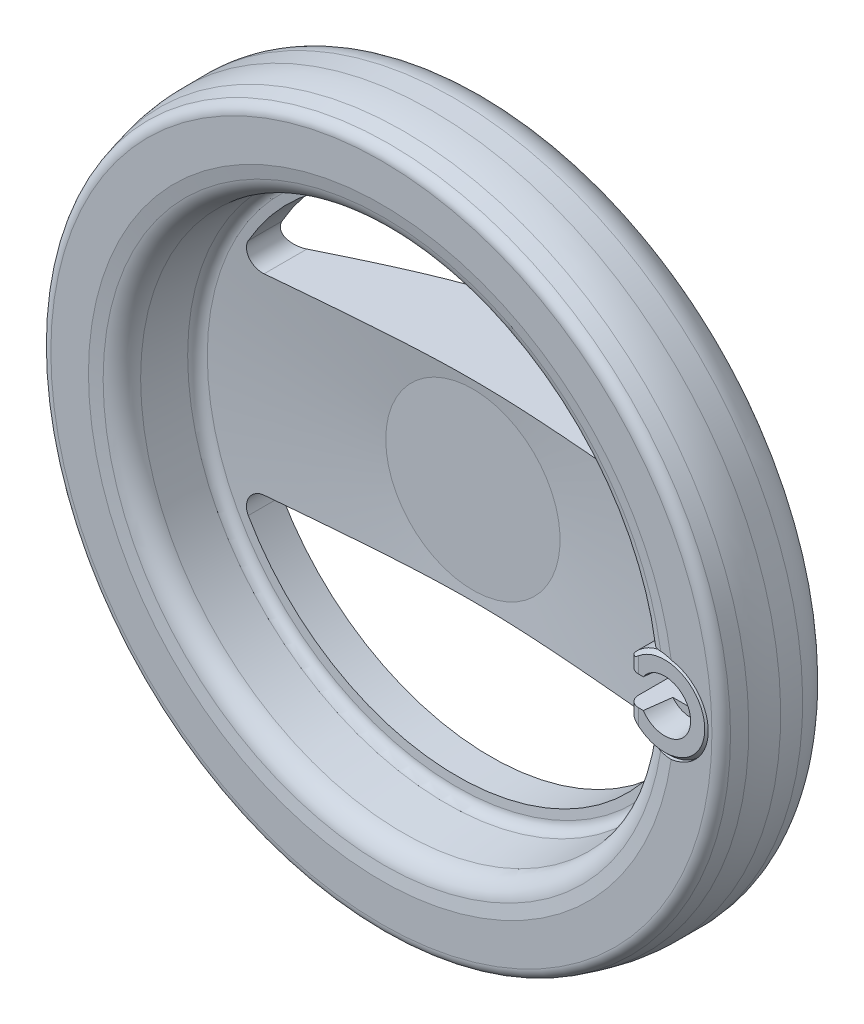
ISO-10303-21;
HEADER;
FILE_DESCRIPTION(('STEP AP214'),'2;1');
FILE_NAME('part.step','',(''),(''),'','','');
FILE_SCHEMA(('AUTOMOTIVE_DESIGN { 1 0 10303 214 1 1 1 1 }'));
ENDSEC;
DATA;
#1=APPLICATION_CONTEXT('core data for automotive mechanical design processes');
#2=APPLICATION_PROTOCOL_DEFINITION('international standard','automotive_design',2000,#1);
#3=PRODUCT_CONTEXT('',#1,'mechanical');
#4=PRODUCT('Part','Part','',(#3));
#5=PRODUCT_RELATED_PRODUCT_CATEGORY('part','',(#4));
#6=PRODUCT_DEFINITION_FORMATION('','',#4);
#7=PRODUCT_DEFINITION_CONTEXT('part definition',#1,'design');
#8=PRODUCT_DEFINITION('design','',#6,#7);
#9=PRODUCT_DEFINITION_SHAPE('','',#8);
#10=(LENGTH_UNIT() NAMED_UNIT(*) SI_UNIT(.MILLI.,.METRE.));
#11=(NAMED_UNIT(*) PLANE_ANGLE_UNIT() SI_UNIT($,.RADIAN.));
#12=(NAMED_UNIT(*) SI_UNIT($,.STERADIAN.) SOLID_ANGLE_UNIT());
#13=UNCERTAINTY_MEASURE_WITH_UNIT(LENGTH_MEASURE(1.E-05),#10,'distance_accuracy_value','');
#14=(GEOMETRIC_REPRESENTATION_CONTEXT(3) GLOBAL_UNCERTAINTY_ASSIGNED_CONTEXT((#13)) GLOBAL_UNIT_ASSIGNED_CONTEXT((#10,
#11,#12)) REPRESENTATION_CONTEXT('',''));
#15=CARTESIAN_POINT('',(0.,0.,0.));
#16=DIRECTION('',(0.,0.,1.));
#17=DIRECTION('',(1.,0.,0.));
#18=AXIS2_PLACEMENT_3D('',#15,#16,#17);
#19=CARTESIAN_POINT('',(65.,0.,32.5000000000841));
#20=DIRECTION('',(0.,0.,-1.));
#21=DIRECTION('',(0.,1.,0.));
#22=AXIS2_PLACEMENT_3D('',#19,#20,#21);
#23=CONICAL_SURFACE('',#22,2.99999999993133,0.785398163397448);
#24=CARTESIAN_POINT('',(65.,0.,32.4999999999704));
#25=DIRECTION('',(0.,0.,-1.));
#26=DIRECTION('',(0.,1.,0.));
#27=AXIS2_PLACEMENT_3D('',#24,#25,#26);
#28=CIRCLE('',#27,3.00000000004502);
#29=CARTESIAN_POINT('',(65.,3.00000000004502,32.4999999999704));
#30=VERTEX_POINT('',#29);
#31=EDGE_CURVE('E1076',#30,#30,#28,.F.);
#32=ORIENTED_EDGE('',*,*,#31,.F.);
#33=EDGE_LOOP('',(#32));
#34=FACE_BOUND('',#33,.T.);
#35=CARTESIAN_POINT('',(65.,0.,33.0414999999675));
#36=DIRECTION('',(0.,0.,-1.));
#37=DIRECTION('',(-1.,0.,0.));
#38=AXIS2_PLACEMENT_3D('',#35,#36,#37);
#39=CIRCLE('',#38,2.45850000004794);
#40=CARTESIAN_POINT('',(62.5414999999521,0.,33.0414999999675));
#41=VERTEX_POINT('',#40);
#42=EDGE_CURVE('E980',#41,#41,#39,.T.);
#43=ORIENTED_EDGE('',*,*,#42,.F.);
#44=EDGE_LOOP('',(#43));
#45=FACE_BOUND('',#44,.T.);
#46=ADVANCED_FACE('F15',(#34,#45),#23,.F.);
#47=CARTESIAN_POINT('',(65.,0.,35.));
#48=DIRECTION('',(0.,0.,-1.));
#49=DIRECTION('',(0.,1.,0.));
#50=AXIS2_PLACEMENT_3D('',#47,#48,#49);
#51=CYLINDRICAL_SURFACE('',#50,2.4585);
#52=ORIENTED_EDGE('',*,*,#42,.T.);
#53=EDGE_LOOP('',(#52));
#54=FACE_BOUND('',#53,.T.);
#55=CARTESIAN_POINT('',(65.,0.,36.9585000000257));
#56=DIRECTION('',(0.,0.,1.));
#57=DIRECTION('',(-1.,0.,0.));
#58=AXIS2_PLACEMENT_3D('',#55,#56,#57);
#59=CIRCLE('',#58,2.45850000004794);
#60=CARTESIAN_POINT('',(62.5414999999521,0.,36.9585000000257));
#61=VERTEX_POINT('',#60);
#62=EDGE_CURVE('E965',#61,#61,#59,.T.);
#63=ORIENTED_EDGE('',*,*,#62,.T.);
#64=EDGE_LOOP('',(#63));
#65=FACE_BOUND('',#64,.T.);
#66=ADVANCED_FACE('F361',(#54,#65),#51,.F.);
#67=CARTESIAN_POINT('',(65.,0.,41.35));
#68=DIRECTION('',(0.,0.,-1.));
#69=DIRECTION('',(0.,1.,0.));
#70=AXIS2_PLACEMENT_3D('',#67,#68,#69);
#71=CYLINDRICAL_SURFACE('',#70,10.);
#72=CARTESIAN_POINT('',(59.6510434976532,8.44918128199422,46.0063854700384));
#73=CARTESIAN_POINT('',(59.6621302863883,8.45617524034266,46.1433024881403));
#74=CARTESIAN_POINT('',(59.6784730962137,8.46651539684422,46.2795963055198));
#75=CARTESIAN_POINT('',(59.7214282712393,8.49337578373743,46.5498633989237));
#76=CARTESIAN_POINT('',(59.7480348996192,8.50989256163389,46.6838379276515));
#77=CARTESIAN_POINT('',(59.8111564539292,8.54852222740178,46.9479963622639));
#78=CARTESIAN_POINT('',(59.8476296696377,8.57061153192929,47.0781937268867));
#79=CARTESIAN_POINT('',(59.9302344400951,8.61973278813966,47.3345346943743));
#80=CARTESIAN_POINT('',(59.9763671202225,8.64676531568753,47.4606778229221));
#81=CARTESIAN_POINT('',(60.0778682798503,8.70494257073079,47.7078834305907));
#82=CARTESIAN_POINT('',(60.1332167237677,8.73607834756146,47.8289562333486));
#83=CARTESIAN_POINT('',(60.2528799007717,8.80167697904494,48.0656444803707));
#84=CARTESIAN_POINT('',(60.3171977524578,8.83614098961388,48.181258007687));
#85=CARTESIAN_POINT('',(60.5233887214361,8.9433724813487,48.5193416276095));
#86=CARTESIAN_POINT('',(60.6784260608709,9.01993554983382,48.7328766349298));
#87=CARTESIAN_POINT('',(60.9397924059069,9.13918088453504,49.0370106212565));
#88=CARTESIAN_POINT('',(61.0346889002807,9.18084384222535,49.138157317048));
#89=CARTESIAN_POINT('',(61.2330490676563,9.26399619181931,49.3317514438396));
#90=CARTESIAN_POINT('',(61.3365096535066,9.30548564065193,49.4242019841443));
#91=CARTESIAN_POINT('',(61.5513093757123,9.38721030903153,49.5995650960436));
#92=CARTESIAN_POINT('',(61.6626330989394,9.42744777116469,49.6824955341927));
#93=CARTESIAN_POINT('',(61.8927274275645,9.50576701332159,49.8383370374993));
#94=CARTESIAN_POINT('',(62.0114934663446,9.54385008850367,49.9112541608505));
#95=CARTESIAN_POINT('',(62.2074358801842,9.60247492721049,50.019691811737));
#96=CARTESIAN_POINT('',(62.2824703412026,9.62399413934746,50.0585918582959));
#97=CARTESIAN_POINT('',(62.4347612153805,9.66570149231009,50.1323455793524));
#98=CARTESIAN_POINT('',(62.5120152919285,9.68589096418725,50.1672033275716));
#99=CARTESIAN_POINT('',(62.590334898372,9.7053343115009,50.2));
#100=B_SPLINE_CURVE_WITH_KNOTS('',3,(#72,#73,#74,#75,#76,#77,#78,#79,#80,#81,#82,#83,#84,#85,
#86,#87,#88,#89,#90,#91,#92,#93,#94,#95,#96,#97,#98,#99),.UNSPECIFIED.,.F.,.F.,(4,2,2,2,2,2,2,2,
2,2,2,2,2,4),(0.,0.412450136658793,0.824670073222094,1.23517390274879,1.6457255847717,
2.05539608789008,2.46520938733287,3.28542214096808,3.7194790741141,4.15338021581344,
4.58645325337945,5.01926311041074,5.28078750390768,5.54204600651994),.UNSPECIFIED.);
#101=CARTESIAN_POINT('',(59.6510434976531,8.44918128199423,46.0063854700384));
#102=VERTEX_POINT('',#101);
#103=CARTESIAN_POINT('',(62.590334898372,9.70533431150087,50.2));
#104=VERTEX_POINT('',#103);
#105=EDGE_CURVE('E38',#102,#104,#100,.T.);
#106=ORIENTED_EDGE('',*,*,#105,.F.);
#107=CARTESIAN_POINT('',(59.6510680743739,8.44919684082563,46.0066885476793));
#108=CARTESIAN_POINT('',(59.5839767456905,8.40672163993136,45.1793252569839));
#109=CARTESIAN_POINT('',(59.5170098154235,8.36320919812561,44.3520048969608));
#110=CARTESIAN_POINT('',(59.3833260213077,8.27402180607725,42.6974668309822));
#111=CARTESIAN_POINT('',(59.3166091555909,8.22834687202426,41.8702491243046));
#112=CARTESIAN_POINT('',(59.1834257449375,8.13474582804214,40.21592063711));
#113=CARTESIAN_POINT('',(59.1169592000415,8.08681971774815,39.3888098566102));
#114=CARTESIAN_POINT('',(58.9842768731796,7.98860926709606,37.7347019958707));
#115=CARTESIAN_POINT('',(58.9180610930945,7.93832490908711,36.9077049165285));
#116=CARTESIAN_POINT('',(58.8519714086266,7.88680825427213,36.0807741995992));
#117=B_SPLINE_CURVE_WITH_KNOTS('',3,(#107,#108,#109,#110,#111,#112,#113,#114,#115,#116),
.UNSPECIFIED.,.F.,.F.,(4,2,2,2,4),(0.,2.49349493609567,4.98697120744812,7.48044788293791,
9.97394322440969),.UNSPECIFIED.);
#118=CARTESIAN_POINT('',(58.8519956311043,7.88682713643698,36.08107727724));
#119=VERTEX_POINT('',#118);
#120=EDGE_CURVE('E628',#102,#119,#117,.T.);
#121=ORIENTED_EDGE('',*,*,#120,.T.);
#122=CARTESIAN_POINT('',(58.8519956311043,7.88682713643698,36.08107727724));
#123=CARTESIAN_POINT('',(58.8469822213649,7.88291347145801,36.0182194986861));
#124=CARTESIAN_POINT('',(58.8397816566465,7.87729818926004,35.9556486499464));
#125=CARTESIAN_POINT('',(58.8211555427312,7.86269956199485,35.8315536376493));
#126=CARTESIAN_POINT('',(58.8097311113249,7.85371710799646,35.7700292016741));
#127=CARTESIAN_POINT('',(58.7828522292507,7.83245552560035,35.6486848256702));
#128=CARTESIAN_POINT('',(58.76741242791,7.82018837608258,35.5888595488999));
#129=CARTESIAN_POINT('',(58.7327108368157,7.79240530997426,35.4711184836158));
#130=CARTESIAN_POINT('',(58.7134489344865,7.77688929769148,35.413202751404));
#131=CARTESIAN_POINT('',(58.6503220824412,7.72557696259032,35.2429726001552));
#132=CARTESIAN_POINT('',(58.6010772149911,7.68498640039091,35.1340039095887));
#133=CARTESIAN_POINT('',(58.4908601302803,7.59185615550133,34.9278068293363));
#134=CARTESIAN_POINT('',(58.4298822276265,7.53931067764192,34.830584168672));
#135=CARTESIAN_POINT('',(58.2965009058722,7.42100704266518,34.645866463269));
#136=CARTESIAN_POINT('',(58.2237365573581,7.35480242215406,34.5589200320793));
#137=CARTESIAN_POINT('',(58.0720055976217,7.21205437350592,34.4003025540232));
#138=CARTESIAN_POINT('',(57.9930368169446,7.13550732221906,34.3286368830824));
#139=CARTESIAN_POINT('',(57.8562172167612,6.99805378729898,34.2197589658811));
#140=CARTESIAN_POINT('',(57.7991585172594,6.93936779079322,34.1786672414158));
#141=CARTESIAN_POINT('',(57.6843496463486,6.81822882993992,34.1035858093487));
#142=CARTESIAN_POINT('',(57.6265992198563,6.75577443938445,34.0695988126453));
#143=CARTESIAN_POINT('',(57.4532421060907,6.56324143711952,33.9776490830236));
#144=CARTESIAN_POINT('',(57.3376900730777,6.42815252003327,33.9298200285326));
#145=CARTESIAN_POINT('',(57.1598468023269,6.20827790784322,33.8729154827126));
#146=CARTESIAN_POINT('',(57.095882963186,6.12664518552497,33.8560129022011));
#147=CARTESIAN_POINT('',(56.9703858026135,5.96120860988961,33.8291206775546));
#148=CARTESIAN_POINT('',(56.9088400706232,5.87742096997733,33.8190896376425));
#149=CARTESIAN_POINT('',(56.8485086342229,5.79251141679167,33.812030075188));
#150=B_SPLINE_CURVE_WITH_KNOTS('',3,(#122,#123,#124,#125,#126,#127,#128,#129,#130,#131,#132,
#133,#134,#135,#136,#137,#138,#139,#140,#141,#142,#143,#144,#145,#146,#147,#148,#149),
.UNSPECIFIED.,.F.,.F.,(4,2,2,2,2,2,2,2,2,2,2,2,2,4),(0.,0.189465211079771,0.378880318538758,
0.567613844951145,0.756352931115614,1.13330337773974,1.51043694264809,1.90274089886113,
2.29518264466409,2.5695889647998,2.84409979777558,3.39388361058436,3.70889434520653,
4.02199028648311),.UNSPECIFIED.);
#151=CARTESIAN_POINT('',(58.4064837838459,7.5183471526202,34.8));
#152=VERTEX_POINT('',#151);
#153=EDGE_CURVE('E621',#119,#152,#150,.T.);
#154=ORIENTED_EDGE('',*,*,#153,.T.);
#155=CARTESIAN_POINT('',(65.,0.,34.8));
#156=DIRECTION('',(0.,0.,-1.));
#157=DIRECTION('',(0.,1.,0.));
#158=AXIS2_PLACEMENT_3D('',#155,#156,#157);
#159=CIRCLE('',#158,10.);
#160=CARTESIAN_POINT('',(57.8585715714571,7.,34.8));
#161=VERTEX_POINT('',#160);
#162=EDGE_CURVE('E1065',#152,#161,#159,.F.);
#163=ORIENTED_EDGE('',*,*,#162,.T.);
#164=DIRECTION('',(0.,0.,-1.));
#165=VECTOR('',#164,1.);
#166=CARTESIAN_POINT('',(57.8585715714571,7.,41.35));
#167=LINE('',#166,#165);
#168=CARTESIAN_POINT('',(57.8585715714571,7.,34.2229273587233));
#169=VERTEX_POINT('',#168);
#170=EDGE_CURVE('E1069',#161,#169,#167,.T.);
#171=ORIENTED_EDGE('',*,*,#170,.T.);
#172=CARTESIAN_POINT('',(56.8485086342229,5.79251141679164,33.812030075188));
#173=VERTEX_POINT('',#172);
#174=EDGE_CURVE('E693',#169,#173,#150,.T.);
#175=ORIENTED_EDGE('',*,*,#174,.T.);
#176=CARTESIAN_POINT('',(57.4104870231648,6.51147393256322,33.8772744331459));
#177=CARTESIAN_POINT('',(57.2427692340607,6.31595730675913,33.8578943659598));
#178=CARTESIAN_POINT('',(57.0830197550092,6.11453484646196,33.8393629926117));
#179=CARTESIAN_POINT('',(56.7794574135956,5.69987825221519,33.8039976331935));
#180=CARTESIAN_POINT('',(56.6356445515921,5.48664411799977,33.7871636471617));
#181=CARTESIAN_POINT('',(56.4998,5.26750414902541,33.7711783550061));
#182=B_SPLINE_CURVE_WITH_KNOTS('',3,(#176,#177,#178,#179,#180,#181),.UNSPECIFIED.,.F.,.F.,(4,2,
4),(0.,0.773245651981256,1.54649132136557),.UNSPECIFIED.);
#183=CARTESIAN_POINT('',(56.5,5.26782687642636,33.7712018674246));
#184=VERTEX_POINT('',#183);
#185=EDGE_CURVE('E687',#173,#184,#182,.T.);
#186=ORIENTED_EDGE('',*,*,#185,.T.);
#187=DIRECTION('',(0.,0.,-1.));
#188=VECTOR('',#187,1.);
#189=CARTESIAN_POINT('',(56.5,5.26782687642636,41.35));
#190=LINE('',#189,#188);
#191=CARTESIAN_POINT('',(56.5,5.26782687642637,48.5));
#192=VERTEX_POINT('',#191);
#193=EDGE_CURVE('E1071',#184,#192,#190,.F.);
#194=ORIENTED_EDGE('',*,*,#193,.T.);
#195=CARTESIAN_POINT('',(56.5,5.26782687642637,48.5));
#196=CARTESIAN_POINT('',(56.4999939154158,5.26781361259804,48.5407404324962));
#197=CARTESIAN_POINT('',(56.5009964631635,5.26943497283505,48.5814575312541));
#198=CARTESIAN_POINT('',(56.5049584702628,5.27582141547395,48.6624971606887));
#199=CARTESIAN_POINT('',(56.507915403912,5.2805824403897,48.7028201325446));
#200=CARTESIAN_POINT('',(56.5194939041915,5.29917282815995,48.8214260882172));
#201=CARTESIAN_POINT('',(56.5308282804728,5.31731957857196,48.8987996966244));
#202=CARTESIAN_POINT('',(56.5639824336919,5.36980465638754,49.0705293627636));
#203=CARTESIAN_POINT('',(56.5878612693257,5.40727104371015,49.1634983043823));
#204=CARTESIAN_POINT('',(56.6442661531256,5.49403389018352,49.3422883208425));
#205=CARTESIAN_POINT('',(56.6769031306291,5.54348125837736,49.4279977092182));
#206=CARTESIAN_POINT('',(56.7433302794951,5.64184106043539,49.5784748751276));
#207=CARTESIAN_POINT('',(56.776150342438,5.68963890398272,49.6444257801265));
#208=CARTESIAN_POINT('',(56.8459739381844,5.78926291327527,49.770983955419));
#209=CARTESIAN_POINT('',(56.8829833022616,5.84109466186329,49.8315835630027));
#210=CARTESIAN_POINT('',(56.9594989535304,5.94595859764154,49.9460143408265));
#211=CARTESIAN_POINT('',(56.9988982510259,5.99890924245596,49.9999932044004));
#212=CARTESIAN_POINT('',(57.0807188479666,6.10651962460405,50.1033273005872));
#213=CARTESIAN_POINT('',(57.1231297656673,6.16117315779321,50.152697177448));
#214=CARTESIAN_POINT('',(57.1669697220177,6.21640061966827,50.2));
#215=B_SPLINE_CURVE_WITH_KNOTS('',3,(#195,#196,#197,#198,#199,#200,#201,#202,#203,#204,#205,
#206,#207,#208,#209,#210,#211,#212,#213,#214),.UNSPECIFIED.,.F.,.F.,(4,2,2,2,2,2,2,2,2,4),(0.,
0.122134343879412,0.244111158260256,0.483768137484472,0.791215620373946,1.10275773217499,
1.36581050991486,1.62923405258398,1.88482351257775,2.1395710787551),.UNSPECIFIED.);
#216=CARTESIAN_POINT('',(57.1669697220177,6.21640061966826,50.2));
#217=VERTEX_POINT('',#216);
#218=EDGE_CURVE('E642',#192,#217,#215,.T.);
#219=ORIENTED_EDGE('',*,*,#218,.T.);
#220=CARTESIAN_POINT('',(65.,0.,50.2));
#221=DIRECTION('',(0.,0.,-1.));
#222=DIRECTION('',(0.,1.,0.));
#223=AXIS2_PLACEMENT_3D('',#220,#221,#222);
#224=CIRCLE('',#223,10.);
#225=EDGE_CURVE('E1093',#217,#104,#224,.T.);
#226=ORIENTED_EDGE('',*,*,#225,.T.);
#227=EDGE_LOOP('',(#106,#121,#154,#163,#171,#175,#186,#194,#219,#226));
#228=FACE_BOUND('',#227,.T.);
#229=ADVANCED_FACE('F408',(#228),#71,.T.);
#230=CARTESIAN_POINT('',(45.,7.,34.8));
#231=DIRECTION('',(0.,0.,1.));
#232=DIRECTION('',(0.,-1.,0.));
#233=AXIS2_PLACEMENT_3D('',#230,#231,#232);
#234=PLANE('',#233);
#235=DIRECTION('',(1.,0.,0.));
#236=VECTOR('',#235,1.);
#237=CARTESIAN_POINT('',(45.,7.,34.8));
#238=LINE('',#237,#236);
#239=CARTESIAN_POINT('',(72.1414284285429,7.,34.8));
#240=VERTEX_POINT('',#239);
#241=EDGE_CURVE('E1003',#240,#161,#238,.F.);
#242=ORIENTED_EDGE('',*,*,#241,.T.);
#243=ORIENTED_EDGE('',*,*,#162,.F.);
#244=EDGE_CURVE('E1801',#240,#152,#159,.F.);
#245=ORIENTED_EDGE('',*,*,#244,.F.);
#246=EDGE_LOOP('',(#242,#243,#245));
#247=FACE_BOUND('',#246,.T.);
#248=ADVANCED_FACE('F266',(#247),#234,.F.);
#249=CARTESIAN_POINT('',(45.,7.,32.5));
#250=DIRECTION('',(0.,-1.,0.));
#251=DIRECTION('',(1.,0.,0.));
#252=AXIS2_PLACEMENT_3D('',#249,#250,#251);
#253=PLANE('',#252);
#254=DIRECTION('',(1.,0.,0.));
#255=VECTOR('',#254,1.);
#256=CARTESIAN_POINT('',(60.,7.,32.5));
#257=LINE('',#256,#255);
#258=CARTESIAN_POINT('',(57.8585715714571,7.,32.5));
#259=VERTEX_POINT('',#258);
#260=CARTESIAN_POINT('',(72.1414284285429,7.,32.5));
#261=VERTEX_POINT('',#260);
#262=EDGE_CURVE('E1073',#259,#261,#257,.T.);
#263=ORIENTED_EDGE('',*,*,#262,.F.);
#264=EDGE_CURVE('E1072',#169,#259,#167,.T.);
#265=ORIENTED_EDGE('',*,*,#264,.F.);
#266=ORIENTED_EDGE('',*,*,#170,.F.);
#267=ORIENTED_EDGE('',*,*,#241,.F.);
#268=DIRECTION('',(0.,0.,-1.));
#269=VECTOR('',#268,1.);
#270=CARTESIAN_POINT('',(72.1414284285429,7.,41.35));
#271=LINE('',#270,#269);
#272=EDGE_CURVE('E1061',#261,#240,#271,.F.);
#273=ORIENTED_EDGE('',*,*,#272,.F.);
#274=EDGE_LOOP('',(#263,#265,#266,#267,#273));
#275=FACE_BOUND('',#274,.T.);
#276=ADVANCED_FACE('F1631',(#275),#253,.F.);
#277=CARTESIAN_POINT('',(62.590334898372,-9.70533431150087,50.2));
#278=CARTESIAN_POINT('',(62.4633994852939,-9.67383542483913,50.1468604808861));
#279=CARTESIAN_POINT('',(62.339272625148,-9.64035674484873,50.0882856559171));
#280=CARTESIAN_POINT('',(62.0973996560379,-9.57030135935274,49.9608842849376));
#281=CARTESIAN_POINT('',(61.979650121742,-9.53372634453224,49.8920633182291));
#282=CARTESIAN_POINT('',(61.7514772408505,-9.45840981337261,49.7449366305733));
#283=CARTESIAN_POINT('',(61.6410342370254,-9.4196746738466,49.6666581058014));
#284=CARTESIAN_POINT('',(61.4276663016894,-9.34084471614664,49.5010931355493));
#285=CARTESIAN_POINT('',(61.3247423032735,-9.3007497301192,49.4138055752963));
#286=CARTESIAN_POINT('',(61.0283451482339,-9.17994150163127,49.1396807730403));
#287=CARTESIAN_POINT('',(60.8466393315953,-9.09849662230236,48.940186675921));
#288=CARTESIAN_POINT('',(60.5178617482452,-8.94113083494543,48.5120695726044));
#289=CARTESIAN_POINT('',(60.3708371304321,-8.86521754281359,48.2834075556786));
#290=CARTESIAN_POINT('',(60.176106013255,-8.75989579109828,47.9179730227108));
#291=CARTESIAN_POINT('',(60.1145979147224,-8.72565330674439,47.789766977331));
#292=CARTESIAN_POINT('',(60.0021571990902,-8.66174070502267,47.5277225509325));
#293=CARTESIAN_POINT('',(59.9512201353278,-8.63206866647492,47.3938865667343));
#294=CARTESIAN_POINT('',(59.8604048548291,-8.5783065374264,47.1217726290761));
#295=CARTESIAN_POINT('',(59.8205024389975,-8.55420425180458,46.9835051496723));
#296=CARTESIAN_POINT('',(59.7519849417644,-8.5123414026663,46.703330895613));
#297=CARTESIAN_POINT('',(59.7233618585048,-8.4945763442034,46.5614267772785));
#298=CARTESIAN_POINT('',(59.6896329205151,-8.47349754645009,46.3500890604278));
#299=CARTESIAN_POINT('',(59.6800597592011,-8.46748693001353,46.2816032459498));
#300=CARTESIAN_POINT('',(59.6635647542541,-8.45710055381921,46.1442603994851));
#301=CARTESIAN_POINT('',(59.6566402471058,-8.452723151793,46.0754038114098));
#302=CARTESIAN_POINT('',(59.6510434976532,-8.44918128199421,46.0063854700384));
#303=B_SPLINE_CURVE_WITH_KNOTS('',3,(#277,#278,#279,#280,#281,#282,#283,#284,#285,#286,#287,
#288,#289,#290,#291,#292,#293,#294,#295,#296,#297,#298,#299,#300,#301,#302),.UNSPECIFIED.,.F.,
.F.,(4,2,2,2,2,2,2,2,2,2,2,2,4),(0.,0.423304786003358,0.846379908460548,1.26826616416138,
1.69020468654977,2.53184801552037,3.3746290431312,3.81294318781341,4.25107258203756,
4.68823339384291,5.1250835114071,5.33326005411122,5.54122669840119),.UNSPECIFIED.);
#304=CARTESIAN_POINT('',(62.590334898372,-9.70533431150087,50.2));
#305=VERTEX_POINT('',#304);
#306=CARTESIAN_POINT('',(59.6510434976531,-8.44918128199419,46.0063854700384));
#307=VERTEX_POINT('',#306);
#308=EDGE_CURVE('E612',#305,#307,#303,.T.);
#309=ORIENTED_EDGE('',*,*,#308,.F.);
#310=CARTESIAN_POINT('',(57.1669697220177,-6.21640061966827,50.2));
#311=VERTEX_POINT('',#310);
#312=EDGE_CURVE('E1099',#305,#311,#224,.T.);
#313=ORIENTED_EDGE('',*,*,#312,.T.);
#314=CARTESIAN_POINT('',(57.1669697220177,-6.21640061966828,50.2));
#315=CARTESIAN_POINT('',(57.1240214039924,-6.16229561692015,50.1536615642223));
#316=CARTESIAN_POINT('',(57.0824455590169,-6.10874371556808,50.1053373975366));
#317=CARTESIAN_POINT('',(57.0021762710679,-6.0032642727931,50.0042950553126));
#318=CARTESIAN_POINT('',(56.9634920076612,-5.95134218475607,49.9515639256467));
#319=CARTESIAN_POINT('',(56.8884407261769,-5.84865470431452,49.8401274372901));
#320=CARTESIAN_POINT('',(56.8521606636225,-5.79795498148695,49.7813019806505));
#321=CARTESIAN_POINT('',(56.7835511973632,-5.70030896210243,49.6585728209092));
#322=CARTESIAN_POINT('',(56.7512166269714,-5.653357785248,49.5946759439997));
#323=CARTESIAN_POINT('',(56.687913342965,-5.55992068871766,49.4543542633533));
#324=CARTESIAN_POINT('',(56.657444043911,-5.51400063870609,49.3773184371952));
#325=CARTESIAN_POINT('',(56.6035650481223,-5.43160046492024,49.2170361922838));
#326=CARTESIAN_POINT('',(56.5800801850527,-5.39502047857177,49.1338688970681));
#327=CARTESIAN_POINT('',(56.5510990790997,-5.34942970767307,49.0047938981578));
#328=CARTESIAN_POINT('',(56.5424963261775,-5.33580649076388,48.9611857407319));
#329=CARTESIAN_POINT('',(56.5275252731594,-5.31200226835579,48.8726685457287));
#330=CARTESIAN_POINT('',(56.5211560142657,-5.30181978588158,48.8277600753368));
#331=CARTESIAN_POINT('',(56.5107332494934,-5.28511642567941,48.7360451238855));
#332=CARTESIAN_POINT('',(56.5067290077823,-5.27867348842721,48.6892186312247));
#333=CARTESIAN_POINT('',(56.5013519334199,-5.2700082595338,48.5949366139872));
#334=CARTESIAN_POINT('',(56.4999843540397,-5.26779439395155,48.5474800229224));
#335=CARTESIAN_POINT('',(56.5,-5.26782687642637,48.5));
#336=B_SPLINE_CURVE_WITH_KNOTS('',3,(#314,#315,#316,#317,#318,#319,#320,#321,#322,#323,#324,
#325,#326,#327,#328,#329,#330,#331,#332,#333,#334,#335),.UNSPECIFIED.,.F.,.F.,(4,2,2,2,2,2,2,2,
2,2,4),(0.,0.249563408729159,0.499888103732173,0.756753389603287,1.01327861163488,
1.29672359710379,1.57699751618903,1.71629941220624,1.85554143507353,1.99759003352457,
2.13992135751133),.UNSPECIFIED.);
#337=CARTESIAN_POINT('',(56.5,-5.26782687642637,48.5));
#338=VERTEX_POINT('',#337);
#339=EDGE_CURVE('E653',#311,#338,#336,.T.);
#340=ORIENTED_EDGE('',*,*,#339,.T.);
#341=DIRECTION('',(0.,0.,1.));
#342=VECTOR('',#341,1.);
#343=CARTESIAN_POINT('',(56.5,-5.26782687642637,48.5));
#344=LINE('',#343,#342);
#345=CARTESIAN_POINT('',(56.5,-5.26782687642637,33.7712018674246));
#346=VERTEX_POINT('',#345);
#347=EDGE_CURVE('E1010',#338,#346,#344,.F.);
#348=ORIENTED_EDGE('',*,*,#347,.T.);
#349=CARTESIAN_POINT('',(56.4998,-5.26750414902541,33.7711783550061));
#350=CARTESIAN_POINT('',(56.6356445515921,-5.48664411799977,33.7871636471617));
#351=CARTESIAN_POINT('',(56.7794574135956,-5.6998782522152,33.8039976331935));
#352=CARTESIAN_POINT('',(57.0830197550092,-6.11453484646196,33.8393629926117));
#353=CARTESIAN_POINT('',(57.2427692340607,-6.31595730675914,33.8578943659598));
#354=CARTESIAN_POINT('',(57.4104870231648,-6.51147393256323,33.8772744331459));
#355=B_SPLINE_CURVE_WITH_KNOTS('',3,(#349,#350,#351,#352,#353,#354),.UNSPECIFIED.,.F.,.F.,(4,2,
4),(0.,0.773245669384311,1.54649132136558),.UNSPECIFIED.);
#356=CARTESIAN_POINT('',(56.8485086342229,-5.79251141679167,33.812030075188));
#357=VERTEX_POINT('',#356);
#358=EDGE_CURVE('E672',#346,#357,#355,.T.);
#359=ORIENTED_EDGE('',*,*,#358,.T.);
#360=CARTESIAN_POINT('',(56.8485086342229,-5.79251141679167,33.812030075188));
#361=CARTESIAN_POINT('',(56.9092740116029,-5.8780459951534,33.8191314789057));
#362=CARTESIAN_POINT('',(56.971318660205,-5.96248483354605,33.829269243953));
#363=CARTESIAN_POINT('',(57.0975904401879,-6.12884853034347,33.8564316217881));
#364=CARTESIAN_POINT('',(57.1618218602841,-6.21076776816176,33.8734705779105));
#365=CARTESIAN_POINT('',(57.2924427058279,-6.37216157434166,33.9154222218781));
#366=CARTESIAN_POINT('',(57.3588467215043,-6.45160600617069,33.9404072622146));
#367=CARTESIAN_POINT('',(57.4923647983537,-6.60650287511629,33.9989375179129));
#368=CARTESIAN_POINT('',(57.5594781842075,-6.68195875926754,34.0324751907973));
#369=CARTESIAN_POINT('',(57.7248098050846,-6.86240821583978,34.1267096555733));
#370=CARTESIAN_POINT('',(57.8229619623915,-6.96479769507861,34.1927813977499));
#371=CARTESIAN_POINT('',(57.9665047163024,-7.10876784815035,34.3078054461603));
#372=CARTESIAN_POINT('',(58.0136842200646,-7.15510622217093,34.3487415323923));
#373=CARTESIAN_POINT('',(58.1062692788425,-7.24434894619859,34.4359882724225));
#374=CARTESIAN_POINT('',(58.1516756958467,-7.28725497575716,34.4822962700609));
#375=CARTESIAN_POINT('',(58.2405217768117,-7.36974713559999,34.5807602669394));
#376=CARTESIAN_POINT('',(58.283936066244,-7.40929408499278,34.6329720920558));
#377=CARTESIAN_POINT('',(58.3675500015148,-7.48423389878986,34.7426416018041));
#378=CARTESIAN_POINT('',(58.40775131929,-7.51962892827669,34.8000965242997));
#379=CARTESIAN_POINT('',(58.4842633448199,-7.58602300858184,34.9199941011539));
#380=CARTESIAN_POINT('',(58.5205717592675,-7.61701947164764,34.9824396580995));
#381=CARTESIAN_POINT('',(58.5885526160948,-7.67432859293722,35.1117951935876));
#382=CARTESIAN_POINT('',(58.6202279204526,-7.70064414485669,35.1787023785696));
#383=CARTESIAN_POINT('',(58.6763160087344,-7.74675726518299,35.3116522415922));
#384=CARTESIAN_POINT('',(58.7010796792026,-7.76687986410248,35.3774343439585));
#385=CARTESIAN_POINT('',(58.7456108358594,-7.80278361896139,35.5118102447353));
#386=CARTESIAN_POINT('',(58.7653789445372,-7.8185653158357,35.5804036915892));
#387=CARTESIAN_POINT('',(58.7996465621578,-7.84577027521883,35.7201688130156));
#388=CARTESIAN_POINT('',(58.8141155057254,-7.85716827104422,35.7913529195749));
#389=CARTESIAN_POINT('',(58.8373800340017,-7.87542330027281,35.9352532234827));
#390=CARTESIAN_POINT('',(58.8461725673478,-7.88227789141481,36.0079702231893));
#391=CARTESIAN_POINT('',(58.8519956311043,-7.88682713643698,36.08107727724));
#392=B_SPLINE_CURVE_WITH_KNOTS('',3,(#360,#361,#362,#363,#364,#365,#366,#367,#368,#369,#370,
#371,#372,#373,#374,#375,#376,#377,#378,#379,#380,#381,#382,#383,#384,#385,#386,#387,#388,#389,
#390,#391),.UNSPECIFIED.,.F.,.F.,(4,2,2,2,2,2,2,2,2,2,2,2,2,2,2,4),(0.,0.31550603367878,
0.631671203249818,0.950801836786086,1.26965199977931,1.73695301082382,1.97005070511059,
2.2030336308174,2.43844031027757,2.67372368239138,2.9091449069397,3.14442008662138,
3.36341408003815,3.58238077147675,3.80259127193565,4.02292004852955),.UNSPECIFIED.);
#393=CARTESIAN_POINT('',(57.8585715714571,-7.,34.2229273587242));
#394=VERTEX_POINT('',#393);
#395=EDGE_CURVE('E680',#357,#394,#392,.T.);
#396=ORIENTED_EDGE('',*,*,#395,.T.);
#397=DIRECTION('',(0.,0.,-1.));
#398=VECTOR('',#397,1.);
#399=CARTESIAN_POINT('',(57.8585715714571,-7.,41.35));
#400=LINE('',#399,#398);
#401=CARTESIAN_POINT('',(57.8585715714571,-7.,34.8));
#402=VERTEX_POINT('',#401);
#403=EDGE_CURVE('E1009',#394,#402,#400,.F.);
#404=ORIENTED_EDGE('',*,*,#403,.T.);
#405=CARTESIAN_POINT('',(65.,0.,34.8));
#406=DIRECTION('',(0.,0.,-1.));
#407=DIRECTION('',(0.,1.,0.));
#408=AXIS2_PLACEMENT_3D('',#405,#406,#407);
#409=CIRCLE('',#408,10.);
#410=CARTESIAN_POINT('',(58.4064837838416,-7.5183471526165,34.8));
#411=VERTEX_POINT('',#410);
#412=EDGE_CURVE('E1004',#402,#411,#409,.F.);
#413=ORIENTED_EDGE('',*,*,#412,.T.);
#414=CARTESIAN_POINT('',(58.8519956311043,-7.88682713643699,36.08107727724));
#415=VERTEX_POINT('',#414);
#416=EDGE_CURVE('E700',#411,#415,#392,.T.);
#417=ORIENTED_EDGE('',*,*,#416,.T.);
#418=CARTESIAN_POINT('',(58.8519714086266,-7.88680825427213,36.0807741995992));
#419=CARTESIAN_POINT('',(58.9180610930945,-7.93832490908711,36.9077049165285));
#420=CARTESIAN_POINT('',(58.9842768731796,-7.98860926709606,37.7347019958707));
#421=CARTESIAN_POINT('',(59.1169592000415,-8.08681971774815,39.3888098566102));
#422=CARTESIAN_POINT('',(59.1834257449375,-8.13474582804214,40.21592063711));
#423=CARTESIAN_POINT('',(59.3166091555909,-8.22834687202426,41.8702491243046));
#424=CARTESIAN_POINT('',(59.3833260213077,-8.27402180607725,42.6974668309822));
#425=CARTESIAN_POINT('',(59.5170098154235,-8.36320919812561,44.3520048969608));
#426=CARTESIAN_POINT('',(59.5839767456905,-8.40672163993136,45.1793252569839));
#427=CARTESIAN_POINT('',(59.6510680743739,-8.44919684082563,46.0066885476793));
#428=B_SPLINE_CURVE_WITH_KNOTS('',3,(#418,#419,#420,#421,#422,#423,#424,#425,#426,#427),
.UNSPECIFIED.,.F.,.F.,(4,2,2,2,4),(0.,2.49349534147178,4.98697201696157,7.48044828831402,
9.97394322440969),.UNSPECIFIED.);
#429=EDGE_CURVE('E622',#415,#307,#428,.T.);
#430=ORIENTED_EDGE('',*,*,#429,.T.);
#431=EDGE_LOOP('',(#309,#313,#340,#348,#359,#396,#404,#413,#417,#430));
#432=FACE_BOUND('',#431,.T.);
#433=ADVANCED_FACE('F636',(#432),#71,.T.);
#434=CARTESIAN_POINT('',(65.,0.,50.2));
#435=DIRECTION('',(0.,0.,-1.));
#436=DIRECTION('',(0.,1.,0.));
#437=AXIS2_PLACEMENT_3D('',#434,#435,#436);
#438=CONICAL_SURFACE('',#437,10.,0.785398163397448);
#439=CARTESIAN_POINT('',(57.1669697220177,6.21640061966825,50.2));
#440=CARTESIAN_POINT('',(57.1885919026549,6.20613655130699,50.2233161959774));
#441=CARTESIAN_POINT('',(57.2109019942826,6.19698663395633,50.2464764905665));
#442=CARTESIAN_POINT('',(57.2568313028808,6.18105975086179,50.2923216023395));
#443=CARTESIAN_POINT('',(57.2804508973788,6.17428347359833,50.3150062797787));
#444=CARTESIAN_POINT('',(57.3528288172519,6.15781430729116,50.3817806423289));
#445=CARTESIAN_POINT('',(57.4033989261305,6.15183941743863,50.4249085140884));
#446=CARTESIAN_POINT('',(57.5080271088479,6.15009251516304,50.5071025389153));
#447=CARTESIAN_POINT('',(57.5620927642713,6.15434345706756,50.5461593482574));
#448=CARTESIAN_POINT('',(57.6720402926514,6.17211895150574,50.6191713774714));
#449=CARTESIAN_POINT('',(57.7279223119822,6.18564425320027,50.6531261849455));
#450=CARTESIAN_POINT('',(57.863056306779,6.22744967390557,50.7283456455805));
#451=CARTESIAN_POINT('',(57.9425888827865,6.25949014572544,50.7669845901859));
#452=CARTESIAN_POINT('',(58.1012077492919,6.33456272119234,50.8344575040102));
#453=CARTESIAN_POINT('',(58.1802857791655,6.37767824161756,50.8632130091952));
#454=CARTESIAN_POINT('',(58.3237433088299,6.46363541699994,50.9077675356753));
#455=CARTESIAN_POINT('',(58.388398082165,6.50535201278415,50.9249206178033));
#456=CARTESIAN_POINT('',(58.5163974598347,6.59268899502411,50.9536577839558));
#457=CARTESIAN_POINT('',(58.5797401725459,6.63831458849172,50.9652342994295));
#458=CARTESIAN_POINT('',(58.7034450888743,6.73127677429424,50.983116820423));
#459=CARTESIAN_POINT('',(58.7638423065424,6.77854450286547,50.9895444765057));
#460=CARTESIAN_POINT('',(58.8830553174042,6.87504174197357,50.9979718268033));
#461=CARTESIAN_POINT('',(58.9418755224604,6.92426454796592,50.9999855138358));
#462=CARTESIAN_POINT('',(59.,6.97423830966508,51.));
#463=B_SPLINE_CURVE_WITH_KNOTS('',3,(#439,#440,#441,#442,#443,#444,#445,#446,#447,#448,#449,
#450,#451,#452,#453,#454,#455,#456,#457,#458,#459,#460,#461,#462),.UNSPECIFIED.,.F.,.F.,(4,2,2,
2,2,2,2,2,2,2,2,4),(0.,0.100199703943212,0.200428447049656,0.399539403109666,0.59909772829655,
0.798672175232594,1.07923967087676,1.36198573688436,1.59815115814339,1.83463620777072,
2.06535392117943,2.29533916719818),.UNSPECIFIED.);
#464=CARTESIAN_POINT('',(59.,6.97423830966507,51.));
#465=VERTEX_POINT('',#464);
#466=EDGE_CURVE('E1087',#217,#465,#463,.T.);
#467=ORIENTED_EDGE('',*,*,#466,.T.);
#468=CARTESIAN_POINT('',(65.,0.,51.));
#469=DIRECTION('',(0.,0.,-1.));
#470=DIRECTION('',(0.,1.,0.));
#471=AXIS2_PLACEMENT_3D('',#468,#469,#470);
#472=CIRCLE('',#471,9.2);
#473=CARTESIAN_POINT('',(59.,-6.97423830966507,51.));
#474=VERTEX_POINT('',#473);
#475=EDGE_CURVE('E1062',#465,#474,#472,.T.);
#476=ORIENTED_EDGE('',*,*,#475,.T.);
#477=CARTESIAN_POINT('',(57.1669697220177,-6.21640061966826,50.2));
#478=CARTESIAN_POINT('',(57.1885919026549,-6.206136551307,50.2233161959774));
#479=CARTESIAN_POINT('',(57.2109019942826,-6.19698663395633,50.2464764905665));
#480=CARTESIAN_POINT('',(57.2568313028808,-6.18105975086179,50.2923216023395));
#481=CARTESIAN_POINT('',(57.2804508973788,-6.17428347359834,50.3150062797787));
#482=CARTESIAN_POINT('',(57.3528288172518,-6.15781430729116,50.3817806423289));
#483=CARTESIAN_POINT('',(57.4033989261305,-6.15183941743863,50.4249085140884));
#484=CARTESIAN_POINT('',(57.5080271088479,-6.15009251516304,50.5071025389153));
#485=CARTESIAN_POINT('',(57.5620927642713,-6.15434345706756,50.5461593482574));
#486=CARTESIAN_POINT('',(57.6720402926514,-6.17211895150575,50.6191713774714));
#487=CARTESIAN_POINT('',(57.7279223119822,-6.18564425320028,50.6531261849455));
#488=CARTESIAN_POINT('',(57.863056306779,-6.22744967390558,50.7283456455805));
#489=CARTESIAN_POINT('',(57.9425888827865,-6.25949014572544,50.7669845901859));
#490=CARTESIAN_POINT('',(58.1012077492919,-6.33456272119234,50.8344575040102));
#491=CARTESIAN_POINT('',(58.1802857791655,-6.37767824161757,50.8632130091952));
#492=CARTESIAN_POINT('',(58.3237433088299,-6.46363541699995,50.9077675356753));
#493=CARTESIAN_POINT('',(58.388398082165,-6.50535201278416,50.9249206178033));
#494=CARTESIAN_POINT('',(58.5163974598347,-6.59268899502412,50.9536577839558));
#495=CARTESIAN_POINT('',(58.5797401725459,-6.63831458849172,50.9652342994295));
#496=CARTESIAN_POINT('',(58.7034450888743,-6.73127677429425,50.983116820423));
#497=CARTESIAN_POINT('',(58.7638423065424,-6.77854450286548,50.9895444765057));
#498=CARTESIAN_POINT('',(58.8830553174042,-6.87504174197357,50.9979718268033));
#499=CARTESIAN_POINT('',(58.9418755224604,-6.92426454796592,50.9999855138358));
#500=CARTESIAN_POINT('',(59.,-6.97423830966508,51.));
#501=B_SPLINE_CURVE_WITH_KNOTS('',3,(#477,#478,#479,#480,#481,#482,#483,#484,#485,#486,#487,
#488,#489,#490,#491,#492,#493,#494,#495,#496,#497,#498,#499,#500),.UNSPECIFIED.,.F.,.F.,(4,2,2,
2,2,2,2,2,2,2,2,4),(0.,0.100199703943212,0.200428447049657,0.399539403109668,0.599097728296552,
0.798672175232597,1.07923967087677,1.36198573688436,1.59815115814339,1.83463620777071,
2.06535392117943,2.29533916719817),.UNSPECIFIED.);
#502=EDGE_CURVE('E333',#311,#474,#501,.T.);
#503=ORIENTED_EDGE('',*,*,#502,.F.);
#504=ORIENTED_EDGE('',*,*,#312,.F.);
#505=EDGE_CURVE('E1097',#104,#305,#224,.T.);
#506=ORIENTED_EDGE('',*,*,#505,.F.);
#507=ORIENTED_EDGE('',*,*,#225,.F.);
#508=EDGE_LOOP('',(#467,#476,#503,#504,#506,#507));
#509=FACE_BOUND('',#508,.T.);
#510=ADVANCED_FACE('F1613',(#509),#438,.T.);
#511=CARTESIAN_POINT('',(59.,20.,48.5));
#512=DIRECTION('',(0.,1.,0.));
#513=DIRECTION('',(-1.,0.,0.));
#514=AXIS2_PLACEMENT_3D('',#511,#512,#513);
#515=CYLINDRICAL_SURFACE('',#514,2.5);
#516=ORIENTED_EDGE('',*,*,#502,.T.);
#517=DIRECTION('',(0.,-1.,0.));
#518=VECTOR('',#517,1.);
#519=CARTESIAN_POINT('',(59.,0.,51.));
#520=LINE('',#519,#518);
#521=CARTESIAN_POINT('',(59.,-3.35,51.));
#522=VERTEX_POINT('',#521);
#523=EDGE_CURVE('E1052',#522,#474,#520,.T.);
#524=ORIENTED_EDGE('',*,*,#523,.F.);
#525=CARTESIAN_POINT('',(59.,-3.35,48.5));
#526=DIRECTION('',(0.,1.,0.));
#527=DIRECTION('',(-1.,0.,0.));
#528=AXIS2_PLACEMENT_3D('',#525,#526,#527);
#529=CIRCLE('',#528,2.5);
#530=CARTESIAN_POINT('',(56.5,-3.35,48.5));
#531=VERTEX_POINT('',#530);
#532=EDGE_CURVE('E319',#522,#531,#529,.F.);
#533=ORIENTED_EDGE('',*,*,#532,.T.);
#534=DIRECTION('',(0.,1.,0.));
#535=VECTOR('',#534,1.);
#536=CARTESIAN_POINT('',(56.5,20.,48.5));
#537=LINE('',#536,#535);
#538=EDGE_CURVE('E1037',#531,#338,#537,.F.);
#539=ORIENTED_EDGE('',*,*,#538,.T.);
#540=ORIENTED_EDGE('',*,*,#339,.F.);
#541=EDGE_LOOP('',(#516,#524,#533,#539,#540));
#542=FACE_BOUND('',#541,.T.);
#543=ADVANCED_FACE('F344',(#542),#515,.T.);
#544=CARTESIAN_POINT('',(56.5,20.,48.5));
#545=DIRECTION('',(1.,0.,0.));
#546=DIRECTION('',(0.,1.,0.));
#547=AXIS2_PLACEMENT_3D('',#544,#545,#546);
#548=PLANE('',#547);
#549=DIRECTION('',(0.,1.,0.));
#550=VECTOR('',#549,1.);
#551=CARTESIAN_POINT('',(56.5,20.,37.5));
#552=LINE('',#551,#550);
#553=CARTESIAN_POINT('',(56.5,3.35,37.5));
#554=VERTEX_POINT('',#553);
#555=CARTESIAN_POINT('',(56.5,-3.35,37.5));
#556=VERTEX_POINT('',#555);
#557=EDGE_CURVE('E1023',#554,#556,#552,.F.);
#558=ORIENTED_EDGE('',*,*,#557,.F.);
#559=DIRECTION('',(0.,0.,1.));
#560=VECTOR('',#559,1.);
#561=CARTESIAN_POINT('',(56.5,3.35,48.5));
#562=LINE('',#561,#560);
#563=CARTESIAN_POINT('',(56.5,3.35,48.5));
#564=VERTEX_POINT('',#563);
#565=EDGE_CURVE('E1027',#564,#554,#562,.F.);
#566=ORIENTED_EDGE('',*,*,#565,.F.);
#567=DIRECTION('',(0.,1.,0.));
#568=VECTOR('',#567,1.);
#569=CARTESIAN_POINT('',(56.5,20.,48.5));
#570=LINE('',#569,#568);
#571=EDGE_CURVE('E1084',#192,#564,#570,.F.);
#572=ORIENTED_EDGE('',*,*,#571,.F.);
#573=ORIENTED_EDGE('',*,*,#193,.F.);
#574=CARTESIAN_POINT('',(56.5,5.26782687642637,32.5));
#575=VERTEX_POINT('',#574);
#576=EDGE_CURVE('E1088',#575,#184,#190,.F.);
#577=ORIENTED_EDGE('',*,*,#576,.F.);
#578=DIRECTION('',(0.,1.,0.));
#579=VECTOR('',#578,1.);
#580=CARTESIAN_POINT('',(56.5,20.,32.5));
#581=LINE('',#580,#579);
#582=CARTESIAN_POINT('',(56.5,-5.26782687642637,32.5));
#583=VERTEX_POINT('',#582);
#584=EDGE_CURVE('E1013',#583,#575,#581,.T.);
#585=ORIENTED_EDGE('',*,*,#584,.F.);
#586=EDGE_CURVE('E1014',#346,#583,#344,.F.);
#587=ORIENTED_EDGE('',*,*,#586,.F.);
#588=ORIENTED_EDGE('',*,*,#347,.F.);
#589=ORIENTED_EDGE('',*,*,#538,.F.);
#590=DIRECTION('',(0.,0.,1.));
#591=VECTOR('',#590,1.);
#592=CARTESIAN_POINT('',(56.5,-3.35,48.5));
#593=LINE('',#592,#591);
#594=EDGE_CURVE('E1026',#556,#531,#593,.T.);
#595=ORIENTED_EDGE('',*,*,#594,.F.);
#596=EDGE_LOOP('',(#558,#566,#572,#573,#577,#585,#587,#588,#589,#595));
#597=FACE_BOUND('',#596,.T.);
#598=ADVANCED_FACE('F364',(#597),#548,.F.);
#599=CARTESIAN_POINT('',(45.,-7.,34.8));
#600=DIRECTION('',(0.,1.,0.));
#601=DIRECTION('',(-1.,0.,0.));
#602=AXIS2_PLACEMENT_3D('',#599,#600,#601);
#603=PLANE('',#602);
#604=DIRECTION('',(-1.,0.,0.));
#605=VECTOR('',#604,1.);
#606=CARTESIAN_POINT('',(45.,-7.,34.8));
#607=LINE('',#606,#605);
#608=CARTESIAN_POINT('',(72.1414284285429,-7.,34.8));
#609=VERTEX_POINT('',#608);
#610=EDGE_CURVE('E341',#402,#609,#607,.F.);
#611=ORIENTED_EDGE('',*,*,#610,.F.);
#612=ORIENTED_EDGE('',*,*,#403,.F.);
#613=CARTESIAN_POINT('',(57.8585715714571,-7.,32.5));
#614=VERTEX_POINT('',#613);
#615=EDGE_CURVE('E1005',#614,#394,#400,.F.);
#616=ORIENTED_EDGE('',*,*,#615,.F.);
#617=DIRECTION('',(1.,0.,0.));
#618=VECTOR('',#617,1.);
#619=CARTESIAN_POINT('',(60.,-7.,32.5));
#620=LINE('',#619,#618);
#621=CARTESIAN_POINT('',(72.1414284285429,-7.,32.5));
#622=VERTEX_POINT('',#621);
#623=EDGE_CURVE('E1040',#622,#614,#620,.F.);
#624=ORIENTED_EDGE('',*,*,#623,.F.);
#625=DIRECTION('',(0.,0.,-1.));
#626=VECTOR('',#625,1.);
#627=CARTESIAN_POINT('',(72.1414284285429,-7.,41.35));
#628=LINE('',#627,#626);
#629=EDGE_CURVE('E1000',#609,#622,#628,.T.);
#630=ORIENTED_EDGE('',*,*,#629,.F.);
#631=EDGE_LOOP('',(#611,#612,#616,#624,#630));
#632=FACE_BOUND('',#631,.T.);
#633=ADVANCED_FACE('F352',(#632),#603,.F.);
#634=CARTESIAN_POINT('',(45.,-14.,34.8));
#635=DIRECTION('',(0.,0.,1.));
#636=DIRECTION('',(0.,-1.,0.));
#637=AXIS2_PLACEMENT_3D('',#634,#635,#636);
#638=PLANE('',#637);
#639=ORIENTED_EDGE('',*,*,#610,.T.);
#640=EDGE_CURVE('E1008',#411,#609,#409,.F.);
#641=ORIENTED_EDGE('',*,*,#640,.F.);
#642=ORIENTED_EDGE('',*,*,#412,.F.);
#643=EDGE_LOOP('',(#639,#641,#642));
#644=FACE_BOUND('',#643,.T.);
#645=ADVANCED_FACE('F349',(#644),#638,.F.);
#646=CARTESIAN_POINT('',(59.,20.,48.5));
#647=DIRECTION('',(0.,1.,0.));
#648=DIRECTION('',(-1.,0.,0.));
#649=AXIS2_PLACEMENT_3D('',#646,#647,#648);
#650=CYLINDRICAL_SURFACE('',#649,2.5);
#651=ORIENTED_EDGE('',*,*,#218,.F.);
#652=ORIENTED_EDGE('',*,*,#571,.T.);
#653=CARTESIAN_POINT('',(59.,3.35,48.5));
#654=DIRECTION('',(0.,1.,0.));
#655=DIRECTION('',(-1.,0.,0.));
#656=AXIS2_PLACEMENT_3D('',#653,#654,#655);
#657=CIRCLE('',#656,2.5);
#658=CARTESIAN_POINT('',(59.,3.35,51.));
#659=VERTEX_POINT('',#658);
#660=EDGE_CURVE('E1036',#564,#659,#657,.T.);
#661=ORIENTED_EDGE('',*,*,#660,.T.);
#662=DIRECTION('',(0.,1.,0.));
#663=VECTOR('',#662,1.);
#664=CARTESIAN_POINT('',(59.,20.,51.));
#665=LINE('',#664,#663);
#666=EDGE_CURVE('E1081',#659,#465,#665,.T.);
#667=ORIENTED_EDGE('',*,*,#666,.T.);
#668=ORIENTED_EDGE('',*,*,#466,.F.);
#669=EDGE_LOOP('',(#651,#652,#661,#667,#668));
#670=FACE_BOUND('',#669,.T.);
#671=ADVANCED_FACE('F272',(#670),#650,.T.);
#672=CARTESIAN_POINT('',(57.4262760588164,0.,51.));
#673=DIRECTION('',(0.,0.,1.));
#674=DIRECTION('',(0.,-1.,0.));
#675=AXIS2_PLACEMENT_3D('',#672,#673,#674);
#676=PLANE('',#675);
#677=DIRECTION('',(1.,0.,0.));
#678=VECTOR('',#677,1.);
#679=CARTESIAN_POINT('',(57.4262760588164,3.35,51.));
#680=LINE('',#679,#678);
#681=CARTESIAN_POINT('',(60.0857720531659,3.35,50.9999999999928));
#682=VERTEX_POINT('',#681);
#683=EDGE_CURVE('E1055',#659,#682,#680,.T.);
#684=ORIENTED_EDGE('',*,*,#683,.T.);
#685=CARTESIAN_POINT('',(65.,0.,50.9999999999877));
#686=DIRECTION('',(0.,0.,1.));
#687=DIRECTION('',(0.,-1.,0.));
#688=AXIS2_PLACEMENT_3D('',#685,#686,#687);
#689=CIRCLE('',#688,5.94744788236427);
#690=CARTESIAN_POINT('',(60.0857720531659,-3.35,50.9999999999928));
#691=VERTEX_POINT('',#690);
#692=EDGE_CURVE('E294',#682,#691,#689,.F.);
#693=ORIENTED_EDGE('',*,*,#692,.T.);
#694=DIRECTION('',(1.,0.,0.));
#695=VECTOR('',#694,1.);
#696=CARTESIAN_POINT('',(57.4262760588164,-3.35,51.));
#697=LINE('',#696,#695);
#698=EDGE_CURVE('E1045',#691,#522,#697,.F.);
#699=ORIENTED_EDGE('',*,*,#698,.T.);
#700=ORIENTED_EDGE('',*,*,#523,.T.);
#701=ORIENTED_EDGE('',*,*,#475,.F.);
#702=ORIENTED_EDGE('',*,*,#666,.F.);
#703=EDGE_LOOP('',(#684,#693,#699,#700,#701,#702));
#704=FACE_BOUND('',#703,.T.);
#705=ADVANCED_FACE('F268',(#704),#676,.T.);
#706=CARTESIAN_POINT('',(65.,0.,37.5));
#707=DIRECTION('',(0.,0.,1.));
#708=DIRECTION('',(0.,-1.,0.));
#709=AXIS2_PLACEMENT_3D('',#706,#707,#708);
#710=PLANE('',#709);
#711=CARTESIAN_POINT('',(68.5,2.35,37.5));
#712=DIRECTION('',(0.,0.,-1.));
#713=DIRECTION('',(0.,1.,0.));
#714=AXIS2_PLACEMENT_3D('',#711,#712,#713);
#715=CIRCLE('',#714,1.);
#716=CARTESIAN_POINT('',(69.5,2.35,37.5));
#717=VERTEX_POINT('',#716);
#718=CARTESIAN_POINT('',(68.5,3.35,37.5));
#719=VERTEX_POINT('',#718);
#720=EDGE_CURVE('E323',#717,#719,#715,.F.);
#721=ORIENTED_EDGE('',*,*,#720,.T.);
#722=DIRECTION('',(-1.,0.,0.));
#723=VECTOR('',#722,1.);
#724=CARTESIAN_POINT('',(49.5,3.35,37.5));
#725=LINE('',#724,#723);
#726=EDGE_CURVE('E293',#719,#554,#725,.T.);
#727=ORIENTED_EDGE('',*,*,#726,.T.);
#728=ORIENTED_EDGE('',*,*,#557,.T.);
#729=DIRECTION('',(1.,0.,0.));
#730=VECTOR('',#729,1.);
#731=CARTESIAN_POINT('',(68.5,-3.35,37.5));
#732=LINE('',#731,#730);
#733=CARTESIAN_POINT('',(68.5,-3.35,37.5));
#734=VERTEX_POINT('',#733);
#735=EDGE_CURVE('E990',#556,#734,#732,.T.);
#736=ORIENTED_EDGE('',*,*,#735,.T.);
#737=CARTESIAN_POINT('',(68.5,-2.35,37.5));
#738=DIRECTION('',(0.,0.,-1.));
#739=DIRECTION('',(0.,1.,0.));
#740=AXIS2_PLACEMENT_3D('',#737,#738,#739);
#741=CIRCLE('',#740,1.);
#742=CARTESIAN_POINT('',(69.5,-2.35,37.5));
#743=VERTEX_POINT('',#742);
#744=EDGE_CURVE('E327',#734,#743,#741,.F.);
#745=ORIENTED_EDGE('',*,*,#744,.T.);
#746=DIRECTION('',(0.,-1.,0.));
#747=VECTOR('',#746,1.);
#748=CARTESIAN_POINT('',(69.5,0.,37.5));
#749=LINE('',#748,#747);
#750=EDGE_CURVE('E326',#743,#717,#749,.F.);
#751=ORIENTED_EDGE('',*,*,#750,.T.);
#752=EDGE_LOOP('',(#721,#727,#728,#736,#745,#751));
#753=FACE_BOUND('',#752,.T.);
#754=CARTESIAN_POINT('',(65.,0.,37.5000000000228));
#755=DIRECTION('',(0.,0.,1.));
#756=DIRECTION('',(0.,-1.,0.));
#757=AXIS2_PLACEMENT_3D('',#754,#755,#756);
#758=CIRCLE('',#757,3.00000000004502);
#759=CARTESIAN_POINT('',(65.,-3.00000000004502,37.5000000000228));
#760=VERTEX_POINT('',#759);
#761=EDGE_CURVE('E330',#760,#760,#758,.F.);
#762=ORIENTED_EDGE('',*,*,#761,.T.);
#763=EDGE_LOOP('',(#762));
#764=FACE_BOUND('',#763,.T.);
#765=ADVANCED_FACE('F271',(#753,#764),#710,.T.);
#766=CARTESIAN_POINT('',(49.5,3.35,37.5));
#767=DIRECTION('',(0.,1.,0.));
#768=DIRECTION('',(-1.,0.,0.));
#769=AXIS2_PLACEMENT_3D('',#766,#767,#768);
#770=PLANE('',#769);
#771=CARTESIAN_POINT('',(60.0857720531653,3.35,50.9999999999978));
#772=CARTESIAN_POINT('',(60.1494065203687,3.35,50.4997621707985));
#773=CARTESIAN_POINT('',(60.213421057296,3.35,49.9995725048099));
#774=CARTESIAN_POINT('',(60.3423205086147,3.35,48.9993073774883));
#775=CARTESIAN_POINT('',(60.4072054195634,3.35,48.4992319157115));
#776=CARTESIAN_POINT('',(60.5379564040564,3.35,47.4992087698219));
#777=CARTESIAN_POINT('',(60.6038224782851,3.35,46.9992610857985));
#778=CARTESIAN_POINT('',(60.7366825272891,3.35,45.9995136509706));
#779=CARTESIAN_POINT('',(60.8036765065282,3.35,45.4997139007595));
#780=CARTESIAN_POINT('',(60.8713075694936,3.35,45.0000000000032));
#781=B_SPLINE_CURVE_WITH_KNOTS('',3,(#771,#772,#773,#774,#775,#776,#777,#778,#779,#780),
.UNSPECIFIED.,.F.,.F.,(4,2,2,2,4),(0.,1.51280713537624,3.02560828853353,4.53841049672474,
6.05121869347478),.UNSPECIFIED.);
#782=CARTESIAN_POINT('',(60.8713075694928,3.35,45.0000000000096));
#783=VERTEX_POINT('',#782);
#784=EDGE_CURVE('E283',#682,#783,#781,.T.);
#785=ORIENTED_EDGE('',*,*,#784,.F.);
#786=ORIENTED_EDGE('',*,*,#683,.F.);
#787=ORIENTED_EDGE('',*,*,#660,.F.);
#788=ORIENTED_EDGE('',*,*,#565,.T.);
#789=ORIENTED_EDGE('',*,*,#726,.F.);
#790=DIRECTION('',(0.,0.,1.));
#791=VECTOR('',#790,1.);
#792=CARTESIAN_POINT('',(68.5,3.35,37.5));
#793=LINE('',#792,#791);
#794=CARTESIAN_POINT('',(68.5,3.35,45.));
#795=VERTEX_POINT('',#794);
#796=EDGE_CURVE('E991',#795,#719,#793,.F.);
#797=ORIENTED_EDGE('',*,*,#796,.F.);
#798=DIRECTION('',(-1.,0.,0.));
#799=VECTOR('',#798,1.);
#800=CARTESIAN_POINT('',(49.5,3.35,45.));
#801=LINE('',#800,#799);
#802=EDGE_CURVE('E292',#783,#795,#801,.F.);
#803=ORIENTED_EDGE('',*,*,#802,.F.);
#804=EDGE_LOOP('',(#785,#786,#787,#788,#789,#797,#803));
#805=FACE_BOUND('',#804,.T.);
#806=CARTESIAN_POINT('',(65.,3.35,42.5));
#807=DIRECTION('',(0.,-1.,0.));
#808=DIRECTION('',(1.,0.,0.));
#809=AXIS2_PLACEMENT_3D('',#806,#807,#808);
#810=CIRCLE('',#809,2.);
#811=CARTESIAN_POINT('',(67.,3.35,42.5));
#812=VERTEX_POINT('',#811);
#813=EDGE_CURVE('E296',#812,#812,#810,.T.);
#814=ORIENTED_EDGE('',*,*,#813,.F.);
#815=EDGE_LOOP('',(#814));
#816=FACE_BOUND('',#815,.T.);
#817=ADVANCED_FACE('F274',(#805,#816),#770,.F.);
#818=CARTESIAN_POINT('',(68.5,-3.35,37.5));
#819=DIRECTION('',(0.,-1.,0.));
#820=DIRECTION('',(1.,0.,0.));
#821=AXIS2_PLACEMENT_3D('',#818,#819,#820);
#822=PLANE('',#821);
#823=DIRECTION('',(0.,0.,1.));
#824=VECTOR('',#823,1.);
#825=CARTESIAN_POINT('',(68.5,-3.35,37.5));
#826=LINE('',#825,#824);
#827=CARTESIAN_POINT('',(68.5,-3.35,45.));
#828=VERTEX_POINT('',#827);
#829=EDGE_CURVE('E986',#734,#828,#826,.T.);
#830=ORIENTED_EDGE('',*,*,#829,.F.);
#831=ORIENTED_EDGE('',*,*,#735,.F.);
#832=ORIENTED_EDGE('',*,*,#594,.T.);
#833=ORIENTED_EDGE('',*,*,#532,.F.);
#834=ORIENTED_EDGE('',*,*,#698,.F.);
#835=CARTESIAN_POINT('',(60.8713075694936,-3.35,45.0000000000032));
#836=CARTESIAN_POINT('',(60.8036765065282,-3.35,45.4997139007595));
#837=CARTESIAN_POINT('',(60.7366825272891,-3.35,45.9995136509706));
#838=CARTESIAN_POINT('',(60.6038224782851,-3.35,46.9992610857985));
#839=CARTESIAN_POINT('',(60.5379564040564,-3.35,47.4992087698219));
#840=CARTESIAN_POINT('',(60.4072054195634,-3.35,48.4992319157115));
#841=CARTESIAN_POINT('',(60.3423205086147,-3.35,48.9993073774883));
#842=CARTESIAN_POINT('',(60.213421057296,-3.35,49.9995725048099));
#843=CARTESIAN_POINT('',(60.1494065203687,-3.35,50.4997621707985));
#844=CARTESIAN_POINT('',(60.0857720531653,-3.35,50.9999999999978));
#845=B_SPLINE_CURVE_WITH_KNOTS('',3,(#835,#836,#837,#838,#839,#840,#841,#842,#843,#844),
.UNSPECIFIED.,.F.,.F.,(4,2,2,2,4),(0.,1.51280819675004,3.02561040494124,4.53841155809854,
6.05121869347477),.UNSPECIFIED.);
#846=CARTESIAN_POINT('',(60.871307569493,-3.35,45.000000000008));
#847=VERTEX_POINT('',#846);
#848=EDGE_CURVE('E312',#847,#691,#845,.T.);
#849=ORIENTED_EDGE('',*,*,#848,.F.);
#850=DIRECTION('',(1.,0.,0.));
#851=VECTOR('',#850,1.);
#852=CARTESIAN_POINT('',(68.5,-3.35,45.));
#853=LINE('',#852,#851);
#854=EDGE_CURVE('E989',#828,#847,#853,.F.);
#855=ORIENTED_EDGE('',*,*,#854,.F.);
#856=EDGE_LOOP('',(#830,#831,#832,#833,#834,#849,#855));
#857=FACE_BOUND('',#856,.T.);
#858=CARTESIAN_POINT('',(65.,-3.35,42.5));
#859=DIRECTION('',(0.,-1.,0.));
#860=DIRECTION('',(1.,0.,0.));
#861=AXIS2_PLACEMENT_3D('',#858,#859,#860);
#862=CIRCLE('',#861,2.);
#863=CARTESIAN_POINT('',(67.,-3.35,42.5));
#864=VERTEX_POINT('',#863);
#865=EDGE_CURVE('E320',#864,#864,#862,.F.);
#866=ORIENTED_EDGE('',*,*,#865,.F.);
#867=EDGE_LOOP('',(#866));
#868=FACE_BOUND('',#867,.T.);
#869=ADVANCED_FACE('F278',(#857,#868),#822,.F.);
#870=CARTESIAN_POINT('',(65.,0.,50.9999999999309));
#871=DIRECTION('',(0.,0.,1.));
#872=DIRECTION('',(0.,-1.,0.));
#873=AXIS2_PLACEMENT_3D('',#870,#871,#872);
#874=CONICAL_SURFACE('',#873,5.94744788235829,0.104719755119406);
#875=CARTESIAN_POINT('',(65.,0.,45.0000000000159));
#876=DIRECTION('',(0.,0.,1.));
#877=DIRECTION('',(0.,-1.,0.));
#878=AXIS2_PLACEMENT_3D('',#875,#876,#877);
#879=CIRCLE('',#878,5.31682247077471);
#880=EDGE_CURVE('E342',#847,#783,#879,.T.);
#881=ORIENTED_EDGE('',*,*,#880,.F.);
#882=ORIENTED_EDGE('',*,*,#848,.T.);
#883=ORIENTED_EDGE('',*,*,#692,.F.);
#884=ORIENTED_EDGE('',*,*,#784,.T.);
#885=EDGE_LOOP('',(#881,#882,#883,#884));
#886=FACE_BOUND('',#885,.T.);
#887=ADVANCED_FACE('F298',(#886),#874,.F.);
#888=CARTESIAN_POINT('',(68.5,2.35,37.5));
#889=DIRECTION('',(0.,0.,-1.));
#890=DIRECTION('',(0.,1.,0.));
#891=AXIS2_PLACEMENT_3D('',#888,#889,#890);
#892=CYLINDRICAL_SURFACE('',#891,1.);
#893=ORIENTED_EDGE('',*,*,#796,.T.);
#894=ORIENTED_EDGE('',*,*,#720,.F.);
#895=DIRECTION('',(0.,0.,-1.));
#896=VECTOR('',#895,1.);
#897=CARTESIAN_POINT('',(69.5,2.35,37.5));
#898=LINE('',#897,#896);
#899=CARTESIAN_POINT('',(69.5,2.35,45.));
#900=VERTEX_POINT('',#899);
#901=EDGE_CURVE('E971',#900,#717,#898,.T.);
#902=ORIENTED_EDGE('',*,*,#901,.F.);
#903=CARTESIAN_POINT('',(68.5,2.35,45.));
#904=DIRECTION('',(0.,0.,-1.));
#905=DIRECTION('',(0.,1.,0.));
#906=AXIS2_PLACEMENT_3D('',#903,#904,#905);
#907=CIRCLE('',#906,1.);
#908=EDGE_CURVE('E985',#795,#900,#907,.T.);
#909=ORIENTED_EDGE('',*,*,#908,.F.);
#910=EDGE_LOOP('',(#893,#894,#902,#909));
#911=FACE_BOUND('',#910,.T.);
#912=ADVANCED_FACE('F303',(#911),#892,.F.);
#913=CARTESIAN_POINT('',(68.5,-2.35,37.5));
#914=DIRECTION('',(0.,0.,-1.));
#915=DIRECTION('',(0.,1.,0.));
#916=AXIS2_PLACEMENT_3D('',#913,#914,#915);
#917=CYLINDRICAL_SURFACE('',#916,1.);
#918=DIRECTION('',(0.,0.,-1.));
#919=VECTOR('',#918,1.);
#920=CARTESIAN_POINT('',(69.5,-2.35,37.5));
#921=LINE('',#920,#919);
#922=CARTESIAN_POINT('',(69.5,-2.35,45.));
#923=VERTEX_POINT('',#922);
#924=EDGE_CURVE('E967',#743,#923,#921,.F.);
#925=ORIENTED_EDGE('',*,*,#924,.F.);
#926=ORIENTED_EDGE('',*,*,#744,.F.);
#927=ORIENTED_EDGE('',*,*,#829,.T.);
#928=CARTESIAN_POINT('',(68.5,-2.35,45.));
#929=DIRECTION('',(0.,0.,-1.));
#930=DIRECTION('',(0.,1.,0.));
#931=AXIS2_PLACEMENT_3D('',#928,#929,#930);
#932=CIRCLE('',#931,1.);
#933=EDGE_CURVE('E997',#923,#828,#932,.T.);
#934=ORIENTED_EDGE('',*,*,#933,.F.);
#935=EDGE_LOOP('',(#925,#926,#927,#934));
#936=FACE_BOUND('',#935,.T.);
#937=ADVANCED_FACE('F395',(#936),#917,.F.);
#938=CARTESIAN_POINT('',(69.5,2.35,37.5));
#939=DIRECTION('',(1.,0.,0.));
#940=DIRECTION('',(0.,1.,0.));
#941=AXIS2_PLACEMENT_3D('',#938,#939,#940);
#942=PLANE('',#941);
#943=ORIENTED_EDGE('',*,*,#901,.T.);
#944=ORIENTED_EDGE('',*,*,#750,.F.);
#945=ORIENTED_EDGE('',*,*,#924,.T.);
#946=DIRECTION('',(0.,-1.,0.));
#947=VECTOR('',#946,1.);
#948=CARTESIAN_POINT('',(69.5,0.,45.));
#949=LINE('',#948,#947);
#950=EDGE_CURVE('E994',#900,#923,#949,.T.);
#951=ORIENTED_EDGE('',*,*,#950,.F.);
#952=EDGE_LOOP('',(#943,#944,#945,#951));
#953=FACE_BOUND('',#952,.T.);
#954=ADVANCED_FACE('F398',(#953),#942,.F.);
#955=CARTESIAN_POINT('',(65.,0.,37.4999999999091));
#956=DIRECTION('',(0.,0.,1.));
#957=DIRECTION('',(0.,-1.,0.));
#958=AXIS2_PLACEMENT_3D('',#955,#956,#957);
#959=CONICAL_SURFACE('',#958,2.99999999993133,0.785398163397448);
#960=ORIENTED_EDGE('',*,*,#761,.F.);
#961=EDGE_LOOP('',(#960));
#962=FACE_BOUND('',#961,.T.);
#963=ORIENTED_EDGE('',*,*,#62,.F.);
#964=EDGE_LOOP('',(#963));
#965=FACE_BOUND('',#964,.T.);
#966=ADVANCED_FACE('F390',(#962,#965),#959,.F.);
#967=CARTESIAN_POINT('',(62.3415887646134,0.,45.));
#968=DIRECTION('',(0.,0.,1.));
#969=DIRECTION('',(0.,-1.,0.));
#970=AXIS2_PLACEMENT_3D('',#967,#968,#969);
#971=PLANE('',#970);
#972=ORIENTED_EDGE('',*,*,#950,.T.);
#973=ORIENTED_EDGE('',*,*,#933,.T.);
#974=ORIENTED_EDGE('',*,*,#854,.T.);
#975=ORIENTED_EDGE('',*,*,#880,.T.);
#976=ORIENTED_EDGE('',*,*,#802,.T.);
#977=ORIENTED_EDGE('',*,*,#908,.T.);
#978=EDGE_LOOP('',(#972,#973,#974,#975,#976,#977));
#979=FACE_BOUND('',#978,.T.);
#980=ADVANCED_FACE('F308',(#979),#971,.T.);
#981=CARTESIAN_POINT('',(65.,0.,42.5));
#982=DIRECTION('',(0.,-1.,0.));
#983=DIRECTION('',(1.,0.,0.));
#984=AXIS2_PLACEMENT_3D('',#981,#982,#983);
#985=CYLINDRICAL_SURFACE('',#984,2.);
#986=ORIENTED_EDGE('',*,*,#813,.T.);
#987=EDGE_LOOP('',(#986));
#988=FACE_BOUND('',#987,.T.);
#989=ORIENTED_EDGE('',*,*,#865,.T.);
#990=EDGE_LOOP('',(#989));
#991=FACE_BOUND('',#990,.T.);
#992=ADVANCED_FACE('F374',(#988,#991),#985,.T.);
#993=CARTESIAN_POINT('',(60.,0.,32.5));
#994=DIRECTION('',(0.,0.,-1.));
#995=DIRECTION('',(0.,1.,0.));
#996=AXIS2_PLACEMENT_3D('',#993,#994,#995);
#997=PLANE('',#996);
#998=ORIENTED_EDGE('',*,*,#31,.T.);
#999=EDGE_LOOP('',(#998));
#1000=FACE_BOUND('',#999,.T.);
#1001=ADVANCED_FACE('F376',(#1000),#997,.F.);
#1002=CARTESIAN_POINT('',(0.,0.,33.812030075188));
#1003=DIRECTION('',(0.,0.,1.));
#1004=DIRECTION('',(-1.,0.,0.));
#1005=AXIS2_PLACEMENT_3D('',#1002,#1003,#1004);
#1006=CONICAL_SURFACE('',#1005,57.1428571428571,1.46852283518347);
#1007=ORIENTED_EDGE('',*,*,#185,.F.);
#1008=CARTESIAN_POINT('',(0.,0.,33.812030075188));
#1009=DIRECTION('',(0.,0.,1.));
#1010=DIRECTION('',(-1.,0.,0.));
#1011=AXIS2_PLACEMENT_3D('',#1008,#1009,#1010);
#1012=CIRCLE('',#1011,57.1428571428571);
#1013=EDGE_CURVE('E824',#357,#173,#1012,.F.);
#1014=ORIENTED_EDGE('',*,*,#1013,.F.);
#1015=ORIENTED_EDGE('',*,*,#358,.F.);
#1016=CARTESIAN_POINT('',(56.8485086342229,5.79251141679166,33.812030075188));
#1017=CARTESIAN_POINT('',(56.6864831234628,5.56455055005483,33.7931144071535));
#1018=CARTESIAN_POINT('',(56.5340305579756,5.3297091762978,33.7752252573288));
#1019=CARTESIAN_POINT('',(56.2492487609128,4.8479393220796,33.7416724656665));
#1020=CARTESIAN_POINT('',(56.1169218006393,4.60100948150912,33.7260090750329));
#1021=CARTESIAN_POINT('',(55.8736239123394,4.09724071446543,33.6971105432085));
#1022=CARTESIAN_POINT('',(55.762615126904,3.84042034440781,33.6838710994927));
#1023=CARTESIAN_POINT('',(55.5624892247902,3.31836953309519,33.659935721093));
#1024=CARTESIAN_POINT('',(55.4733685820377,3.05314045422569,33.6492393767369));
#1025=CARTESIAN_POINT('',(55.2646459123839,2.33313088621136,33.6241361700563));
#1026=CARTESIAN_POINT('',(55.1655528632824,1.87214818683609,33.6121553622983));
#1027=CARTESIAN_POINT('',(55.0332368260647,0.940692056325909,33.5961410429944));
#1028=CARTESIAN_POINT('',(55.0000128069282,0.470218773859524,33.5921074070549));
#1029=CARTESIAN_POINT('',(54.9999923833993,-0.279650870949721,33.5921039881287));
#1030=CARTESIAN_POINT('',(55.0117315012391,-0.559211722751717,33.5935286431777));
#1031=CARTESIAN_POINT('',(55.0585862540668,-1.11642714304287,33.5992076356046));
#1032=CARTESIAN_POINT('',(55.0937052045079,-1.39408143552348,33.6034623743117));
#1033=CARTESIAN_POINT('',(55.1870970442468,-1.94556526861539,33.6147559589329));
#1034=CARTESIAN_POINT('',(55.2453837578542,-2.21939242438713,33.6217964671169));
#1035=CARTESIAN_POINT('',(55.3846773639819,-2.7611163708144,33.638578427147));
#1036=CARTESIAN_POINT('',(55.4656827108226,-3.02901356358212,33.6483196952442));
#1037=CARTESIAN_POINT('',(55.6353017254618,-3.51538410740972,33.6686508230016));
#1038=CARTESIAN_POINT('',(55.7207096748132,-3.73499833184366,33.6788656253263));
#1039=CARTESIAN_POINT('',(55.9067690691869,-4.16756218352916,33.7010485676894));
#1040=CARTESIAN_POINT('',(56.0074189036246,-4.38051251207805,33.7130165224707));
#1041=CARTESIAN_POINT('',(56.2233154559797,-4.79844160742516,33.7385970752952));
#1042=CARTESIAN_POINT('',(56.3385440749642,-5.00342985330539,33.7522076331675));
#1043=CARTESIAN_POINT('',(56.5831028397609,-5.40473309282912,33.780981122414));
#1044=CARTESIAN_POINT('',(56.7124346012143,-5.60104708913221,33.7961442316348));
#1045=CARTESIAN_POINT('',(56.8485086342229,-5.79251141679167,33.812030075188));
#1046=B_SPLINE_CURVE_WITH_KNOTS('',3,(#1016,#1017,#1018,#1019,#1020,#1021,#1022,#1023,#1024,
#1025,#1026,#1027,#1028,#1029,#1030,#1031,#1032,#1033,#1034,#1035,#1036,#1037,#1038,#1039,#1040,
#1041,#1042,#1043,#1044,#1045),.UNSPECIFIED.,.F.,.F.,(4,2,2,2,2,2,2,2,2,2,2,2,2,2,4),(0.,
0.840683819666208,1.68146244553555,2.52073389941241,3.35987006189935,4.76986786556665,
6.17984359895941,7.01839144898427,7.85705823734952,8.69622621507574,9.53533711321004,
10.2423395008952,10.9492672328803,11.6553258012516,12.3614653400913),.UNSPECIFIED.);
#1047=EDGE_CURVE('E233',#184,#346,#1046,.T.);
#1048=ORIENTED_EDGE('',*,*,#1047,.F.);
#1049=EDGE_LOOP('',(#1007,#1014,#1015,#1048));
#1050=FACE_BOUND('',#1049,.T.);
#1051=CARTESIAN_POINT('',(44.8465565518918,-22.,33.0740326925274));
#1052=CARTESIAN_POINT('',(44.9470978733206,-21.9999906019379,33.0832965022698));
#1053=CARTESIAN_POINT('',(45.0476156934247,-22.004264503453,33.0927574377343));
#1054=CARTESIAN_POINT('',(45.2478932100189,-22.0212964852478,33.1119991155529));
#1055=CARTESIAN_POINT('',(45.3476529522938,-22.0340540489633,33.1217798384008));
#1056=CARTESIAN_POINT('',(45.5456435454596,-22.0679586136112,33.1415805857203));
#1057=CARTESIAN_POINT('',(45.6438754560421,-22.0890995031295,33.1516004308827));
#1058=CARTESIAN_POINT('',(45.838158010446,-22.1395945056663,33.1718077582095));
#1059=CARTESIAN_POINT('',(45.9342086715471,-22.1689485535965,33.1819952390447));
#1060=CARTESIAN_POINT('',(46.2181493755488,-22.2690827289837,33.2127072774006));
#1061=CARTESIAN_POINT('',(46.4019242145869,-22.351951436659,33.2333910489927));
#1062=CARTESIAN_POINT('',(46.7527566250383,-22.5474409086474,33.2745378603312));
#1063=CARTESIAN_POINT('',(46.919817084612,-22.6600565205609,33.2950009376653));
#1064=CARTESIAN_POINT('',(47.2327758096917,-22.912016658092,33.3351779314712));
#1065=CARTESIAN_POINT('',(47.3786559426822,-23.051383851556,33.3548911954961));
#1066=CARTESIAN_POINT('',(47.6448783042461,-23.3528693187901,33.3930207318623));
#1067=CARTESIAN_POINT('',(47.7652167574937,-23.5149909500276,33.4114368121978));
#1068=CARTESIAN_POINT('',(47.9766227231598,-23.8570279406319,33.4464512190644));
#1069=CARTESIAN_POINT('',(48.0677497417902,-24.0369061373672,33.463053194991));
#1070=CARTESIAN_POINT('',(48.2183731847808,-24.4095994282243,33.494054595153));
#1071=CARTESIAN_POINT('',(48.2778749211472,-24.6024123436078,33.5084543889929));
#1072=CARTESIAN_POINT('',(48.3632918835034,-24.994614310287,33.5346327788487));
#1073=CARTESIAN_POINT('',(48.3893540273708,-25.1939706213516,33.5464226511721));
#1074=CARTESIAN_POINT('',(48.4075462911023,-25.594482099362,33.5671742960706));
#1075=CARTESIAN_POINT('',(48.3996606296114,-25.7956380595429,33.5761347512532));
#1076=CARTESIAN_POINT('',(48.3502039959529,-26.1930603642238,33.5909704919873));
#1077=CARTESIAN_POINT('',(48.3087607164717,-26.3893423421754,33.5968573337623));
#1078=CARTESIAN_POINT('',(48.1935059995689,-26.7719709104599,33.6054451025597));
#1079=CARTESIAN_POINT('',(48.1197633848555,-26.9583376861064,33.6081527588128));
#1080=CARTESIAN_POINT('',(48.0160431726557,-27.1672264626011,33.6094303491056));
#1081=CARTESIAN_POINT('',(48.0005688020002,-27.1973017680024,33.6095691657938));
#1082=CARTESIAN_POINT('',(47.9687858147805,-27.2569655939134,33.6097540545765));
#1083=CARTESIAN_POINT('',(47.95247814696,-27.28655461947,33.6098002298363));
#1084=CARTESIAN_POINT('',(47.9357492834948,-27.3159144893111,33.6098003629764));
#1085=B_SPLINE_CURVE_WITH_KNOTS('',3,(#1051,#1052,#1053,#1054,#1055,#1056,#1057,#1058,#1059,
#1060,#1061,#1062,#1063,#1064,#1065,#1066,#1067,#1068,#1069,#1070,#1071,#1072,#1073,#1074,#1075,
#1076,#1077,#1078,#1079,#1080,#1081,#1082,#1083,#1084),.UNSPECIFIED.,.F.,.F.,(4,2,2,2,2,2,2,2,2,
2,2,2,2,2,2,2,4),(0.,0.302801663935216,0.60558489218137,0.908147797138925,1.21070830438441,
1.81553912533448,2.42026525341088,3.02550607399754,3.63083629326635,4.23492544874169,
4.83891310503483,5.44023793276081,6.04184232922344,6.64116821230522,7.23922323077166,
7.34068806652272,7.44203984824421),.UNSPECIFIED.);
#1086=CARTESIAN_POINT('',(44.8465565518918,-22.,33.0740326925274));
#1087=VERTEX_POINT('',#1086);
#1088=CARTESIAN_POINT('',(47.9357492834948,-27.3159144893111,33.6098003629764));
#1089=VERTEX_POINT('',#1088);
#1090=EDGE_CURVE('E735',#1087,#1089,#1085,.T.);
#1091=ORIENTED_EDGE('',*,*,#1090,.T.);
#1092=CARTESIAN_POINT('',(0.,0.,33.6098003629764));
#1093=DIRECTION('',(0.,0.,-1.));
#1094=DIRECTION('',(0.,1.,0.));
#1095=AXIS2_PLACEMENT_3D('',#1092,#1093,#1094);
#1096=CIRCLE('',#1095,55.1724137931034);
#1097=CARTESIAN_POINT('',(-47.9357492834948,-27.3159144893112,33.6098003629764));
#1098=VERTEX_POINT('',#1097);
#1099=EDGE_CURVE('E734',#1089,#1098,#1096,.T.);
#1100=ORIENTED_EDGE('',*,*,#1099,.T.);
#1101=CARTESIAN_POINT('',(-47.9357492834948,-27.3159144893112,33.6098003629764));
#1102=CARTESIAN_POINT('',(-47.9851019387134,-27.2293270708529,33.6098011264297));
#1103=CARTESIAN_POINT('',(-48.0307943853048,-27.1406592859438,33.60939800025));
#1104=CARTESIAN_POINT('',(-48.1145752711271,-26.9598140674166,33.6077899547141));
#1105=CARTESIAN_POINT('',(-48.1526641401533,-26.8676368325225,33.6065850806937));
#1106=CARTESIAN_POINT('',(-48.2209314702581,-26.680491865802,33.6033808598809));
#1107=CARTESIAN_POINT('',(-48.2511164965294,-26.5855265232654,33.6013821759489));
#1108=CARTESIAN_POINT('',(-48.3034102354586,-26.3934454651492,33.5966043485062));
#1109=CARTESIAN_POINT('',(-48.3255190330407,-26.2963297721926,33.5938252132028));
#1110=CARTESIAN_POINT('',(-48.379483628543,-26.0026857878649,33.5843357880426));
#1111=CARTESIAN_POINT('',(-48.3990092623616,-25.8037736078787,33.5764719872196));
#1112=CARTESIAN_POINT('',(-48.4045337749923,-25.4057619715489,33.5578719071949));
#1113=CARTESIAN_POINT('',(-48.3905380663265,-25.206662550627,33.5471360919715));
#1114=CARTESIAN_POINT('',(-48.3294790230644,-24.8133382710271,33.5230261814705));
#1115=CARTESIAN_POINT('',(-48.2823509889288,-24.6191237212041,33.5096469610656));
#1116=CARTESIAN_POINT('',(-48.1563481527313,-24.2414385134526,33.480592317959));
#1117=CARTESIAN_POINT('',(-48.0774677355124,-24.0579697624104,33.4649164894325));
#1118=CARTESIAN_POINT('',(-47.8898447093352,-23.7061539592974,33.431588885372));
#1119=CARTESIAN_POINT('',(-47.7809733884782,-23.5378763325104,33.4139287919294));
#1120=CARTESIAN_POINT('',(-47.5366688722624,-23.222077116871,33.3771434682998));
#1121=CARTESIAN_POINT('',(-47.4012387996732,-23.0745530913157,33.3580184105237));
#1122=CARTESIAN_POINT('',(-47.1070181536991,-22.8037488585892,33.3187161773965));
#1123=CARTESIAN_POINT('',(-46.9481287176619,-22.6805766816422,33.2985347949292));
#1124=CARTESIAN_POINT('',(-46.6118443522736,-22.4626792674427,33.2577323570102));
#1125=CARTESIAN_POINT('',(-46.4344405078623,-22.3679678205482,33.2371110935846));
#1126=CARTESIAN_POINT('',(-46.0656001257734,-22.2094567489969,33.1959471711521));
#1127=CARTESIAN_POINT('',(-45.8741159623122,-22.1457681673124,33.1754050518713));
#1128=CARTESIAN_POINT('',(-45.4832860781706,-22.0517299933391,33.1350940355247));
#1129=CARTESIAN_POINT('',(-45.2839568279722,-22.0213140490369,33.1153236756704));
#1130=CARTESIAN_POINT('',(-45.0442460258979,-22.0052777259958,33.0924934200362));
#1131=CARTESIAN_POINT('',(-45.0047113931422,-22.0032977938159,33.0887587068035));
#1132=CARTESIAN_POINT('',(-44.9256416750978,-22.0006606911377,33.0813505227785));
#1133=CARTESIAN_POINT('',(-44.886106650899,-22.0000018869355,33.0776769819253));
#1134=CARTESIAN_POINT('',(-44.8465565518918,-22.,33.0740326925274));
#1135=B_SPLINE_CURVE_WITH_KNOTS('',3,(#1101,#1102,#1103,#1104,#1105,#1106,#1107,#1108,#1109,
#1110,#1111,#1112,#1113,#1114,#1115,#1116,#1117,#1118,#1119,#1120,#1121,#1122,#1123,#1124,#1125,
#1126,#1127,#1128,#1129,#1130,#1131,#1132,#1133,#1134),.UNSPECIFIED.,.F.,.F.,(4,2,2,2,2,2,2,2,2,
2,2,2,2,2,2,2,4),(0.,0.298896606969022,0.597776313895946,0.896406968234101,1.19503448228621,
1.79201530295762,2.38889973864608,2.98695299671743,3.5851120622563,4.18587935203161,
4.7865760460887,5.38988054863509,5.99347690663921,6.59921817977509,7.20374927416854,
7.32301965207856,7.44214244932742),.UNSPECIFIED.);
#1136=CARTESIAN_POINT('',(-44.8465565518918,-22.,33.0740326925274));
#1137=VERTEX_POINT('',#1136);
#1138=EDGE_CURVE('E755',#1098,#1137,#1135,.T.);
#1139=ORIENTED_EDGE('',*,*,#1138,.T.);
#1140=CARTESIAN_POINT('',(44.8465565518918,-22.,33.0740326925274));
#1141=CARTESIAN_POINT('',(43.8050370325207,-22.,32.9780759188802));
#1142=CARTESIAN_POINT('',(42.7634596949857,-22.,32.8827418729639));
#1143=CARTESIAN_POINT('',(40.6801641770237,-22.,32.6936068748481));
#1144=CARTESIAN_POINT('',(39.6384459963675,-22.,32.5998059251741));
#1145=CARTESIAN_POINT('',(37.554837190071,-22.,32.4140241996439));
#1146=CARTESIAN_POINT('',(36.5129465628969,-22.,32.3220434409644));
#1147=CARTESIAN_POINT('',(34.4289734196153,-22.,32.1402827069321));
#1148=CARTESIAN_POINT('',(33.3868909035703,-22.,32.0505027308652));
#1149=CARTESIAN_POINT('',(31.3005702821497,-22.,31.8734532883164));
#1150=CARTESIAN_POINT('',(30.2563317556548,-22.,31.7861887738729));
#1151=CARTESIAN_POINT('',(28.1675853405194,-22.,31.6149477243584));
#1152=CARTESIAN_POINT('',(27.1230774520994,-22.,31.5309711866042));
#1153=CARTESIAN_POINT('',(25.0337195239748,-22.,31.3670692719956));
#1154=CARTESIAN_POINT('',(23.9888694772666,-22.,31.2871439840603));
#1155=CARTESIAN_POINT('',(21.8987962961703,-22.,31.132312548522));
#1156=CARTESIAN_POINT('',(20.8535731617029,-22.,31.0574064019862));
#1157=CARTESIAN_POINT('',(18.7676845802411,-22.,30.9141635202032));
#1158=CARTESIAN_POINT('',(17.7270211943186,-22.,30.8457971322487));
#1159=CARTESIAN_POINT('',(15.6452272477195,-22.,30.7166816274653));
#1160=CARTESIAN_POINT('',(14.6040966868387,-22.,30.6559325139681));
#1161=CARTESIAN_POINT('',(11.4799840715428,-22.,30.4876814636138));
#1162=CARTESIAN_POINT('',(9.39618680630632,-22.,30.3941690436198));
#1163=CARTESIAN_POINT('',(6.27014782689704,-22.,30.2929837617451));
#1164=CARTESIAN_POINT('',(5.22853057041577,-22.,30.2657725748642));
#1165=CARTESIAN_POINT('',(3.14501298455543,-22.,30.2258007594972));
#1166=CARTESIAN_POINT('',(2.10311265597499,-22.,30.2130400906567));
#1167=CARTESIAN_POINT('',(0.019252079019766,-22.,30.2027365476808));
#1168=CARTESIAN_POINT('',(-1.0227081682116,-22.,30.2051934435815));
#1169=CARTESIAN_POINT('',(-3.10648264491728,-22.,30.2251744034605));
#1170=CARTESIAN_POINT('',(-4.14829687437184,-22.,30.242698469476));
#1171=CARTESIAN_POINT('',(-6.01631075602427,-22.,30.2867105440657));
#1172=CARTESIAN_POINT('',(-6.84257360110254,-22.,30.3105975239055));
#1173=CARTESIAN_POINT('',(-8.49482974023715,-22.,30.366414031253));
#1174=CARTESIAN_POINT('',(-9.32082303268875,-22.,30.3983436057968));
#1175=CARTESIAN_POINT('',(-11.798356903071,-22.,30.504830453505));
#1176=CARTESIAN_POINT('',(-13.4494389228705,-22.,30.5900855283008));
#1177=CARTESIAN_POINT('',(-16.7515347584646,-22.,30.7818505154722));
#1178=CARTESIAN_POINT('',(-18.4025476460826,-22.,30.8883758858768));
#1179=CARTESIAN_POINT('',(-21.7034941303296,-22.,31.1165995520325));
#1180=CARTESIAN_POINT('',(-23.3534277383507,-22.,31.2382976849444));
#1181=CARTESIAN_POINT('',(-26.658825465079,-22.,31.49298544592));
#1182=CARTESIAN_POINT('',(-28.3142863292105,-22.,31.62601687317));
#1183=CARTESIAN_POINT('',(-31.6245640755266,-22.,31.8998908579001));
#1184=CARTESIAN_POINT('',(-33.2793809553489,-22.,32.0407334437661));
#1185=CARTESIAN_POINT('',(-36.5864837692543,-22.,32.3279411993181));
#1186=CARTESIAN_POINT('',(-38.2387703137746,-22.,32.4742993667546));
#1187=CARTESIAN_POINT('',(-40.7169026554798,-22.,32.697013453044));
#1188=CARTESIAN_POINT('',(-41.5428918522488,-22.,32.7717804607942));
#1189=CARTESIAN_POINT('',(-43.1947851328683,-22.,32.9222429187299));
#1190=CARTESIAN_POINT('',(-44.0206892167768,-22.,32.9979383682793));
#1191=CARTESIAN_POINT('',(-44.8465565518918,-22.,33.0740326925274));
#1192=B_SPLINE_CURVE_WITH_KNOTS('',3,(#1140,#1141,#1142,#1143,#1144,#1145,#1146,#1147,#1148,
#1149,#1150,#1151,#1152,#1153,#1154,#1155,#1156,#1157,#1158,#1159,#1160,#1161,#1162,#1163,#1164,
#1165,#1166,#1167,#1168,#1169,#1170,#1171,#1172,#1173,#1174,#1175,#1176,#1177,#1178,#1179,#1180,
#1181,#1182,#1183,#1184,#1185,#1186,#1187,#1188,#1189,#1190,#1191),.UNSPECIFIED.,.F.,.F.,(4,2,2,
2,2,2,2,2,2,2,2,2,2,2,2,2,2,2,2,2,2,2,2,2,2,4),(0.,3.13779197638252,6.27558912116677,
9.41341586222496,12.5512415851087,15.6948726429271,18.8385011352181,21.9821985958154,
25.1258967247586,28.254588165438,31.383280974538,37.6403830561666,40.7662173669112,
43.8920429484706,47.0178212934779,50.1436000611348,52.6233829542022,55.1031803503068,
60.0628128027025,65.0260628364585,69.9892596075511,74.9716273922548,79.9540132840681,
84.930273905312,87.418372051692,89.9064684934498),.UNSPECIFIED.);
#1193=EDGE_CURVE('E818',#1087,#1137,#1192,.T.);
#1194=ORIENTED_EDGE('',*,*,#1193,.F.);
#1195=EDGE_LOOP('',(#1091,#1100,#1139,#1194));
#1196=FACE_BOUND('',#1195,.T.);
#1197=CARTESIAN_POINT('',(0.,0.,30.));
#1198=DIRECTION('',(0.,0.,1.));
#1199=DIRECTION('',(-1.,0.,0.));
#1200=AXIS2_PLACEMENT_3D('',#1197,#1198,#1199);
#1201=CIRCLE('',#1200,20.);
#1202=CARTESIAN_POINT('',(-20.,0.,30.));
#1203=VERTEX_POINT('',#1202);
#1204=EDGE_CURVE('E835',#1203,#1203,#1201,.T.);
#1205=ORIENTED_EDGE('',*,*,#1204,.F.);
#1206=EDGE_LOOP('',(#1205));
#1207=FACE_BOUND('',#1206,.T.);
#1208=CARTESIAN_POINT('',(47.9357492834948,27.3159144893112,33.6098003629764));
#1209=CARTESIAN_POINT('',(47.9851019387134,27.2293270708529,33.6098011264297));
#1210=CARTESIAN_POINT('',(48.0307943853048,27.1406592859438,33.60939800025));
#1211=CARTESIAN_POINT('',(48.1145752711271,26.9598140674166,33.6077899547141));
#1212=CARTESIAN_POINT('',(48.1526641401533,26.8676368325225,33.6065850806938));
#1213=CARTESIAN_POINT('',(48.2209314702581,26.680491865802,33.6033808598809));
#1214=CARTESIAN_POINT('',(48.2511164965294,26.5855265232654,33.6013821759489));
#1215=CARTESIAN_POINT('',(48.3034102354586,26.3934454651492,33.5966043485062));
#1216=CARTESIAN_POINT('',(48.3255190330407,26.2963297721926,33.5938252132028));
#1217=CARTESIAN_POINT('',(48.379483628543,26.0026857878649,33.5843357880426));
#1218=CARTESIAN_POINT('',(48.3990092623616,25.8037736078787,33.5764719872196));
#1219=CARTESIAN_POINT('',(48.4045337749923,25.4057619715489,33.5578719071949));
#1220=CARTESIAN_POINT('',(48.3905380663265,25.206662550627,33.5471360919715));
#1221=CARTESIAN_POINT('',(48.3294790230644,24.8133382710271,33.5230261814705));
#1222=CARTESIAN_POINT('',(48.2823509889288,24.6191237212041,33.5096469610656));
#1223=CARTESIAN_POINT('',(48.1563481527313,24.2414385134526,33.480592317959));
#1224=CARTESIAN_POINT('',(48.0774677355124,24.0579697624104,33.4649164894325));
#1225=CARTESIAN_POINT('',(47.8898447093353,23.7061539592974,33.431588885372));
#1226=CARTESIAN_POINT('',(47.7809733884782,23.5378763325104,33.4139287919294));
#1227=CARTESIAN_POINT('',(47.5366688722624,23.222077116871,33.3771434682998));
#1228=CARTESIAN_POINT('',(47.4012387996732,23.0745530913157,33.3580184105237));
#1229=CARTESIAN_POINT('',(47.1070181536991,22.8037488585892,33.3187161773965));
#1230=CARTESIAN_POINT('',(46.9481287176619,22.6805766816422,33.2985347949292));
#1231=CARTESIAN_POINT('',(46.6118443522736,22.4626792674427,33.2577323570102));
#1232=CARTESIAN_POINT('',(46.4344405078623,22.3679678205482,33.2371110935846));
#1233=CARTESIAN_POINT('',(46.0656001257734,22.2094567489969,33.1959471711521));
#1234=CARTESIAN_POINT('',(45.8741159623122,22.1457681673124,33.1754050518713));
#1235=CARTESIAN_POINT('',(45.4832860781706,22.0517299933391,33.1350940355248));
#1236=CARTESIAN_POINT('',(45.2839568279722,22.0213140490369,33.1153236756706));
#1237=CARTESIAN_POINT('',(45.0442460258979,22.0052777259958,33.0924934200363));
#1238=CARTESIAN_POINT('',(45.0047113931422,22.0032977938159,33.0887587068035));
#1239=CARTESIAN_POINT('',(44.9256416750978,22.0006606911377,33.0813505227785));
#1240=CARTESIAN_POINT('',(44.886106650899,22.0000018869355,33.0776769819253));
#1241=CARTESIAN_POINT('',(44.8465565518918,22.,33.0740326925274));
#1242=B_SPLINE_CURVE_WITH_KNOTS('',3,(#1208,#1209,#1210,#1211,#1212,#1213,#1214,#1215,#1216,
#1217,#1218,#1219,#1220,#1221,#1222,#1223,#1224,#1225,#1226,#1227,#1228,#1229,#1230,#1231,#1232,
#1233,#1234,#1235,#1236,#1237,#1238,#1239,#1240,#1241),.UNSPECIFIED.,.F.,.F.,(4,2,2,2,2,2,2,2,2,
2,2,2,2,2,2,2,4),(0.,0.298896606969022,0.597776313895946,0.896406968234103,1.19503448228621,
1.79201530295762,2.38889973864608,2.98695299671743,3.5851120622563,4.18587935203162,
4.7865760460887,5.3898805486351,5.99347690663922,6.59921817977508,7.20374927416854,
7.32301965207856,7.44214244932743),.UNSPECIFIED.);
#1243=CARTESIAN_POINT('',(47.9357492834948,27.3159144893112,33.6098003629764));
#1244=VERTEX_POINT('',#1243);
#1245=CARTESIAN_POINT('',(44.8465565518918,22.,33.0740326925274));
#1246=VERTEX_POINT('',#1245);
#1247=EDGE_CURVE('E742',#1244,#1246,#1242,.T.);
#1248=ORIENTED_EDGE('',*,*,#1247,.T.);
#1249=CARTESIAN_POINT('',(44.8465565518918,22.,33.0740326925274));
#1250=CARTESIAN_POINT('',(43.8050370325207,22.,32.9780759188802));
#1251=CARTESIAN_POINT('',(42.7634596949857,22.,32.8827418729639));
#1252=CARTESIAN_POINT('',(40.6801641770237,22.,32.6936068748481));
#1253=CARTESIAN_POINT('',(39.6384459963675,22.,32.5998059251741));
#1254=CARTESIAN_POINT('',(37.554837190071,22.,32.4140241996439));
#1255=CARTESIAN_POINT('',(36.5129465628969,22.,32.3220434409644));
#1256=CARTESIAN_POINT('',(34.4289734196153,22.,32.1402827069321));
#1257=CARTESIAN_POINT('',(33.3868909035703,22.,32.0505027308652));
#1258=CARTESIAN_POINT('',(31.3005702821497,22.,31.8734532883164));
#1259=CARTESIAN_POINT('',(30.2563317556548,22.,31.7861887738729));
#1260=CARTESIAN_POINT('',(28.1675853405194,22.,31.6149477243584));
#1261=CARTESIAN_POINT('',(27.1230774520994,22.,31.5309711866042));
#1262=CARTESIAN_POINT('',(25.0337195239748,22.,31.3670692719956));
#1263=CARTESIAN_POINT('',(23.9888694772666,22.,31.2871439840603));
#1264=CARTESIAN_POINT('',(21.8987962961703,22.,31.132312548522));
#1265=CARTESIAN_POINT('',(20.8535731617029,22.,31.0574064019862));
#1266=CARTESIAN_POINT('',(18.7676845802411,22.,30.9141635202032));
#1267=CARTESIAN_POINT('',(17.7270211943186,22.,30.8457971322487));
#1268=CARTESIAN_POINT('',(15.6452272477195,22.,30.7166816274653));
#1269=CARTESIAN_POINT('',(14.6040966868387,22.,30.6559325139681));
#1270=CARTESIAN_POINT('',(11.4799840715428,22.,30.4876814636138));
#1271=CARTESIAN_POINT('',(9.39618680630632,22.,30.3941690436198));
#1272=CARTESIAN_POINT('',(6.27014782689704,22.,30.2929837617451));
#1273=CARTESIAN_POINT('',(5.22853057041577,22.,30.2657725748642));
#1274=CARTESIAN_POINT('',(3.14501298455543,22.,30.2258007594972));
#1275=CARTESIAN_POINT('',(2.10311265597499,22.,30.2130400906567));
#1276=CARTESIAN_POINT('',(0.019252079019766,22.,30.2027365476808));
#1277=CARTESIAN_POINT('',(-1.0227081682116,22.,30.2051934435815));
#1278=CARTESIAN_POINT('',(-3.10648264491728,22.,30.2251744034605));
#1279=CARTESIAN_POINT('',(-4.14829687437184,22.,30.242698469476));
#1280=CARTESIAN_POINT('',(-6.01631075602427,22.,30.2867105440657));
#1281=CARTESIAN_POINT('',(-6.84257360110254,22.,30.3105975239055));
#1282=CARTESIAN_POINT('',(-8.49482974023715,22.,30.366414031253));
#1283=CARTESIAN_POINT('',(-9.32082303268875,22.,30.3983436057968));
#1284=CARTESIAN_POINT('',(-11.798356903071,22.,30.504830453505));
#1285=CARTESIAN_POINT('',(-13.4494389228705,22.,30.5900855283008));
#1286=CARTESIAN_POINT('',(-16.7515347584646,22.,30.7818505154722));
#1287=CARTESIAN_POINT('',(-18.4025476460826,22.,30.8883758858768));
#1288=CARTESIAN_POINT('',(-21.7034941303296,22.,31.1165995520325));
#1289=CARTESIAN_POINT('',(-23.3534277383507,22.,31.2382976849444));
#1290=CARTESIAN_POINT('',(-26.658825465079,22.,31.49298544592));
#1291=CARTESIAN_POINT('',(-28.3142863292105,22.,31.62601687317));
#1292=CARTESIAN_POINT('',(-31.6245640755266,22.,31.8998908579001));
#1293=CARTESIAN_POINT('',(-33.2793809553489,22.,32.0407334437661));
#1294=CARTESIAN_POINT('',(-36.5864837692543,22.,32.3279411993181));
#1295=CARTESIAN_POINT('',(-38.2387703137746,22.,32.4742993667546));
#1296=CARTESIAN_POINT('',(-40.7169026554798,22.,32.697013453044));
#1297=CARTESIAN_POINT('',(-41.5428918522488,22.,32.7717804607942));
#1298=CARTESIAN_POINT('',(-43.1947851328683,22.,32.9222429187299));
#1299=CARTESIAN_POINT('',(-44.0206892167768,22.,32.9979383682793));
#1300=CARTESIAN_POINT('',(-44.8465565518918,22.,33.0740326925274));
#1301=B_SPLINE_CURVE_WITH_KNOTS('',3,(#1249,#1250,#1251,#1252,#1253,#1254,#1255,#1256,#1257,
#1258,#1259,#1260,#1261,#1262,#1263,#1264,#1265,#1266,#1267,#1268,#1269,#1270,#1271,#1272,#1273,
#1274,#1275,#1276,#1277,#1278,#1279,#1280,#1281,#1282,#1283,#1284,#1285,#1286,#1287,#1288,#1289,
#1290,#1291,#1292,#1293,#1294,#1295,#1296,#1297,#1298,#1299,#1300),.UNSPECIFIED.,.F.,.F.,(4,2,2,
2,2,2,2,2,2,2,2,2,2,2,2,2,2,2,2,2,2,2,2,2,2,4),(0.,3.13779197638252,6.27558912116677,
9.41341586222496,12.5512415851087,15.6948726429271,18.8385011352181,21.9821985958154,
25.1258967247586,28.254588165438,31.383280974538,37.6403830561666,40.7662173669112,
43.8920429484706,47.0178212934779,50.1436000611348,52.6233829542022,55.1031803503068,
60.0628128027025,65.0260628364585,69.9892596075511,74.9716273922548,79.9540132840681,
84.930273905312,87.418372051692,89.9064684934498),.UNSPECIFIED.);
#1302=CARTESIAN_POINT('',(-44.8465565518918,22.,33.0740326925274));
#1303=VERTEX_POINT('',#1302);
#1304=EDGE_CURVE('E593',#1246,#1303,#1301,.T.);
#1305=ORIENTED_EDGE('',*,*,#1304,.T.);
#1306=CARTESIAN_POINT('',(-44.8465565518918,22.,33.0740326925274));
#1307=CARTESIAN_POINT('',(-44.9470978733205,21.9999906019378,33.0832965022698));
#1308=CARTESIAN_POINT('',(-45.0476156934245,22.004264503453,33.0927574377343));
#1309=CARTESIAN_POINT('',(-45.2478932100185,22.0212964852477,33.1119991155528));
#1310=CARTESIAN_POINT('',(-45.3476529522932,22.0340540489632,33.1217798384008));
#1311=CARTESIAN_POINT('',(-45.545643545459,22.0679586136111,33.1415805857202));
#1312=CARTESIAN_POINT('',(-45.6438754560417,22.0890995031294,33.1516004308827));
#1313=CARTESIAN_POINT('',(-45.8381580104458,22.1395945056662,33.1718077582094));
#1314=CARTESIAN_POINT('',(-45.934208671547,22.1689485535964,33.1819952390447));
#1315=CARTESIAN_POINT('',(-46.2181493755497,22.269082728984,33.2127072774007));
#1316=CARTESIAN_POINT('',(-46.4019242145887,22.3519514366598,33.2333910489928));
#1317=CARTESIAN_POINT('',(-46.75275662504,22.5474409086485,33.2745378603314));
#1318=CARTESIAN_POINT('',(-46.9198170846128,22.6600565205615,33.2950009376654));
#1319=CARTESIAN_POINT('',(-47.2327758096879,22.9120166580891,33.3351779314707));
#1320=CARTESIAN_POINT('',(-47.3786559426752,23.0513838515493,33.3548911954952));
#1321=CARTESIAN_POINT('',(-47.6448783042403,23.3528693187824,33.3930207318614));
#1322=CARTESIAN_POINT('',(-47.7652167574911,23.5149909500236,33.4114368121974));
#1323=CARTESIAN_POINT('',(-47.9766227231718,23.8570279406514,33.4464512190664));
#1324=CARTESIAN_POINT('',(-48.067749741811,24.0369061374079,33.4630531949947));
#1325=CARTESIAN_POINT('',(-48.2183731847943,24.4095994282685,33.4940545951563));
#1326=CARTESIAN_POINT('',(-48.2778749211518,24.6024123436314,33.5084543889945));
#1327=CARTESIAN_POINT('',(-48.3632918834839,24.9946143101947,33.5346327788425));
#1328=CARTESIAN_POINT('',(-48.3893540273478,25.1939706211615,33.5464226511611));
#1329=CARTESIAN_POINT('',(-48.4075462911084,25.5944820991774,33.5671742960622));
#1330=CARTESIAN_POINT('',(-48.3996606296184,25.7956380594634,33.57613475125));
#1331=CARTESIAN_POINT('',(-48.3502039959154,26.1930603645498,33.5909704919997));
#1332=CARTESIAN_POINT('',(-48.308760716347,26.389342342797,33.5968573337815));
#1333=CARTESIAN_POINT('',(-48.1935059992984,26.7719709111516,33.6054451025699));
#1334=CARTESIAN_POINT('',(-48.1197633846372,26.9583376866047,33.608152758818));
#1335=CARTESIAN_POINT('',(-48.0160432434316,27.1672263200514,33.6094303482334));
#1336=CARTESIAN_POINT('',(-48.0005689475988,27.1973014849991,33.6095691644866));
#1337=CARTESIAN_POINT('',(-47.9687861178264,27.2569650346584,33.6097540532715));
#1338=CARTESIAN_POINT('',(-47.9524785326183,27.2865539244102,33.6098002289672));
#1339=CARTESIAN_POINT('',(-47.9357497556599,27.315913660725,33.6098003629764));
#1340=B_SPLINE_CURVE_WITH_KNOTS('',3,(#1306,#1307,#1308,#1309,#1310,#1311,#1312,#1313,#1314,
#1315,#1316,#1317,#1318,#1319,#1320,#1321,#1322,#1323,#1324,#1325,#1326,#1327,#1328,#1329,#1330,
#1331,#1332,#1333,#1334,#1335,#1336,#1337,#1338,#1339),.UNSPECIFIED.,.F.,.F.,(4,2,2,2,2,2,2,2,2,
2,2,2,2,2,2,2,4),(0.,0.30280166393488,0.605584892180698,0.908147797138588,1.21070830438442,
1.81553912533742,2.42026525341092,3.02550607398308,3.63083629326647,4.23492544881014,
4.83891310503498,5.44023793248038,6.04184232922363,6.64116821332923,7.23922323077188,
7.34068758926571,7.44203889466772),.UNSPECIFIED.);
#1341=CARTESIAN_POINT('',(-47.9357497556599,27.315913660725,33.6098003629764));
#1342=VERTEX_POINT('',#1341);
#1343=EDGE_CURVE('E749',#1303,#1342,#1340,.T.);
#1344=ORIENTED_EDGE('',*,*,#1343,.T.);
#1345=CARTESIAN_POINT('',(0.,0.,33.6098003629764));
#1346=DIRECTION('',(0.,0.,-1.));
#1347=DIRECTION('',(0.,1.,0.));
#1348=AXIS2_PLACEMENT_3D('',#1345,#1346,#1347);
#1349=CIRCLE('',#1348,55.1724137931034);
#1350=EDGE_CURVE('E745',#1342,#1244,#1349,.T.);
#1351=ORIENTED_EDGE('',*,*,#1350,.T.);
#1352=EDGE_LOOP('',(#1248,#1305,#1344,#1351));
#1353=FACE_BOUND('',#1352,.T.);
#1354=ADVANCED_FACE('F384',(#1050,#1196,#1207,#1353),#1006,.F.);
#1355=CARTESIAN_POINT('',(0.,0.,36.2989666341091));
#1356=DIRECTION('',(0.,0.,-1.));
#1357=DIRECTION('',(0.,1.,0.));
#1358=AXIS2_PLACEMENT_3D('',#1355,#1356,#1357);
#1359=TOROIDAL_SURFACE('',#1358,56.8876189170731,2.5);
#1360=ORIENTED_EDGE('',*,*,#1013,.T.);
#1361=ORIENTED_EDGE('',*,*,#174,.F.);
#1362=CARTESIAN_POINT('',(56.8485086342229,5.79251141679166,33.812030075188));
#1363=CARTESIAN_POINT('',(56.9092740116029,5.87804599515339,33.8191314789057));
#1364=CARTESIAN_POINT('',(56.971318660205,5.96248483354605,33.8292692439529));
#1365=CARTESIAN_POINT('',(57.0975904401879,6.12884853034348,33.8564316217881));
#1366=CARTESIAN_POINT('',(57.1618218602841,6.21076776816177,33.8734705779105));
#1367=CARTESIAN_POINT('',(57.2924427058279,6.37216157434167,33.9154222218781));
#1368=CARTESIAN_POINT('',(57.3588467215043,6.4516060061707,33.9404072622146));
#1369=CARTESIAN_POINT('',(57.4923647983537,6.6065028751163,33.9989375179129));
#1370=CARTESIAN_POINT('',(57.5594781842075,6.68195875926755,34.0324751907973));
#1371=CARTESIAN_POINT('',(57.7248098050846,6.86240821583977,34.1267096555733));
#1372=CARTESIAN_POINT('',(57.8229619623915,6.9647976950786,34.1927813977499));
#1373=CARTESIAN_POINT('',(57.9665047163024,7.10876784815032,34.3078054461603));
#1374=CARTESIAN_POINT('',(58.0136842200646,7.15510622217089,34.3487415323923));
#1375=CARTESIAN_POINT('',(58.1062692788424,7.24434894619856,34.4359882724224));
#1376=CARTESIAN_POINT('',(58.1516756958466,7.28725497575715,34.4822962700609));
#1377=CARTESIAN_POINT('',(58.2405217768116,7.36974713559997,34.5807602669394));
#1378=CARTESIAN_POINT('',(58.283936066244,7.40929408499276,34.6329720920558));
#1379=CARTESIAN_POINT('',(58.3675500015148,7.48423389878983,34.7426416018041));
#1380=CARTESIAN_POINT('',(58.4077513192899,7.51962892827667,34.8000965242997));
#1381=CARTESIAN_POINT('',(58.4842633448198,7.58602300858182,34.9199941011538));
#1382=CARTESIAN_POINT('',(58.5205717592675,7.61701947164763,34.9824396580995));
#1383=CARTESIAN_POINT('',(58.5885526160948,7.67432859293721,35.1117951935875));
#1384=CARTESIAN_POINT('',(58.6202279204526,7.70064414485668,35.1787023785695));
#1385=CARTESIAN_POINT('',(58.6763160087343,7.74675726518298,35.3116522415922));
#1386=CARTESIAN_POINT('',(58.7010796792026,7.76687986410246,35.3774343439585));
#1387=CARTESIAN_POINT('',(58.7456108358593,7.80278361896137,35.5118102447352));
#1388=CARTESIAN_POINT('',(58.7653789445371,7.81856531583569,35.5804036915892));
#1389=CARTESIAN_POINT('',(58.7996465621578,7.84577027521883,35.7201688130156));
#1390=CARTESIAN_POINT('',(58.8141155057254,7.85716827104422,35.7913529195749));
#1391=CARTESIAN_POINT('',(58.8373800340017,7.87542330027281,35.9352532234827));
#1392=CARTESIAN_POINT('',(58.8461725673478,7.88227789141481,36.0079702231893));
#1393=CARTESIAN_POINT('',(58.8519956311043,7.88682713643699,36.08107727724));
#1394=B_SPLINE_CURVE_WITH_KNOTS('',3,(#1362,#1363,#1364,#1365,#1366,#1367,#1368,#1369,#1370,
#1371,#1372,#1373,#1374,#1375,#1376,#1377,#1378,#1379,#1380,#1381,#1382,#1383,#1384,#1385,#1386,
#1387,#1388,#1389,#1390,#1391,#1392,#1393),.UNSPECIFIED.,.F.,.F.,(4,2,2,2,2,2,2,2,2,2,2,2,2,2,2,
4),(0.,0.31550603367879,0.631671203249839,0.950801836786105,1.26965199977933,1.73695301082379,
1.97005070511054,2.20303363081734,2.43844031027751,2.67372368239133,2.90914490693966,
3.14442008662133,3.3634140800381,3.58238077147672,3.80259127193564,4.02292004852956),.UNSPECIFIED.);
#1395=EDGE_CURVE('E226',#169,#152,#1394,.T.);
#1396=ORIENTED_EDGE('',*,*,#1395,.T.);
#1397=ORIENTED_EDGE('',*,*,#153,.F.);
#1398=CARTESIAN_POINT('',(0.,0.,36.08107727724));
#1399=DIRECTION('',(0.,0.,-1.));
#1400=DIRECTION('',(0.,1.,0.));
#1401=AXIS2_PLACEMENT_3D('',#1398,#1399,#1400);
#1402=CIRCLE('',#1401,59.3781056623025);
#1403=EDGE_CURVE('E594',#415,#119,#1402,.T.);
#1404=ORIENTED_EDGE('',*,*,#1403,.F.);
#1405=ORIENTED_EDGE('',*,*,#416,.F.);
#1406=CARTESIAN_POINT('',(56.8485086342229,-5.79251141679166,33.812030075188));
#1407=CARTESIAN_POINT('',(56.9092740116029,-5.8780459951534,33.8191314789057));
#1408=CARTESIAN_POINT('',(56.971318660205,-5.96248483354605,33.8292692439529));
#1409=CARTESIAN_POINT('',(57.0975904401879,-6.12884853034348,33.8564316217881));
#1410=CARTESIAN_POINT('',(57.1618218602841,-6.21076776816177,33.8734705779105));
#1411=CARTESIAN_POINT('',(57.2924427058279,-6.37216157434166,33.9154222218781));
#1412=CARTESIAN_POINT('',(57.3588467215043,-6.4516060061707,33.9404072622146));
#1413=CARTESIAN_POINT('',(57.4923647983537,-6.6065028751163,33.9989375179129));
#1414=CARTESIAN_POINT('',(57.5594781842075,-6.68195875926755,34.0324751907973));
#1415=CARTESIAN_POINT('',(57.7248098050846,-6.86240821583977,34.1267096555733));
#1416=CARTESIAN_POINT('',(57.8229619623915,-6.9647976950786,34.1927813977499));
#1417=CARTESIAN_POINT('',(57.9665047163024,-7.10876784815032,34.3078054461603));
#1418=CARTESIAN_POINT('',(58.0136842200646,-7.1551062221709,34.3487415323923));
#1419=CARTESIAN_POINT('',(58.1062692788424,-7.24434894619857,34.4359882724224));
#1420=CARTESIAN_POINT('',(58.1516756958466,-7.28725497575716,34.4822962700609));
#1421=CARTESIAN_POINT('',(58.2405217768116,-7.36974713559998,34.5807602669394));
#1422=CARTESIAN_POINT('',(58.283936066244,-7.40929408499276,34.6329720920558));
#1423=CARTESIAN_POINT('',(58.3675500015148,-7.48423389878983,34.7426416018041));
#1424=CARTESIAN_POINT('',(58.4077513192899,-7.51962892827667,34.8000965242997));
#1425=CARTESIAN_POINT('',(58.4842633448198,-7.58602300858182,34.9199941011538));
#1426=CARTESIAN_POINT('',(58.5205717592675,-7.61701947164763,34.9824396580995));
#1427=CARTESIAN_POINT('',(58.5885526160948,-7.67432859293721,35.1117951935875));
#1428=CARTESIAN_POINT('',(58.6202279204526,-7.70064414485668,35.1787023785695));
#1429=CARTESIAN_POINT('',(58.6763160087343,-7.74675726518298,35.3116522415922));
#1430=CARTESIAN_POINT('',(58.7010796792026,-7.76687986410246,35.3774343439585));
#1431=CARTESIAN_POINT('',(58.7456108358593,-7.80278361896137,35.5118102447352));
#1432=CARTESIAN_POINT('',(58.7653789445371,-7.81856531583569,35.5804036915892));
#1433=CARTESIAN_POINT('',(58.7996465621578,-7.84577027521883,35.7201688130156));
#1434=CARTESIAN_POINT('',(58.8141155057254,-7.85716827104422,35.7913529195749));
#1435=CARTESIAN_POINT('',(58.8373800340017,-7.87542330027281,35.9352532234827));
#1436=CARTESIAN_POINT('',(58.8461725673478,-7.88227789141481,36.0079702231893));
#1437=CARTESIAN_POINT('',(58.8519956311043,-7.88682713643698,36.08107727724));
#1438=B_SPLINE_CURVE_WITH_KNOTS('',3,(#1406,#1407,#1408,#1409,#1410,#1411,#1412,#1413,#1414,
#1415,#1416,#1417,#1418,#1419,#1420,#1421,#1422,#1423,#1424,#1425,#1426,#1427,#1428,#1429,#1430,
#1431,#1432,#1433,#1434,#1435,#1436,#1437),.UNSPECIFIED.,.F.,.F.,(4,2,2,2,2,2,2,2,2,2,2,2,2,2,2,
4),(0.,0.315506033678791,0.631671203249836,0.950801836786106,1.26965199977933,1.73695301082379,
1.97005070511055,2.20303363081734,2.43844031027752,2.67372368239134,2.90914490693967,
3.14442008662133,3.3634140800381,3.58238077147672,3.80259127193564,4.02292004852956),.UNSPECIFIED.);
#1439=EDGE_CURVE('E178',#394,#411,#1438,.T.);
#1440=ORIENTED_EDGE('',*,*,#1439,.F.);
#1441=ORIENTED_EDGE('',*,*,#395,.F.);
#1442=EDGE_LOOP('',(#1360,#1361,#1396,#1397,#1404,#1405,#1440,#1441));
#1443=FACE_BOUND('',#1442,.T.);
#1444=ADVANCED_FACE('F201',(#1443),#1359,.F.);
#1445=CARTESIAN_POINT('',(65.,0.,41.75));
#1446=DIRECTION('',(0.,0.,1.));
#1447=DIRECTION('',(0.,-1.,0.));
#1448=AXIS2_PLACEMENT_3D('',#1445,#1446,#1447);
#1449=CYLINDRICAL_SURFACE('',#1448,10.);
#1450=CARTESIAN_POINT('',(65.,0.,32.5));
#1451=DIRECTION('',(0.,0.,1.));
#1452=DIRECTION('',(0.,-1.,0.));
#1453=AXIS2_PLACEMENT_3D('',#1450,#1451,#1452);
#1454=CIRCLE('',#1453,10.);
#1455=EDGE_CURVE('E1827',#575,#583,#1454,.T.);
#1456=ORIENTED_EDGE('',*,*,#1455,.F.);
#1457=ORIENTED_EDGE('',*,*,#576,.T.);
#1458=ORIENTED_EDGE('',*,*,#1047,.T.);
#1459=ORIENTED_EDGE('',*,*,#586,.T.);
#1460=EDGE_LOOP('',(#1456,#1457,#1458,#1459));
#1461=FACE_BOUND('',#1460,.T.);
#1462=ADVANCED_FACE('F938',(#1461),#1449,.F.);
#1463=CARTESIAN_POINT('',(44.8465565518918,-25.5555555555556,0.));
#1464=DIRECTION('',(0.,0.,-1.));
#1465=DIRECTION('',(0.,1.,0.));
#1466=AXIS2_PLACEMENT_3D('',#1463,#1464,#1465);
#1467=CYLINDRICAL_SURFACE('',#1466,3.55555555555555);
#1468=DIRECTION('',(0.,0.,-1.));
#1469=VECTOR('',#1468,1.);
#1470=CARTESIAN_POINT('',(47.9357492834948,-27.3159144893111,0.));
#1471=LINE('',#1470,#1469);
#1472=CARTESIAN_POINT('',(47.9357492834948,-27.3159144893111,25.8838614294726));
#1473=VERTEX_POINT('',#1472);
#1474=EDGE_CURVE('E731',#1473,#1089,#1471,.F.);
#1475=ORIENTED_EDGE('',*,*,#1474,.T.);
#1476=ORIENTED_EDGE('',*,*,#1090,.F.);
#1477=DIRECTION('',(0.,0.,-1.));
#1478=VECTOR('',#1477,1.);
#1479=CARTESIAN_POINT('',(44.8465565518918,-22.,0.));
#1480=LINE('',#1479,#1478);
#1481=CARTESIAN_POINT('',(44.8465565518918,-22.,23.2433677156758));
#1482=VERTEX_POINT('',#1481);
#1483=EDGE_CURVE('E736',#1482,#1087,#1480,.F.);
#1484=ORIENTED_EDGE('',*,*,#1483,.F.);
#1485=CARTESIAN_POINT('',(48.1117799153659,-24.1483271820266,25.3798622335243));
#1486=CARTESIAN_POINT('',(48.0676828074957,-24.0460190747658,25.3328888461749));
#1487=CARTESIAN_POINT('',(48.0190665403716,-23.9464352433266,25.2844416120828));
#1488=CARTESIAN_POINT('',(47.9134424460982,-23.7532479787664,25.1849985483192));
#1489=CARTESIAN_POINT('',(47.8564394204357,-23.6596411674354,25.1340041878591));
#1490=CARTESIAN_POINT('',(47.674274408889,-23.3892123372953,24.978176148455));
#1491=CARTESIAN_POINT('',(47.5375553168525,-23.2218691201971,24.870075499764));
#1492=CARTESIAN_POINT('',(47.238989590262,-22.9166549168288,24.6486892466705));
#1493=CARTESIAN_POINT('',(47.0771958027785,-22.7787233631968,24.5354148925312));
#1494=CARTESIAN_POINT('',(46.7327228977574,-22.5341282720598,24.3060280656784));
#1495=CARTESIAN_POINT('',(46.5500077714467,-22.4275198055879,24.1899109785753));
#1496=CARTESIAN_POINT('',(46.1552260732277,-22.2419104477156,23.9497037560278));
#1497=CARTESIAN_POINT('',(45.9420006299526,-22.1653596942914,23.8256235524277));
#1498=CARTESIAN_POINT('',(45.5033007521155,-22.0538911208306,23.5814200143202));
#1499=CARTESIAN_POINT('',(45.2778610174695,-22.0188612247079,23.4612868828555));
#1500=CARTESIAN_POINT('',(44.9820626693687,-22.001938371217,23.310844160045));
#1501=CARTESIAN_POINT('',(44.9143937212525,-21.9999952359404,23.2769047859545));
#1502=CARTESIAN_POINT('',(44.8465565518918,-22.,23.2433677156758));
#1503=B_SPLINE_CURVE_WITH_KNOTS('',3,(#1485,#1486,#1487,#1488,#1489,#1490,#1491,#1492,#1493,
#1494,#1495,#1496,#1497,#1498,#1499,#1500,#1501,#1502),.UNSPECIFIED.,.F.,.F.,(4,2,2,2,2,2,2,2,
4),(0.,0.362439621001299,0.724672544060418,1.44593352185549,2.16569454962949,2.88671356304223,
3.65812295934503,4.42744533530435,4.6545246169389),.UNSPECIFIED.);
#1504=CARTESIAN_POINT('',(48.1117799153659,-24.1483271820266,25.3798622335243));
#1505=VERTEX_POINT('',#1504);
#1506=EDGE_CURVE('E738',#1505,#1482,#1503,.T.);
#1507=ORIENTED_EDGE('',*,*,#1506,.F.);
#1508=CARTESIAN_POINT('',(48.1117799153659,-24.1483271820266,25.3798622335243));
#1509=CARTESIAN_POINT('',(48.1453075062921,-24.2260587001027,25.4155722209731));
#1510=CARTESIAN_POINT('',(48.1764266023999,-24.3059651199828,25.4487865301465));
#1511=CARTESIAN_POINT('',(48.2332496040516,-24.4694059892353,25.5105013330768));
#1512=CARTESIAN_POINT('',(48.2589553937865,-24.5529391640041,25.53900346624));
#1513=CARTESIAN_POINT('',(48.3042755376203,-24.7225842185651,25.5914775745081));
#1514=CARTESIAN_POINT('',(48.3239167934,-24.8086827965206,25.6154693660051));
#1515=CARTESIAN_POINT('',(48.3568455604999,-24.9830878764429,25.6594549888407));
#1516=CARTESIAN_POINT('',(48.3701328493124,-25.071394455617,25.6794486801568));
#1517=CARTESIAN_POINT('',(48.3900420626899,-25.2494390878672,25.715831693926));
#1518=CARTESIAN_POINT('',(48.3966673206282,-25.3391764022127,25.7322228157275));
#1519=CARTESIAN_POINT('',(48.4030733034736,-25.5194539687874,25.7618353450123));
#1520=CARTESIAN_POINT('',(48.4028509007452,-25.6099945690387,25.7750553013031));
#1521=CARTESIAN_POINT('',(48.3954524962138,-25.7912408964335,25.7987294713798));
#1522=CARTESIAN_POINT('',(48.3882697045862,-25.8819466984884,25.8091809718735));
#1523=CARTESIAN_POINT('',(48.3669240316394,-26.0627820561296,25.827672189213));
#1524=CARTESIAN_POINT('',(48.3527608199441,-26.1529115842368,25.8357117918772));
#1525=CARTESIAN_POINT('',(48.316654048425,-26.3362903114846,25.850040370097));
#1526=CARTESIAN_POINT('',(48.2943681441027,-26.4294802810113,25.8562261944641));
#1527=CARTESIAN_POINT('',(48.2423096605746,-26.613863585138,25.8666057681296));
#1528=CARTESIAN_POINT('',(48.2125365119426,-26.705056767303,25.8707993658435));
#1529=CARTESIAN_POINT('',(48.1456823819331,-26.8848173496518,25.8774230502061));
#1530=CARTESIAN_POINT('',(48.1085994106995,-26.973384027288,25.8798526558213));
#1531=CARTESIAN_POINT('',(48.0273914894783,-27.1472497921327,25.8830636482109));
#1532=CARTESIAN_POINT('',(47.983267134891,-27.2325491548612,25.883845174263));
#1533=CARTESIAN_POINT('',(47.9357492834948,-27.3159144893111,25.8838614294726));
#1534=B_SPLINE_CURVE_WITH_KNOTS('',3,(#1508,#1509,#1510,#1511,#1512,#1513,#1514,#1515,#1516,
#1517,#1518,#1519,#1520,#1521,#1522,#1523,#1524,#1525,#1526,#1527,#1528,#1529,#1530,#1531,#1532,
#1533),.UNSPECIFIED.,.F.,.F.,(4,2,2,2,2,2,2,2,2,2,2,2,4),(0.,0.275531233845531,
0.550966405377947,0.825161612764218,1.09936642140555,1.37343396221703,1.6476266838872,
1.9220871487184,2.19656060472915,2.48427379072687,2.77200886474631,3.05982237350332,
3.34761155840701),.UNSPECIFIED.);
#1535=EDGE_CURVE('E521',#1505,#1473,#1534,.T.);
#1536=ORIENTED_EDGE('',*,*,#1535,.T.);
#1537=EDGE_LOOP('',(#1475,#1476,#1484,#1507,#1536));
#1538=FACE_BOUND('',#1537,.T.);
#1539=ADVANCED_FACE('F875',(#1538),#1467,.F.);
#1540=CARTESIAN_POINT('',(0.,0.,0.));
#1541=DIRECTION('',(0.,0.,-1.));
#1542=DIRECTION('',(0.,1.,0.));
#1543=AXIS2_PLACEMENT_3D('',#1540,#1541,#1542);
#1544=CYLINDRICAL_SURFACE('',#1543,55.1724137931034);
#1545=DIRECTION('',(0.,0.,-1.));
#1546=VECTOR('',#1545,1.);
#1547=CARTESIAN_POINT('',(-47.9357492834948,-27.3159144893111,0.));
#1548=LINE('',#1547,#1546);
#1549=CARTESIAN_POINT('',(-47.9357492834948,-27.3159144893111,25.8838614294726));
#1550=VERTEX_POINT('',#1549);
#1551=EDGE_CURVE('E756',#1098,#1550,#1548,.T.);
#1552=ORIENTED_EDGE('',*,*,#1551,.F.);
#1553=ORIENTED_EDGE('',*,*,#1099,.F.);
#1554=ORIENTED_EDGE('',*,*,#1474,.F.);
#1555=CARTESIAN_POINT('',(0.,0.,25.8838614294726));
#1556=DIRECTION('',(0.,0.,-1.));
#1557=DIRECTION('',(0.,1.,0.));
#1558=AXIS2_PLACEMENT_3D('',#1555,#1556,#1557);
#1559=CIRCLE('',#1558,55.1724137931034);
#1560=EDGE_CURVE('E498',#1473,#1550,#1559,.T.);
#1561=ORIENTED_EDGE('',*,*,#1560,.T.);
#1562=EDGE_LOOP('',(#1552,#1553,#1554,#1561));
#1563=FACE_BOUND('',#1562,.T.);
#1564=ADVANCED_FACE('F1325',(#1563),#1544,.F.);
#1565=CARTESIAN_POINT('',(-44.8465565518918,-25.5555555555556,0.));
#1566=DIRECTION('',(0.,0.,-1.));
#1567=DIRECTION('',(0.,1.,0.));
#1568=AXIS2_PLACEMENT_3D('',#1565,#1566,#1567);
#1569=CYLINDRICAL_SURFACE('',#1568,3.55555555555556);
#1570=CARTESIAN_POINT('',(-44.8465565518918,-22.,23.2433677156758));
#1571=CARTESIAN_POINT('',(-45.0748243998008,-21.9999944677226,23.3562492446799));
#1572=CARTESIAN_POINT('',(-45.3006653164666,-22.021963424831,23.4733627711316));
#1573=CARTESIAN_POINT('',(-45.7417829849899,-22.1072284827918,23.7124055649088));
#1574=CARTESIAN_POINT('',(-45.9570603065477,-22.1705223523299,23.8343345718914));
#1575=CARTESIAN_POINT('',(-46.3711994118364,-22.3357493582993,24.0792743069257));
#1576=CARTESIAN_POINT('',(-46.5700742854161,-22.4376513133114,24.202284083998));
#1577=CARTESIAN_POINT('',(-46.9461855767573,-22.6775069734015,24.4462079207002));
#1578=CARTESIAN_POINT('',(-47.1234378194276,-22.8154340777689,24.5671234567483));
#1579=CARTESIAN_POINT('',(-47.3730065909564,-23.0509474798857,24.7474043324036));
#1580=CARTESIAN_POINT('',(-47.4552654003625,-23.1367052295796,24.8088004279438));
#1581=CARTESIAN_POINT('',(-47.6114038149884,-23.3168533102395,24.9296016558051));
#1582=CARTESIAN_POINT('',(-47.6852845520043,-23.4112424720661,24.9890070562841));
#1583=CARTESIAN_POINT('',(-47.8240221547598,-23.6084393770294,25.1055093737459));
#1584=CARTESIAN_POINT('',(-47.8888434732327,-23.7112779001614,25.1625966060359));
#1585=CARTESIAN_POINT('',(-48.0082452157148,-23.9244068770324,25.2736931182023));
#1586=CARTESIAN_POINT('',(-48.0628183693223,-24.0347025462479,25.3277001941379));
#1587=CARTESIAN_POINT('',(-48.1117799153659,-24.1483271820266,25.3798622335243));
#1588=B_SPLINE_CURVE_WITH_KNOTS('',3,(#1570,#1571,#1572,#1573,#1574,#1575,#1576,#1577,#1578,
#1579,#1580,#1581,#1582,#1583,#1584,#1585,#1586,#1587),.UNSPECIFIED.,.F.,.F.,(4,2,2,2,2,2,2,2,
4),(0.,0.762575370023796,1.52510956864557,2.28702922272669,3.04838786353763,3.44918961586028,
3.84993715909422,4.25221547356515,4.65477810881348),.UNSPECIFIED.);
#1589=CARTESIAN_POINT('',(-44.8465565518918,-22.,23.2433677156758));
#1590=VERTEX_POINT('',#1589);
#1591=CARTESIAN_POINT('',(-48.1117799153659,-24.1483271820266,25.3798622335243));
#1592=VERTEX_POINT('',#1591);
#1593=EDGE_CURVE('E846',#1590,#1592,#1588,.T.);
#1594=ORIENTED_EDGE('',*,*,#1593,.F.);
#1595=DIRECTION('',(0.,0.,-1.));
#1596=VECTOR('',#1595,1.);
#1597=CARTESIAN_POINT('',(-44.8465565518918,-22.,0.));
#1598=LINE('',#1597,#1596);
#1599=EDGE_CURVE('E753',#1137,#1590,#1598,.T.);
#1600=ORIENTED_EDGE('',*,*,#1599,.F.);
#1601=ORIENTED_EDGE('',*,*,#1138,.F.);
#1602=ORIENTED_EDGE('',*,*,#1551,.T.);
#1603=CARTESIAN_POINT('',(-47.9357492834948,-27.3159144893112,25.8838614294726));
#1604=CARTESIAN_POINT('',(-47.9836189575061,-27.231932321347,25.8838446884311));
#1605=CARTESIAN_POINT('',(-48.0280444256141,-27.1459874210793,25.8830517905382));
#1606=CARTESIAN_POINT('',(-48.109746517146,-26.9707898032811,25.8797928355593));
#1607=CARTESIAN_POINT('',(-48.1470227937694,-26.8815369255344,25.8773266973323));
#1608=CARTESIAN_POINT('',(-48.2141706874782,-26.7003241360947,25.8705994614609));
#1609=CARTESIAN_POINT('',(-48.2440402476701,-26.6083634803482,25.8663378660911));
#1610=CARTESIAN_POINT('',(-48.2961696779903,-26.4224263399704,25.8557844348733));
#1611=CARTESIAN_POINT('',(-48.3184298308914,-26.3284499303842,25.849492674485));
#1612=CARTESIAN_POINT('',(-48.3552449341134,-26.1390019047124,25.834553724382));
#1613=CARTESIAN_POINT('',(-48.3697856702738,-26.043527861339,25.8259022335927));
#1614=CARTESIAN_POINT('',(-48.3910423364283,-25.8519985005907,25.80586135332));
#1615=CARTESIAN_POINT('',(-48.3977585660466,-25.7559432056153,25.7944720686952));
#1616=CARTESIAN_POINT('',(-48.4033942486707,-25.564148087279,25.7685260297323));
#1617=CARTESIAN_POINT('',(-48.4023231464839,-25.4684080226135,25.7539731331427));
#1618=CARTESIAN_POINT('',(-48.3925425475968,-25.2779958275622,25.7212186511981));
#1619=CARTESIAN_POINT('',(-48.3838373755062,-25.1833231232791,25.7030191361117));
#1620=CARTESIAN_POINT('',(-48.3605016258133,-25.0067908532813,25.6648431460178));
#1621=CARTESIAN_POINT('',(-48.3466806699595,-24.9247248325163,25.645321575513));
#1622=CARTESIAN_POINT('',(-48.3135612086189,-24.7626525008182,25.6027230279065));
#1623=CARTESIAN_POINT('',(-48.2942633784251,-24.6826459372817,25.5796464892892));
#1624=CARTESIAN_POINT('',(-48.2504715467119,-24.5249999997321,25.5295518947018));
#1625=CARTESIAN_POINT('',(-48.2259594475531,-24.4473699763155,25.5025202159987));
#1626=CARTESIAN_POINT('',(-48.1722568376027,-24.2953043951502,25.4443374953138));
#1627=CARTESIAN_POINT('',(-48.1430646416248,-24.2208700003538,25.4131849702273));
#1628=CARTESIAN_POINT('',(-48.1117799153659,-24.1483271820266,25.3798622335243));
#1629=B_SPLINE_CURVE_WITH_KNOTS('',3,(#1603,#1604,#1605,#1606,#1607,#1608,#1609,#1610,#1611,
#1612,#1613,#1614,#1615,#1616,#1617,#1618,#1619,#1620,#1621,#1622,#1623,#1624,#1625,#1626,#1627,
#1628),.UNSPECIFIED.,.F.,.F.,(4,2,2,2,2,2,2,2,2,2,2,2,4),(0.,0.289917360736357,
0.579848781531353,0.86986062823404,1.15986169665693,1.45039492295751,1.74091702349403,
2.03108682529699,2.3210923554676,2.57726983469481,2.83341574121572,3.09046562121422,
3.34760826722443),.UNSPECIFIED.);
#1630=EDGE_CURVE('E762',#1550,#1592,#1629,.T.);
#1631=ORIENTED_EDGE('',*,*,#1630,.T.);
#1632=EDGE_LOOP('',(#1594,#1600,#1601,#1602,#1631));
#1633=FACE_BOUND('',#1632,.T.);
#1634=ADVANCED_FACE('F772',(#1633),#1569,.F.);
#1635=CARTESIAN_POINT('',(-44.8465565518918,-22.,0.));
#1636=DIRECTION('',(0.,1.,0.));
#1637=DIRECTION('',(-1.,0.,0.));
#1638=AXIS2_PLACEMENT_3D('',#1635,#1636,#1637);
#1639=PLANE('',#1638);
#1640=ORIENTED_EDGE('',*,*,#1483,.T.);
#1641=ORIENTED_EDGE('',*,*,#1193,.T.);
#1642=ORIENTED_EDGE('',*,*,#1599,.T.);
#1643=CARTESIAN_POINT('',(44.8465565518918,-22.,23.2433677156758));
#1644=CARTESIAN_POINT('',(44.302580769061,-22.,22.9744421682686));
#1645=CARTESIAN_POINT('',(43.7582304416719,-22.,22.7062743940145));
#1646=CARTESIAN_POINT('',(42.6687043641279,-22.,22.1716167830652));
#1647=CARTESIAN_POINT('',(42.12352861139,-22.,21.9051269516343));
#1648=CARTESIAN_POINT('',(40.4866004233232,-22.,21.1083944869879));
#1649=CARTESIAN_POINT('',(39.3935002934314,-22.,20.5809152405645));
#1650=CARTESIAN_POINT('',(37.2010187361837,-22.,19.5340373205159));
#1651=CARTESIAN_POINT('',(36.1016295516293,-22.,19.0146548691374));
#1652=CARTESIAN_POINT('',(33.8976257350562,-22.,17.9871354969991));
#1653=CARTESIAN_POINT('',(32.79301119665,-22.,17.4789983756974));
#1654=CARTESIAN_POINT('',(30.5168256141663,-22.,16.4494243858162));
#1655=CARTESIAN_POINT('',(29.3448950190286,-22.,15.9287787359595));
#1656=CARTESIAN_POINT('',(27.580358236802,-22.,15.1630172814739));
#1657=CARTESIAN_POINT('',(26.9910528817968,-22.,14.9102898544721));
#1658=CARTESIAN_POINT('',(25.8099813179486,-22.,14.4106575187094));
#1659=CARTESIAN_POINT('',(25.2182151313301,-22.,14.1637525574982));
#1660=CARTESIAN_POINT('',(24.0322704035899,-22.,13.6767494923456));
#1661=CARTESIAN_POINT('',(23.4380933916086,-22.,13.4366476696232));
#1662=CARTESIAN_POINT('',(22.2467009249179,-22.,12.9641188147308));
#1663=CARTESIAN_POINT('',(21.6494855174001,-22.,12.731691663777));
#1664=CARTESIAN_POINT('',(20.4517254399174,-22.,12.2757108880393));
#1665=CARTESIAN_POINT('',(19.8511810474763,-22.,12.0521565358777));
#1666=CARTESIAN_POINT('',(18.6463842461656,-22.,11.6153002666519));
#1667=CARTESIAN_POINT('',(18.0421319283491,-22.,11.4019980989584));
#1668=CARTESIAN_POINT('',(16.7421458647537,-22.,10.9573666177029));
#1669=CARTESIAN_POINT('',(16.0457817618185,-22.,10.7278713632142));
#1670=CARTESIAN_POINT('',(14.6472357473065,-22.,10.2872685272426));
#1671=CARTESIAN_POINT('',(13.9450538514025,-22.,10.0761608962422));
#1672=CARTESIAN_POINT('',(12.5344350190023,-22.,9.67563362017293));
#1673=CARTESIAN_POINT('',(11.8259975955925,-22.,9.486215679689));
#1674=CARTESIAN_POINT('',(10.4027608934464,-22.,9.1328234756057));
#1675=CARTESIAN_POINT('',(9.68796164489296,-22.,8.96884909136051));
#1676=CARTESIAN_POINT('',(8.26627958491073,-22.,8.6732813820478));
#1677=CARTESIAN_POINT('',(7.55951673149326,-22.,8.54111570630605));
#1678=CARTESIAN_POINT('',(6.14070283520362,-22.,8.30885368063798));
#1679=CARTESIAN_POINT('',(5.42865189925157,-22.,8.20875668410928));
#1680=CARTESIAN_POINT('',(4.00081515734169,-22.,8.04401178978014));
#1681=CARTESIAN_POINT('',(3.28503164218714,-22.,7.97934425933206));
#1682=CARTESIAN_POINT('',(1.85103348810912,-22.,7.88779582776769));
#1683=CARTESIAN_POINT('',(1.13281888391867,-22.,7.86091438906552));
#1684=CARTESIAN_POINT('',(-0.310706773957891,-22.,7.84594577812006));
#1685=CARTESIAN_POINT('',(-1.0360216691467,-22.,7.85822195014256));
#1686=CARTESIAN_POINT('',(-2.48492262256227,-22.,7.92186007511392));
#1687=CARTESIAN_POINT('',(-3.20850865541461,-22.,7.97322259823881));
#1688=CARTESIAN_POINT('',(-4.65242641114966,-22.,8.1130480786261));
#1689=CARTESIAN_POINT('',(-5.3727562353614,-22.,8.20153041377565));
#1690=CARTESIAN_POINT('',(-6.80839047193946,-22.,8.41244788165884));
#1691=CARTESIAN_POINT('',(-7.52369476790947,-22.,8.53488379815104));
#1692=CARTESIAN_POINT('',(-8.96279910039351,-22.,8.81271597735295));
#1693=CARTESIAN_POINT('',(-9.68647932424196,-22.,8.96872746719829));
#1694=CARTESIAN_POINT('',(-11.1273742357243,-22.,9.30800845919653));
#1695=CARTESIAN_POINT('',(-11.8445888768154,-22.,9.49127815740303));
#1696=CARTESIAN_POINT('',(-13.2726191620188,-22.,9.88111829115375));
#1697=CARTESIAN_POINT('',(-13.9834347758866,-22.,10.0876888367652));
#1698=CARTESIAN_POINT('',(-15.3990000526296,-22.,10.5205728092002));
#1699=CARTESIAN_POINT('',(-16.1037496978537,-22.,10.7468862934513));
#1700=CARTESIAN_POINT('',(-17.4273652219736,-22.,11.1893378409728));
#1701=CARTESIAN_POINT('',(-18.0468348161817,-22.,11.403679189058));
#1702=CARTESIAN_POINT('',(-19.2817777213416,-22.,11.8436112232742));
#1703=CARTESIAN_POINT('',(-19.8972509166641,-22.,12.0692022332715));
#1704=CARTESIAN_POINT('',(-21.1246227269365,-22.,12.5300861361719));
#1705=CARTESIAN_POINT('',(-21.7365209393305,-22.,12.7653800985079));
#1706=CARTESIAN_POINT('',(-22.9570290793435,-22.,13.2443162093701));
#1707=CARTESIAN_POINT('',(-23.5656390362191,-22.,13.4879582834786));
#1708=CARTESIAN_POINT('',(-24.7802933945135,-22.,13.9826211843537));
#1709=CARTESIAN_POINT('',(-25.3863359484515,-22.,14.2336465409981));
#1710=CARTESIAN_POINT('',(-26.5957809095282,-22.,14.7419849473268));
#1711=CARTESIAN_POINT('',(-27.1991832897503,-22.,14.9992980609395));
#1712=CARTESIAN_POINT('',(-29.0057647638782,-22.,15.7793849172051));
#1713=CARTESIAN_POINT('',(-30.2054116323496,-22.,16.3103445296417));
#1714=CARTESIAN_POINT('',(-32.5334532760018,-22.,17.3602786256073));
#1715=CARTESIAN_POINT('',(-33.6622410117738,-22.,17.8783861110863));
#1716=CARTESIAN_POINT('',(-35.9142986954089,-22.,18.9265011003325));
#1717=CARTESIAN_POINT('',(-37.0375685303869,-22.,19.4565088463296));
#1718=CARTESIAN_POINT('',(-39.2772897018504,-22.,20.5249715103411));
#1719=CARTESIAN_POINT('',(-40.3937502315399,-22.,21.063407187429));
#1720=CARTESIAN_POINT('',(-42.0655890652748,-22.,21.8768333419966));
#1721=CARTESIAN_POINT('',(-42.6223782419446,-22.,22.1489300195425));
#1722=CARTESIAN_POINT('',(-43.7350939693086,-22.,22.6948770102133));
#1723=CARTESIAN_POINT('',(-44.2910205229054,-22.,22.9687273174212));
#1724=CARTESIAN_POINT('',(-44.8465565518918,-22.,23.2433677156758));
#1725=B_SPLINE_CURVE_WITH_KNOTS('',3,(#1643,#1644,#1645,#1646,#1647,#1648,#1649,#1650,#1651,
#1652,#1653,#1654,#1655,#1656,#1657,#1658,#1659,#1660,#1661,#1662,#1663,#1664,#1665,#1666,#1667,
#1668,#1669,#1670,#1671,#1672,#1673,#1674,#1675,#1676,#1677,#1678,#1679,#1680,#1681,#1682,#1683,
#1684,#1685,#1686,#1687,#1688,#1689,#1690,#1691,#1692,#1693,#1694,#1695,#1696,#1697,#1698,#1699,
#1700,#1701,#1702,#1703,#1704,#1705,#1706,#1707,#1708,#1709,#1710,#1711,#1712,#1713,#1714,#1715,
#1716,#1717,#1718,#1719,#1720,#1721,#1722,#1723,#1724),.UNSPECIFIED.,.F.,.F.,(4,2,2,2,2,2,2,2,2,
2,2,2,2,2,2,2,2,2,2,2,2,2,2,2,2,2,2,2,2,2,2,2,2,2,2,2,2,2,2,2,4),(0.,1.82045919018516,
3.64092408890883,7.28203209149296,10.9296824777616,14.5772677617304,18.424231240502,
20.3478403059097,22.27143203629,24.1939511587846,26.1164405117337,28.0387719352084,
29.961056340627,32.1604565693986,34.3598508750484,36.5594179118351,38.7589745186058,
40.9153626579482,43.0717073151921,45.226855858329,47.3819737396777,49.5571469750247,
51.7323519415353,53.9086938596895,56.085086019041,58.3053936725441,60.5257172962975,
62.7460514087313,64.9663919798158,66.9327823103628,68.8992292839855,70.8658935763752,
72.832540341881,74.800419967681,76.7683196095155,80.7038159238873,84.4297791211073,
88.1558182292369,91.8743254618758,93.7334779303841,95.5926241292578),.UNSPECIFIED.);
#1726=EDGE_CURVE('E841',#1482,#1590,#1725,.T.);
#1727=ORIENTED_EDGE('',*,*,#1726,.F.);
#1728=EDGE_LOOP('',(#1640,#1641,#1642,#1727));
#1729=FACE_BOUND('',#1728,.T.);
#1730=ADVANCED_FACE('F779',(#1729),#1639,.F.);
#1731=CARTESIAN_POINT('',(-10.,0.,30.));
#1732=DIRECTION('',(0.,0.,1.));
#1733=DIRECTION('',(0.,-1.,0.));
#1734=AXIS2_PLACEMENT_3D('',#1731,#1732,#1733);
#1735=PLANE('',#1734);
#1736=ORIENTED_EDGE('',*,*,#1204,.T.);
#1737=EDGE_LOOP('',(#1736));
#1738=FACE_BOUND('',#1737,.T.);
#1739=ADVANCED_FACE('F202',(#1738),#1735,.T.);
#1740=CARTESIAN_POINT('',(44.8465565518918,25.5555555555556,0.));
#1741=DIRECTION('',(0.,0.,-1.));
#1742=DIRECTION('',(0.,1.,0.));
#1743=AXIS2_PLACEMENT_3D('',#1740,#1741,#1742);
#1744=CYLINDRICAL_SURFACE('',#1743,3.55555555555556);
#1745=DIRECTION('',(0.,0.,-1.));
#1746=VECTOR('',#1745,1.);
#1747=CARTESIAN_POINT('',(47.9357492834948,27.3159144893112,0.));
#1748=LINE('',#1747,#1746);
#1749=CARTESIAN_POINT('',(47.9357492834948,27.3159144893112,25.8838614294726));
#1750=VERTEX_POINT('',#1749);
#1751=EDGE_CURVE('E739',#1750,#1244,#1748,.F.);
#1752=ORIENTED_EDGE('',*,*,#1751,.F.);
#1753=CARTESIAN_POINT('',(47.9357492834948,27.3159144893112,25.8838614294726));
#1754=CARTESIAN_POINT('',(47.9836189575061,27.231932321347,25.8838446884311));
#1755=CARTESIAN_POINT('',(48.0280444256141,27.1459874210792,25.8830517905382));
#1756=CARTESIAN_POINT('',(48.109746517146,26.9707898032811,25.8797928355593));
#1757=CARTESIAN_POINT('',(48.1470227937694,26.8815369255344,25.8773266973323));
#1758=CARTESIAN_POINT('',(48.2141706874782,26.7003241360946,25.8705994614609));
#1759=CARTESIAN_POINT('',(48.2440402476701,26.6083634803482,25.8663378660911));
#1760=CARTESIAN_POINT('',(48.2961696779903,26.4224263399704,25.8557844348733));
#1761=CARTESIAN_POINT('',(48.3184298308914,26.3284499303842,25.849492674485));
#1762=CARTESIAN_POINT('',(48.3552449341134,26.1390019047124,25.834553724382));
#1763=CARTESIAN_POINT('',(48.3697856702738,26.043527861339,25.8259022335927));
#1764=CARTESIAN_POINT('',(48.3910423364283,25.8519985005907,25.80586135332));
#1765=CARTESIAN_POINT('',(48.3977585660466,25.7559432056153,25.7944720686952));
#1766=CARTESIAN_POINT('',(48.4033942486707,25.564148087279,25.7685260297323));
#1767=CARTESIAN_POINT('',(48.4023231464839,25.4684080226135,25.7539731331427));
#1768=CARTESIAN_POINT('',(48.3925425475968,25.2779958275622,25.7212186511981));
#1769=CARTESIAN_POINT('',(48.3838373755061,25.1833231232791,25.7030191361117));
#1770=CARTESIAN_POINT('',(48.3605016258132,25.0067908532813,25.6648431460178));
#1771=CARTESIAN_POINT('',(48.3466806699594,24.9247248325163,25.6453215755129));
#1772=CARTESIAN_POINT('',(48.3135612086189,24.7626525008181,25.6027230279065));
#1773=CARTESIAN_POINT('',(48.2942633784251,24.6826459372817,25.5796464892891));
#1774=CARTESIAN_POINT('',(48.2504715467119,24.5249999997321,25.5295518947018));
#1775=CARTESIAN_POINT('',(48.225959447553,24.4473699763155,25.5025202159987));
#1776=CARTESIAN_POINT('',(48.1722568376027,24.2953043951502,25.4443374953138));
#1777=CARTESIAN_POINT('',(48.1430646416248,24.2208700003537,25.4131849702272));
#1778=CARTESIAN_POINT('',(48.1117799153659,24.1483271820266,25.3798622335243));
#1779=B_SPLINE_CURVE_WITH_KNOTS('',3,(#1753,#1754,#1755,#1756,#1757,#1758,#1759,#1760,#1761,
#1762,#1763,#1764,#1765,#1766,#1767,#1768,#1769,#1770,#1771,#1772,#1773,#1774,#1775,#1776,#1777,
#1778),.UNSPECIFIED.,.F.,.F.,(4,2,2,2,2,2,2,2,2,2,2,2,4),(0.,0.289917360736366,
0.579848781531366,0.869860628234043,1.15986169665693,1.4503949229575,1.74091702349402,
2.03108682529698,2.32109235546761,2.57726983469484,2.83341574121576,3.09046562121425,
3.34760826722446),.UNSPECIFIED.);
#1780=CARTESIAN_POINT('',(48.1117799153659,24.1483271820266,25.3798622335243));
#1781=VERTEX_POINT('',#1780);
#1782=EDGE_CURVE('E529',#1750,#1781,#1779,.T.);
#1783=ORIENTED_EDGE('',*,*,#1782,.T.);
#1784=CARTESIAN_POINT('',(44.8465565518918,22.,23.2433677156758));
#1785=CARTESIAN_POINT('',(45.0748243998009,21.9999944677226,23.3562492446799));
#1786=CARTESIAN_POINT('',(45.3006653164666,22.021963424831,23.4733627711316));
#1787=CARTESIAN_POINT('',(45.7417829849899,22.1072284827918,23.7124055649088));
#1788=CARTESIAN_POINT('',(45.9570603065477,22.1705223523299,23.8343345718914));
#1789=CARTESIAN_POINT('',(46.3711994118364,22.3357493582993,24.0792743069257));
#1790=CARTESIAN_POINT('',(46.5700742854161,22.4376513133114,24.202284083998));
#1791=CARTESIAN_POINT('',(46.9461855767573,22.6775069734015,24.4462079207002));
#1792=CARTESIAN_POINT('',(47.1234378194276,22.8154340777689,24.5671234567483));
#1793=CARTESIAN_POINT('',(47.3730065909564,23.0509474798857,24.7474043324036));
#1794=CARTESIAN_POINT('',(47.4552654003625,23.1367052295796,24.8088004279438));
#1795=CARTESIAN_POINT('',(47.6114038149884,23.3168533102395,24.9296016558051));
#1796=CARTESIAN_POINT('',(47.6852845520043,23.4112424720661,24.9890070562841));
#1797=CARTESIAN_POINT('',(47.8240221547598,23.6084393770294,25.1055093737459));
#1798=CARTESIAN_POINT('',(47.8888434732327,23.7112779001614,25.1625966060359));
#1799=CARTESIAN_POINT('',(48.0082452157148,23.9244068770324,25.2736931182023));
#1800=CARTESIAN_POINT('',(48.0628183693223,24.0347025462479,25.3277001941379));
#1801=CARTESIAN_POINT('',(48.1117799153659,24.1483271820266,25.3798622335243));
#1802=B_SPLINE_CURVE_WITH_KNOTS('',3,(#1784,#1785,#1786,#1787,#1788,#1789,#1790,#1791,#1792,
#1793,#1794,#1795,#1796,#1797,#1798,#1799,#1800,#1801),.UNSPECIFIED.,.F.,.F.,(4,2,2,2,2,2,2,2,
4),(0.,0.762575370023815,1.52510956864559,2.28702922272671,3.04838786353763,3.44918961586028,
3.84993715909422,4.25221547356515,4.65477810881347),.UNSPECIFIED.);
#1803=CARTESIAN_POINT('',(44.8465565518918,22.,23.2433677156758));
#1804=VERTEX_POINT('',#1803);
#1805=EDGE_CURVE('E842',#1804,#1781,#1802,.T.);
#1806=ORIENTED_EDGE('',*,*,#1805,.F.);
#1807=DIRECTION('',(0.,0.,-1.));
#1808=VECTOR('',#1807,1.);
#1809=CARTESIAN_POINT('',(44.8465565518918,22.,0.));
#1810=LINE('',#1809,#1808);
#1811=EDGE_CURVE('E743',#1246,#1804,#1810,.T.);
#1812=ORIENTED_EDGE('',*,*,#1811,.F.);
#1813=ORIENTED_EDGE('',*,*,#1247,.F.);
#1814=EDGE_LOOP('',(#1752,#1783,#1806,#1812,#1813));
#1815=FACE_BOUND('',#1814,.T.);
#1816=ADVANCED_FACE('F870',(#1815),#1744,.F.);
#1817=CARTESIAN_POINT('',(44.8465565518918,22.,0.));
#1818=DIRECTION('',(0.,-1.,0.));
#1819=DIRECTION('',(1.,0.,0.));
#1820=AXIS2_PLACEMENT_3D('',#1817,#1818,#1819);
#1821=PLANE('',#1820);
#1822=ORIENTED_EDGE('',*,*,#1811,.T.);
#1823=CARTESIAN_POINT('',(-44.8465565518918,22.,23.2433677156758));
#1824=CARTESIAN_POINT('',(-44.302580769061,22.,22.9744421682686));
#1825=CARTESIAN_POINT('',(-43.7582304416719,22.,22.7062743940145));
#1826=CARTESIAN_POINT('',(-42.6687043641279,22.,22.1716167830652));
#1827=CARTESIAN_POINT('',(-42.12352861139,22.,21.9051269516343));
#1828=CARTESIAN_POINT('',(-40.4866004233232,22.,21.1083944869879));
#1829=CARTESIAN_POINT('',(-39.3935002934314,22.,20.5809152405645));
#1830=CARTESIAN_POINT('',(-37.2010187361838,22.,19.5340373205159));
#1831=CARTESIAN_POINT('',(-36.1016295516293,22.,19.0146548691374));
#1832=CARTESIAN_POINT('',(-33.8976257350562,22.,17.9871354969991));
#1833=CARTESIAN_POINT('',(-32.79301119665,22.,17.4789983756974));
#1834=CARTESIAN_POINT('',(-30.5168256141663,22.,16.4494243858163));
#1835=CARTESIAN_POINT('',(-29.3448950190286,22.,15.9287787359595));
#1836=CARTESIAN_POINT('',(-27.580358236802,22.,15.1630172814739));
#1837=CARTESIAN_POINT('',(-26.9910528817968,22.,14.9102898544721));
#1838=CARTESIAN_POINT('',(-25.8099813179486,22.,14.4106575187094));
#1839=CARTESIAN_POINT('',(-25.2182151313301,22.,14.1637525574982));
#1840=CARTESIAN_POINT('',(-24.0322704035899,22.,13.6767494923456));
#1841=CARTESIAN_POINT('',(-23.4380933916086,22.,13.4366476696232));
#1842=CARTESIAN_POINT('',(-22.2467009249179,22.,12.9641188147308));
#1843=CARTESIAN_POINT('',(-21.6494855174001,22.,12.731691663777));
#1844=CARTESIAN_POINT('',(-20.4517254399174,22.,12.2757108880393));
#1845=CARTESIAN_POINT('',(-19.8511810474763,22.,12.0521565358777));
#1846=CARTESIAN_POINT('',(-18.6463842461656,22.,11.6153002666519));
#1847=CARTESIAN_POINT('',(-18.0421319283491,22.,11.4019980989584));
#1848=CARTESIAN_POINT('',(-16.7421458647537,22.,10.9573666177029));
#1849=CARTESIAN_POINT('',(-16.0457817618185,22.,10.7278713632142));
#1850=CARTESIAN_POINT('',(-14.6472357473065,22.,10.2872685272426));
#1851=CARTESIAN_POINT('',(-13.9450538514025,22.,10.0761608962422));
#1852=CARTESIAN_POINT('',(-12.5344350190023,22.,9.67563362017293));
#1853=CARTESIAN_POINT('',(-11.8259975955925,22.,9.486215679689));
#1854=CARTESIAN_POINT('',(-10.4027608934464,22.,9.1328234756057));
#1855=CARTESIAN_POINT('',(-9.68796164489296,22.,8.96884909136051));
#1856=CARTESIAN_POINT('',(-8.26627958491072,22.,8.67328138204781));
#1857=CARTESIAN_POINT('',(-7.55951673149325,22.,8.54111570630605));
#1858=CARTESIAN_POINT('',(-6.14070283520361,22.,8.30885368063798));
#1859=CARTESIAN_POINT('',(-5.42865189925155,22.,8.20875668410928));
#1860=CARTESIAN_POINT('',(-4.00081515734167,22.,8.04401178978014));
#1861=CARTESIAN_POINT('',(-3.28503164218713,22.,7.97934425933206));
#1862=CARTESIAN_POINT('',(-1.8510334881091,22.,7.88779582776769));
#1863=CARTESIAN_POINT('',(-1.13281888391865,22.,7.86091438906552));
#1864=CARTESIAN_POINT('',(0.310706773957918,22.,7.84594577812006));
#1865=CARTESIAN_POINT('',(1.03602166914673,22.,7.85822195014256));
#1866=CARTESIAN_POINT('',(2.4849226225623,22.,7.92186007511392));
#1867=CARTESIAN_POINT('',(3.20850865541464,22.,7.97322259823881));
#1868=CARTESIAN_POINT('',(4.6524264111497,22.,8.1130480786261));
#1869=CARTESIAN_POINT('',(5.37275623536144,22.,8.20153041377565));
#1870=CARTESIAN_POINT('',(6.8083904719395,22.,8.41244788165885));
#1871=CARTESIAN_POINT('',(7.52369476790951,22.,8.53488379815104));
#1872=CARTESIAN_POINT('',(8.96279910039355,22.,8.81271597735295));
#1873=CARTESIAN_POINT('',(9.68647932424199,22.,8.9687274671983));
#1874=CARTESIAN_POINT('',(11.1273742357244,22.,9.30800845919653));
#1875=CARTESIAN_POINT('',(11.8445888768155,22.,9.49127815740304));
#1876=CARTESIAN_POINT('',(13.2726191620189,22.,9.88111829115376));
#1877=CARTESIAN_POINT('',(13.9834347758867,22.,10.0876888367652));
#1878=CARTESIAN_POINT('',(15.3990000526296,22.,10.5205728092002));
#1879=CARTESIAN_POINT('',(16.1037496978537,22.,10.7468862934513));
#1880=CARTESIAN_POINT('',(17.4273652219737,22.,11.1893378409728));
#1881=CARTESIAN_POINT('',(18.0468348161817,22.,11.403679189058));
#1882=CARTESIAN_POINT('',(19.2817777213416,22.,11.8436112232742));
#1883=CARTESIAN_POINT('',(19.8972509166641,22.,12.0692022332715));
#1884=CARTESIAN_POINT('',(21.1246227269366,22.,12.5300861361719));
#1885=CARTESIAN_POINT('',(21.7365209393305,22.,12.7653800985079));
#1886=CARTESIAN_POINT('',(22.9570290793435,22.,13.2443162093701));
#1887=CARTESIAN_POINT('',(23.5656390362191,22.,13.4879582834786));
#1888=CARTESIAN_POINT('',(24.7802933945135,22.,13.9826211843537));
#1889=CARTESIAN_POINT('',(25.3863359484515,22.,14.2336465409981));
#1890=CARTESIAN_POINT('',(26.5957809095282,22.,14.7419849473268));
#1891=CARTESIAN_POINT('',(27.1991832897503,22.,14.9992980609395));
#1892=CARTESIAN_POINT('',(29.0057647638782,22.,15.779384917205));
#1893=CARTESIAN_POINT('',(30.2054116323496,22.,16.3103445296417));
#1894=CARTESIAN_POINT('',(32.5334532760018,22.,17.3602786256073));
#1895=CARTESIAN_POINT('',(33.6622410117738,22.,17.8783861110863));
#1896=CARTESIAN_POINT('',(35.9142986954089,22.,18.9265011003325));
#1897=CARTESIAN_POINT('',(37.0375685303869,22.,19.4565088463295));
#1898=CARTESIAN_POINT('',(39.2772897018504,22.,20.5249715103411));
#1899=CARTESIAN_POINT('',(40.3937502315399,22.,21.063407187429));
#1900=CARTESIAN_POINT('',(42.0655890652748,22.,21.8768333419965));
#1901=CARTESIAN_POINT('',(42.6223782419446,22.,22.1489300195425));
#1902=CARTESIAN_POINT('',(43.7350939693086,22.,22.6948770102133));
#1903=CARTESIAN_POINT('',(44.2910205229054,22.,22.9687273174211));
#1904=CARTESIAN_POINT('',(44.8465565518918,22.,23.2433677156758));
#1905=B_SPLINE_CURVE_WITH_KNOTS('',3,(#1823,#1824,#1825,#1826,#1827,#1828,#1829,#1830,#1831,
#1832,#1833,#1834,#1835,#1836,#1837,#1838,#1839,#1840,#1841,#1842,#1843,#1844,#1845,#1846,#1847,
#1848,#1849,#1850,#1851,#1852,#1853,#1854,#1855,#1856,#1857,#1858,#1859,#1860,#1861,#1862,#1863,
#1864,#1865,#1866,#1867,#1868,#1869,#1870,#1871,#1872,#1873,#1874,#1875,#1876,#1877,#1878,#1879,
#1880,#1881,#1882,#1883,#1884,#1885,#1886,#1887,#1888,#1889,#1890,#1891,#1892,#1893,#1894,#1895,
#1896,#1897,#1898,#1899,#1900,#1901,#1902,#1903,#1904),.UNSPECIFIED.,.F.,.F.,(4,2,2,2,2,2,2,2,2,
2,2,2,2,2,2,2,2,2,2,2,2,2,2,2,2,2,2,2,2,2,2,2,2,2,2,2,2,2,2,2,4),(0.,1.82045919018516,
3.64092408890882,7.28203209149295,10.9296824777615,14.5772677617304,18.424231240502,
20.3478403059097,22.27143203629,24.1939511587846,26.1164405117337,28.0387719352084,
29.961056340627,32.1604565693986,34.3598508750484,36.5594179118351,38.7589745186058,
40.9153626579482,43.0717073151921,45.226855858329,47.3819737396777,49.5571469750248,
51.7323519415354,53.9086938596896,56.085086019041,58.3053936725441,60.5257172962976,
62.7460514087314,64.9663919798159,66.9327823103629,68.8992292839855,70.8658935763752,
72.832540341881,74.800419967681,76.7683196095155,80.7038159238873,84.4297791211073,
88.155818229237,91.8743254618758,93.7334779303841,95.5926241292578),.UNSPECIFIED.);
#1906=CARTESIAN_POINT('',(-44.8465565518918,22.,23.2433677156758));
#1907=VERTEX_POINT('',#1906);
#1908=EDGE_CURVE('E849',#1907,#1804,#1905,.T.);
#1909=ORIENTED_EDGE('',*,*,#1908,.F.);
#1910=DIRECTION('',(0.,0.,-1.));
#1911=VECTOR('',#1910,1.);
#1912=CARTESIAN_POINT('',(-44.8465565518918,22.,0.));
#1913=LINE('',#1912,#1911);
#1914=EDGE_CURVE('E750',#1907,#1303,#1913,.F.);
#1915=ORIENTED_EDGE('',*,*,#1914,.T.);
#1916=ORIENTED_EDGE('',*,*,#1304,.F.);
#1917=EDGE_LOOP('',(#1822,#1909,#1915,#1916));
#1918=FACE_BOUND('',#1917,.T.);
#1919=ADVANCED_FACE('F926',(#1918),#1821,.F.);
#1920=CARTESIAN_POINT('',(-44.8465565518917,25.5555555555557,0.));
#1921=DIRECTION('',(0.,0.,-1.));
#1922=DIRECTION('',(0.,1.,0.));
#1923=AXIS2_PLACEMENT_3D('',#1920,#1921,#1922);
#1924=CYLINDRICAL_SURFACE('',#1923,3.55555555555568);
#1925=ORIENTED_EDGE('',*,*,#1914,.F.);
#1926=CARTESIAN_POINT('',(-48.1117799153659,24.1483271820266,25.3798622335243));
#1927=CARTESIAN_POINT('',(-48.0676828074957,24.0460190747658,25.3328888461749));
#1928=CARTESIAN_POINT('',(-48.0190665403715,23.9464352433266,25.2844416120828));
#1929=CARTESIAN_POINT('',(-47.9134424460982,23.7532479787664,25.1849985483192));
#1930=CARTESIAN_POINT('',(-47.8564394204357,23.6596411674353,25.1340041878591));
#1931=CARTESIAN_POINT('',(-47.674274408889,23.3892123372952,24.978176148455));
#1932=CARTESIAN_POINT('',(-47.5375553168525,23.221869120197,24.8700754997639));
#1933=CARTESIAN_POINT('',(-47.238989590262,22.9166549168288,24.6486892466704));
#1934=CARTESIAN_POINT('',(-47.0771958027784,22.7787233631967,24.5354148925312));
#1935=CARTESIAN_POINT('',(-46.7327228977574,22.5341282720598,24.3060280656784));
#1936=CARTESIAN_POINT('',(-46.5500077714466,22.4275198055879,24.1899109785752));
#1937=CARTESIAN_POINT('',(-46.1552260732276,22.2419104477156,23.9497037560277));
#1938=CARTESIAN_POINT('',(-45.9420006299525,22.1653596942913,23.8256235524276));
#1939=CARTESIAN_POINT('',(-45.5033007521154,22.0538911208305,23.5814200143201));
#1940=CARTESIAN_POINT('',(-45.2778610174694,22.0188612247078,23.4612868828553));
#1941=CARTESIAN_POINT('',(-44.9820626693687,22.001938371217,23.310844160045));
#1942=CARTESIAN_POINT('',(-44.9143937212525,21.9999952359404,23.2769047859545));
#1943=CARTESIAN_POINT('',(-44.8465565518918,22.,23.2433677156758));
#1944=B_SPLINE_CURVE_WITH_KNOTS('',3,(#1926,#1927,#1928,#1929,#1930,#1931,#1932,#1933,#1934,
#1935,#1936,#1937,#1938,#1939,#1940,#1941,#1942,#1943),.UNSPECIFIED.,.F.,.F.,(4,2,2,2,2,2,2,2,
4),(0.,0.362439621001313,0.724672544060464,1.44593352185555,2.16569454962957,2.88671356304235,
3.65812295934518,4.42744533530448,4.65452461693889),.UNSPECIFIED.);
#1945=CARTESIAN_POINT('',(-48.1117799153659,24.1483271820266,25.3798622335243));
#1946=VERTEX_POINT('',#1945);
#1947=EDGE_CURVE('E854',#1946,#1907,#1944,.T.);
#1948=ORIENTED_EDGE('',*,*,#1947,.F.);
#1949=CARTESIAN_POINT('',(-48.1117799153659,24.1483271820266,25.3798622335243));
#1950=CARTESIAN_POINT('',(-48.1453075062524,24.226058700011,25.4155722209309));
#1951=CARTESIAN_POINT('',(-48.1764266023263,24.305965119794,25.4487865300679));
#1952=CARTESIAN_POINT('',(-48.2332496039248,24.4694059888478,25.5105013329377));
#1953=CARTESIAN_POINT('',(-48.2589553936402,24.5529391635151,25.5390034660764));
#1954=CARTESIAN_POINT('',(-48.3042755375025,24.7225842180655,25.5914775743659));
#1955=CARTESIAN_POINT('',(-48.3239167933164,24.808682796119,25.6154693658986));
#1956=CARTESIAN_POINT('',(-48.3568455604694,24.9830878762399,25.6594549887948));
#1957=CARTESIAN_POINT('',(-48.370132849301,25.0713944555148,25.6794486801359));
#1958=CARTESIAN_POINT('',(-48.390042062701,25.2494390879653,25.715831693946));
#1959=CARTESIAN_POINT('',(-48.396667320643,25.3391764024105,25.7322228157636));
#1960=CARTESIAN_POINT('',(-48.4030733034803,25.5194539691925,25.7618353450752));
#1961=CARTESIAN_POINT('',(-48.4028509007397,25.6099945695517,25.7750553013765));
#1962=CARTESIAN_POINT('',(-48.3954524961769,25.7912408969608,25.7987294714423));
#1963=CARTESIAN_POINT('',(-48.3882697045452,25.8819466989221,25.8091809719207));
#1964=CARTESIAN_POINT('',(-48.3669240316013,26.0627820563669,25.8276721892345));
#1965=CARTESIAN_POINT('',(-48.352760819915,26.1529115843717,25.8357117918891));
#1966=CARTESIAN_POINT('',(-48.3166540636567,26.3362902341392,25.8500403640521));
#1967=CARTESIAN_POINT('',(-48.2943681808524,26.4294801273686,25.8562261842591));
#1968=CARTESIAN_POINT('',(-48.242309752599,26.6138632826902,25.8666057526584));
#1969=CARTESIAN_POINT('',(-48.2125366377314,26.7050563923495,25.8707993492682));
#1970=CARTESIAN_POINT('',(-48.1456825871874,26.8848168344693,25.8774230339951));
#1971=CARTESIAN_POINT('',(-48.108599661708,26.9733834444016,25.8798526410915));
#1972=CARTESIAN_POINT('',(-48.0273918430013,27.1472490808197,25.8830636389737));
#1973=CARTESIAN_POINT('',(-47.9832675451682,27.2325483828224,25.8838451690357));
#1974=CARTESIAN_POINT('',(-47.9357497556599,27.315913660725,25.8838614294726));
#1975=B_SPLINE_CURVE_WITH_KNOTS('',3,(#1949,#1950,#1951,#1952,#1953,#1954,#1955,#1956,#1957,
#1958,#1959,#1960,#1961,#1962,#1963,#1964,#1965,#1966,#1967,#1968,#1969,#1970,#1971,#1972,#1973,
#1974),.UNSPECIFIED.,.F.,.F.,(4,2,2,2,2,2,2,2,2,2,2,2,4),(0.,0.275531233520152,
0.550966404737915,0.825161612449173,1.09936642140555,1.37343396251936,1.64762668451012,
1.92208714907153,2.19656060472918,2.48427355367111,2.77200839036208,3.05982165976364,
3.34761060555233),.UNSPECIFIED.);
#1976=CARTESIAN_POINT('',(-47.9357497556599,27.315913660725,25.8838614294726));
#1977=VERTEX_POINT('',#1976);
#1978=EDGE_CURVE('E911',#1946,#1977,#1975,.T.);
#1979=ORIENTED_EDGE('',*,*,#1978,.T.);
#1980=DIRECTION('',(0.,0.,-1.));
#1981=VECTOR('',#1980,1.);
#1982=CARTESIAN_POINT('',(-47.9357497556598,27.315913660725,0.));
#1983=LINE('',#1982,#1981);
#1984=EDGE_CURVE('E746',#1977,#1342,#1983,.F.);
#1985=ORIENTED_EDGE('',*,*,#1984,.T.);
#1986=ORIENTED_EDGE('',*,*,#1343,.F.);
#1987=EDGE_LOOP('',(#1925,#1948,#1979,#1985,#1986));
#1988=FACE_BOUND('',#1987,.T.);
#1989=ADVANCED_FACE('F922',(#1988),#1924,.F.);
#1990=CARTESIAN_POINT('',(0.,0.,0.));
#1991=DIRECTION('',(0.,0.,-1.));
#1992=DIRECTION('',(0.,1.,0.));
#1993=AXIS2_PLACEMENT_3D('',#1990,#1991,#1992);
#1994=CYLINDRICAL_SURFACE('',#1993,55.1724137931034);
#1995=ORIENTED_EDGE('',*,*,#1984,.F.);
#1996=CARTESIAN_POINT('',(0.,0.,25.8838614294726));
#1997=DIRECTION('',(0.,0.,-1.));
#1998=DIRECTION('',(0.,1.,0.));
#1999=AXIS2_PLACEMENT_3D('',#1996,#1997,#1998);
#2000=CIRCLE('',#1999,55.1724137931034);
#2001=EDGE_CURVE('E921',#1977,#1750,#2000,.T.);
#2002=ORIENTED_EDGE('',*,*,#2001,.T.);
#2003=ORIENTED_EDGE('',*,*,#1751,.T.);
#2004=ORIENTED_EDGE('',*,*,#1350,.F.);
#2005=EDGE_LOOP('',(#1995,#2002,#2003,#2004));
#2006=FACE_BOUND('',#2005,.T.);
#2007=ADVANCED_FACE('F925',(#2006),#1994,.F.);
#2008=ORIENTED_EDGE('',*,*,#272,.T.);
#2009=ORIENTED_EDGE('',*,*,#244,.T.);
#2010=ORIENTED_EDGE('',*,*,#1395,.F.);
#2011=ORIENTED_EDGE('',*,*,#264,.T.);
#2012=EDGE_CURVE('E162',#261,#259,#1454,.T.);
#2013=ORIENTED_EDGE('',*,*,#2012,.F.);
#2014=EDGE_LOOP('',(#2008,#2009,#2010,#2011,#2013));
#2015=FACE_BOUND('',#2014,.T.);
#2016=ADVANCED_FACE('F931',(#2015),#1449,.F.);
#2017=CARTESIAN_POINT('',(0.,0.,46.0063854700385));
#2018=DIRECTION('',(0.,0.,1.));
#2019=DIRECTION('',(0.,-1.,0.));
#2020=AXIS2_PLACEMENT_3D('',#2017,#2018,#2019);
#2021=CONICAL_SURFACE('',#2020,60.2464576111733,0.0872664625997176);
#2022=ORIENTED_EDGE('',*,*,#1403,.T.);
#2023=ORIENTED_EDGE('',*,*,#120,.F.);
#2024=CARTESIAN_POINT('',(0.,0.,46.0063854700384));
#2025=DIRECTION('',(0.,0.,1.));
#2026=DIRECTION('',(-1.,0.,0.));
#2027=AXIS2_PLACEMENT_3D('',#2024,#2025,#2026);
#2028=CIRCLE('',#2027,60.2464576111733);
#2029=EDGE_CURVE('E1234',#307,#102,#2028,.F.);
#2030=ORIENTED_EDGE('',*,*,#2029,.F.);
#2031=ORIENTED_EDGE('',*,*,#429,.F.);
#2032=EDGE_LOOP('',(#2022,#2023,#2030,#2031));
#2033=FACE_BOUND('',#2032,.T.);
#2034=ADVANCED_FACE('F605',(#2033),#2021,.F.);
#2035=EDGE_CURVE('E1826',#614,#622,#1454,.T.);
#2036=ORIENTED_EDGE('',*,*,#2035,.F.);
#2037=ORIENTED_EDGE('',*,*,#615,.T.);
#2038=ORIENTED_EDGE('',*,*,#1439,.T.);
#2039=ORIENTED_EDGE('',*,*,#640,.T.);
#2040=ORIENTED_EDGE('',*,*,#629,.T.);
#2041=EDGE_LOOP('',(#2036,#2037,#2038,#2039,#2040));
#2042=FACE_BOUND('',#2041,.T.);
#2043=ADVANCED_FACE('F389',(#2042),#1449,.F.);
#2044=CARTESIAN_POINT('',(0.,0.,45.5706067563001));
#2045=DIRECTION('',(0.,0.,-1.));
#2046=DIRECTION('',(0.,1.,0.));
#2047=AXIS2_PLACEMENT_3D('',#2044,#2045,#2046);
#2048=TOROIDAL_SURFACE('',#2047,65.2274311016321,5.);
#2049=CARTESIAN_POINT('',(63.5931181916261,-9.90053955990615,50.4946455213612));
#2050=CARTESIAN_POINT('',(63.462274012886,-9.88196914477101,50.4713677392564));
#2051=CARTESIAN_POINT('',(63.332760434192,-9.86089707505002,50.442725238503));
#2052=CARTESIAN_POINT('',(63.0773664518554,-9.81428554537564,50.3750518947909));
#2053=CARTESIAN_POINT('',(62.9514843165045,-9.78874825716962,50.3360260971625));
#2054=CARTESIAN_POINT('',(62.7047407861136,-9.73384428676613,50.2480979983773));
#2055=CARTESIAN_POINT('',(62.5838597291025,-9.70449495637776,50.199239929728));
#2056=CARTESIAN_POINT('',(62.3472846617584,-9.64251263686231,50.0919723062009));
#2057=CARTESIAN_POINT('',(62.2315911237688,-9.60987934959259,50.0335618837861));
#2058=CARTESIAN_POINT('',(62.0062532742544,-9.54208041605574,49.9077825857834));
#2059=CARTESIAN_POINT('',(61.8965984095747,-9.50691945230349,49.8404300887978));
#2060=CARTESIAN_POINT('',(61.6836338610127,-9.43474315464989,49.6971901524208));
#2061=CARTESIAN_POINT('',(61.5803266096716,-9.39772711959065,49.6212994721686));
#2062=CARTESIAN_POINT('',(61.2804777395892,-9.28497105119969,49.381460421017));
#2063=CARTESIAN_POINT('',(61.094087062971,-9.20754736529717,49.2053889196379));
#2064=CARTESIAN_POINT('',(60.7414791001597,-9.05011275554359,48.8139596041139));
#2065=CARTESIAN_POINT('',(60.5770981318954,-8.97021827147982,48.5968980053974));
#2066=CARTESIAN_POINT('',(60.358267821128,-8.85782462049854,48.2517177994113));
#2067=CARTESIAN_POINT('',(60.2899428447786,-8.82159839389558,48.13338118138));
#2068=CARTESIAN_POINT('',(60.1628325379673,-8.7525446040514,47.8907613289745));
#2069=CARTESIAN_POINT('',(60.1040434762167,-8.71971571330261,47.7664804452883));
#2070=CARTESIAN_POINT('',(59.9960544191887,-8.65819953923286,47.5119678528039));
#2071=CARTESIAN_POINT('',(59.9469100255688,-8.62953650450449,47.3817066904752));
#2072=CARTESIAN_POINT('',(59.8589816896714,-8.57744336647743,47.116725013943));
#2073=CARTESIAN_POINT('',(59.8201964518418,-8.55401260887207,46.9820050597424));
#2074=CARTESIAN_POINT('',(59.7531957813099,-8.51308587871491,46.7085278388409));
#2075=CARTESIAN_POINT('',(59.7250200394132,-8.49561221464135,46.5697574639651));
#2076=CARTESIAN_POINT('',(59.6796880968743,-8.4672822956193,46.2896785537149));
#2077=CARTESIAN_POINT('',(59.6625387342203,-8.45643014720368,46.1483684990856));
#2078=CARTESIAN_POINT('',(59.6510434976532,-8.44918128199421,46.0063854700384));
#2079=B_SPLINE_CURVE_WITH_KNOTS('',3,(#2049,#2050,#2051,#2052,#2053,#2054,#2055,#2056,#2057,
#2058,#2059,#2060,#2061,#2062,#2063,#2064,#2065,#2066,#2067,#2068,#2069,#2070,#2071,#2072,#2073,
#2074,#2075,#2076,#2077,#2078),.UNSPECIFIED.,.F.,.F.,(4,2,2,2,2,2,2,2,2,2,2,2,2,2,4),(0.,
0.402404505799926,0.804613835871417,1.20505264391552,1.60552783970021,2.00527937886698,
2.40518316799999,3.20526589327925,4.05250153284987,4.47619815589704,4.89972858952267,
5.32563324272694,5.7514846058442,6.17891364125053,6.60660749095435),.UNSPECIFIED.);
#2080=CARTESIAN_POINT('',(63.5931181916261,-9.90053955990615,50.4946455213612));
#2081=VERTEX_POINT('',#2080);
#2082=EDGE_CURVE('E176',#2081,#305,#2079,.T.);
#2083=ORIENTED_EDGE('',*,*,#2082,.T.);
#2084=ORIENTED_EDGE('',*,*,#308,.T.);
#2085=ORIENTED_EDGE('',*,*,#2029,.T.);
#2086=ORIENTED_EDGE('',*,*,#105,.T.);
#2087=CARTESIAN_POINT('',(59.6510434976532,8.44918128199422,46.0063854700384));
#2088=CARTESIAN_POINT('',(59.6621283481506,8.45617403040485,46.1432784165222));
#2089=CARTESIAN_POINT('',(59.6784673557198,8.46651177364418,46.2795483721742));
#2090=CARTESIAN_POINT('',(59.7214113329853,8.49336523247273,46.5497685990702));
#2091=CARTESIAN_POINT('',(59.7480105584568,8.50987749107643,46.6837201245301));
#2092=CARTESIAN_POINT('',(59.8111250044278,8.54850314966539,46.9478806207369));
#2093=CARTESIAN_POINT('',(59.8476020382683,8.57059495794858,47.0781019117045));
#2094=CARTESIAN_POINT('',(59.9302179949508,8.61972315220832,47.3344897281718));
#2095=CARTESIAN_POINT('',(59.976358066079,8.64676012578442,47.4606557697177));
#2096=CARTESIAN_POINT('',(60.0778782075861,8.70494826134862,47.7079076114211));
#2097=CARTESIAN_POINT('',(60.1332383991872,8.73609054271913,47.8290036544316));
#2098=CARTESIAN_POINT('',(60.2529285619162,8.80170334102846,48.0657361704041));
#2099=CARTESIAN_POINT('',(60.3172616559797,8.83617501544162,48.1813707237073));
#2100=CARTESIAN_POINT('',(60.5234493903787,8.94340245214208,48.5194252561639));
#2101=CARTESIAN_POINT('',(60.6784593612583,9.01995077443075,48.7329155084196));
#2102=CARTESIAN_POINT('',(60.9397407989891,9.13915732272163,49.0369505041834));
#2103=CARTESIAN_POINT('',(61.0345806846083,9.18079628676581,49.1380418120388));
#2104=CARTESIAN_POINT('',(61.2328178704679,9.26390145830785,49.3315356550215));
#2105=CARTESIAN_POINT('',(61.3362121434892,9.30536772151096,49.4239412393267));
#2106=CARTESIAN_POINT('',(61.5509901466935,9.38709355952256,49.5993222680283));
#2107=CARTESIAN_POINT('',(61.6623671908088,9.42735410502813,49.6823054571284));
#2108=CARTESIAN_POINT('',(61.8925765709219,9.5057188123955,49.8382448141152));
#2109=CARTESIAN_POINT('',(62.011405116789,9.54382405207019,49.9112060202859));
#2110=CARTESIAN_POINT('',(62.2454677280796,9.61385347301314,50.0407385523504));
#2111=CARTESIAN_POINT('',(62.3601482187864,9.64602772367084,50.0981760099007));
#2112=CARTESIAN_POINT('',(62.5945585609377,9.70713781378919,50.2036805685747));
#2113=CARTESIAN_POINT('',(62.7142876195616,9.7360741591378,50.2517491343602));
#2114=CARTESIAN_POINT('',(62.9585301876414,9.79020286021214,50.3382694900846));
#2115=CARTESIAN_POINT('',(63.0830600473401,9.81538067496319,50.3766843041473));
#2116=CARTESIAN_POINT('',(63.3356646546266,9.86136873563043,50.4433662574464));
#2117=CARTESIAN_POINT('',(63.4637412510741,9.88217665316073,50.4716279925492));
#2118=CARTESIAN_POINT('',(63.5931181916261,9.90053955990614,50.4946455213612));
#2119=B_SPLINE_CURVE_WITH_KNOTS('',3,(#2087,#2088,#2089,#2090,#2091,#2092,#2093,#2094,#2095,
#2096,#2097,#2098,#2099,#2100,#2101,#2102,#2103,#2104,#2105,#2106,#2107,#2108,#2109,#2110,#2111,
#2112,#2113,#2114,#2115,#2116,#2117,#2118),.UNSPECIFIED.,.F.,.F.,(4,2,2,2,2,2,2,2,2,2,2,2,2,2,2,
4),(0.,0.412377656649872,0.824524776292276,1.23510077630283,1.64572559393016,2.05547629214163,
2.46536995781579,3.28542252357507,3.71923159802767,4.15288780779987,4.5861849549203,
5.01926346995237,5.41551546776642,5.81170546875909,6.2093905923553,6.607287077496),.UNSPECIFIED.);
#2120=CARTESIAN_POINT('',(63.5931181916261,9.90053955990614,50.4946455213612));
#2121=VERTEX_POINT('',#2120);
#2122=EDGE_CURVE('E219',#104,#2121,#2119,.T.);
#2123=ORIENTED_EDGE('',*,*,#2122,.T.);
#2124=CARTESIAN_POINT('',(0.,0.,50.4946455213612));
#2125=DIRECTION('',(0.,0.,-1.));
#2126=DIRECTION('',(0.,1.,0.));
#2127=AXIS2_PLACEMENT_3D('',#2124,#2125,#2126);
#2128=CIRCLE('',#2127,64.3591902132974);
#2129=EDGE_CURVE('E169',#2121,#2081,#2128,.F.);
#2130=ORIENTED_EDGE('',*,*,#2129,.T.);
#2131=EDGE_LOOP('',(#2083,#2084,#2085,#2086,#2123,#2130));
#2132=FACE_BOUND('',#2131,.T.);
#2133=ADVANCED_FACE('F198',(#2132),#2048,.T.);
#2134=ORIENTED_EDGE('',*,*,#505,.T.);
#2135=ORIENTED_EDGE('',*,*,#2082,.F.);
#2136=CARTESIAN_POINT('',(66.4940556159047,-9.88775999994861,51.));
#2137=CARTESIAN_POINT('',(66.2533582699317,-9.92414395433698,50.9589647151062));
#2138=CARTESIAN_POINT('',(66.011404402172,-9.95169966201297,50.917499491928));
#2139=CARTESIAN_POINT('',(65.5274866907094,-9.98900785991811,50.8341211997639));
#2140=CARTESIAN_POINT('',(65.285529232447,-9.99885072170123,50.7922115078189));
#2141=CARTESIAN_POINT('',(64.8016191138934,-10.0009594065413,50.7079324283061));
#2142=CARTESIAN_POINT('',(64.5596664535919,-9.99322527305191,50.665563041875));
#2143=CARTESIAN_POINT('',(64.0757597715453,-9.96016894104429,50.5803527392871));
#2144=CARTESIAN_POINT('',(63.8338121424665,-9.93475649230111,50.5375105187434));
#2145=CARTESIAN_POINT('',(63.5931181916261,-9.90053955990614,50.4946455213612));
#2146=B_SPLINE_CURVE_WITH_KNOTS('',3,(#2136,#2137,#2138,#2139,#2140,#2141,#2142,#2143,#2144,
#2145),.UNSPECIFIED.,.F.,.F.,(4,2,2,2,4),(0.,0.740431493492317,1.4770744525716,2.21371559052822,
2.95414524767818),.UNSPECIFIED.);
#2147=CARTESIAN_POINT('',(66.4940556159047,-9.88775999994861,51.));
#2148=VERTEX_POINT('',#2147);
#2149=EDGE_CURVE('E161',#2148,#2081,#2146,.T.);
#2150=ORIENTED_EDGE('',*,*,#2149,.F.);
#2151=CARTESIAN_POINT('',(65.,0.,51.));
#2152=DIRECTION('',(0.,0.,1.));
#2153=DIRECTION('',(0.,-1.,0.));
#2154=AXIS2_PLACEMENT_3D('',#2151,#2152,#2153);
#2155=CIRCLE('',#2154,10.);
#2156=CARTESIAN_POINT('',(66.4940556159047,9.88775999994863,51.));
#2157=VERTEX_POINT('',#2156);
#2158=EDGE_CURVE('E152',#2157,#2148,#2155,.F.);
#2159=ORIENTED_EDGE('',*,*,#2158,.F.);
#2160=CARTESIAN_POINT('',(63.5931181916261,9.90053955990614,50.4946455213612));
#2161=CARTESIAN_POINT('',(63.8338121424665,9.93475649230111,50.5375105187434));
#2162=CARTESIAN_POINT('',(64.0757597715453,9.96016894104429,50.5803527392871));
#2163=CARTESIAN_POINT('',(64.5596664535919,9.99322527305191,50.665563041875));
#2164=CARTESIAN_POINT('',(64.8016191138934,10.0009594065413,50.7079324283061));
#2165=CARTESIAN_POINT('',(65.285529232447,9.99885072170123,50.7922115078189));
#2166=CARTESIAN_POINT('',(65.5274866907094,9.98900785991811,50.8341211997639));
#2167=CARTESIAN_POINT('',(66.011404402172,9.95169966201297,50.917499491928));
#2168=CARTESIAN_POINT('',(66.2533582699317,9.92414395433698,50.9589647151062));
#2169=CARTESIAN_POINT('',(66.4940556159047,9.8877599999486,51.));
#2170=B_SPLINE_CURVE_WITH_KNOTS('',3,(#2160,#2161,#2162,#2163,#2164,#2165,#2166,#2167,#2168,
#2169),.UNSPECIFIED.,.F.,.F.,(4,2,2,2,4),(0.,0.740429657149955,1.47707079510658,
2.21371375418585,2.95414524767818),.UNSPECIFIED.);
#2171=EDGE_CURVE('E168',#2121,#2157,#2170,.T.);
#2172=ORIENTED_EDGE('',*,*,#2171,.F.);
#2173=ORIENTED_EDGE('',*,*,#2122,.F.);
#2174=EDGE_LOOP('',(#2134,#2135,#2150,#2159,#2172,#2173));
#2175=FACE_BOUND('',#2174,.T.);
#2176=ADVANCED_FACE('F174',(#2175),#1449,.F.);
#2177=CARTESIAN_POINT('',(0.,0.,51.));
#2178=DIRECTION('',(0.,0.,1.));
#2179=DIRECTION('',(-1.,0.,0.));
#2180=AXIS2_PLACEMENT_3D('',#2177,#2178,#2179);
#2181=CONICAL_SURFACE('',#2180,67.2251978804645,1.39626340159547);
#2182=CARTESIAN_POINT('',(0.,0.,51.));
#2183=DIRECTION('',(0.,0.,1.));
#2184=DIRECTION('',(-1.,0.,0.));
#2185=AXIS2_PLACEMENT_3D('',#2182,#2183,#2184);
#2186=CIRCLE('',#2185,67.2251978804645);
#2187=EDGE_CURVE('E156',#2148,#2157,#2186,.F.);
#2188=ORIENTED_EDGE('',*,*,#2187,.F.);
#2189=ORIENTED_EDGE('',*,*,#2149,.T.);
#2190=ORIENTED_EDGE('',*,*,#2129,.F.);
#2191=ORIENTED_EDGE('',*,*,#2171,.T.);
#2192=EDGE_LOOP('',(#2188,#2189,#2190,#2191));
#2193=FACE_BOUND('',#2192,.T.);
#2194=ADVANCED_FACE('F165',(#2193),#2181,.F.);
#2195=CARTESIAN_POINT('',(-71.5369852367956,0.,51.));
#2196=DIRECTION('',(0.,0.,1.));
#2197=DIRECTION('',(-1.,0.,0.));
#2198=AXIS2_PLACEMENT_3D('',#2195,#2196,#2197);
#2199=PLANE('',#2198);
#2200=ORIENTED_EDGE('',*,*,#2187,.T.);
#2201=ORIENTED_EDGE('',*,*,#2158,.T.);
#2202=EDGE_LOOP('',(#2200,#2201));
#2203=FACE_BOUND('',#2202,.T.);
#2204=CARTESIAN_POINT('',(0.,0.,51.));
#2205=DIRECTION('',(0.,0.,-1.));
#2206=DIRECTION('',(0.,-1.,0.));
#2207=AXIS2_PLACEMENT_3D('',#2204,#2205,#2206);
#2208=CIRCLE('',#2207,75.8487725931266);
#2209=CARTESIAN_POINT('',(0.,-75.8487725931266,51.));
#2210=VERTEX_POINT('',#2209);
#2211=CARTESIAN_POINT('',(-75.8487725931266,0.,51.));
#2212=VERTEX_POINT('',#2211);
#2213=EDGE_CURVE('E1237',#2210,#2212,#2208,.T.);
#2214=ORIENTED_EDGE('',*,*,#2213,.F.);
#2215=CARTESIAN_POINT('',(0.,0.,51.));
#2216=DIRECTION('',(0.,0.,-1.));
#2217=DIRECTION('',(0.,1.,0.));
#2218=AXIS2_PLACEMENT_3D('',#2215,#2216,#2217);
#2219=CIRCLE('',#2218,75.8487725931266);
#2220=CARTESIAN_POINT('',(0.,75.8487725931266,51.));
#2221=VERTEX_POINT('',#2220);
#2222=EDGE_CURVE('E1235',#2221,#2210,#2219,.T.);
#2223=ORIENTED_EDGE('',*,*,#2222,.F.);
#2224=CARTESIAN_POINT('',(0.,0.,51.));
#2225=DIRECTION('',(0.,0.,-1.));
#2226=DIRECTION('',(-1.,0.,0.));
#2227=AXIS2_PLACEMENT_3D('',#2224,#2225,#2226);
#2228=CIRCLE('',#2227,75.8487725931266);
#2229=EDGE_CURVE('E1248',#2212,#2221,#2228,.T.);
#2230=ORIENTED_EDGE('',*,*,#2229,.F.);
#2231=EDGE_LOOP('',(#2214,#2223,#2230));
#2232=FACE_BOUND('',#2231,.T.);
#2233=ADVANCED_FACE('F154',(#2203,#2232),#2199,.T.);
#2234=ORIENTED_EDGE('',*,*,#1455,.T.);
#2235=ORIENTED_EDGE('',*,*,#584,.T.);
#2236=EDGE_LOOP('',(#2234,#2235));
#2237=FACE_BOUND('',#2236,.T.);
#2238=ADVANCED_FACE('F426',(#2237),#997,.F.);
#2239=ORIENTED_EDGE('',*,*,#2012,.T.);
#2240=ORIENTED_EDGE('',*,*,#262,.T.);
#2241=EDGE_LOOP('',(#2239,#2240));
#2242=FACE_BOUND('',#2241,.T.);
#2243=ADVANCED_FACE('F1472',(#2242),#997,.F.);
#2244=ORIENTED_EDGE('',*,*,#2035,.T.);
#2245=ORIENTED_EDGE('',*,*,#623,.T.);
#2246=EDGE_LOOP('',(#2244,#2245));
#2247=FACE_BOUND('',#2246,.T.);
#2248=ADVANCED_FACE('F387',(#2247),#997,.F.);
#2249=CARTESIAN_POINT('',(0.,0.,25.3798622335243));
#2250=DIRECTION('',(0.,0.,1.));
#2251=DIRECTION('',(-1.,0.,0.));
#2252=AXIS2_PLACEMENT_3D('',#2249,#2250,#2251);
#2253=CONICAL_SURFACE('',#2252,53.8320078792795,1.06744815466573);
#2254=CARTESIAN_POINT('',(0.,0.,6.75));
#2255=DIRECTION('',(0.,0.,1.));
#2256=DIRECTION('',(-1.,0.,0.));
#2257=AXIS2_PLACEMENT_3D('',#2254,#2255,#2256);
#2258=CIRCLE('',#2257,20.);
#2259=CARTESIAN_POINT('',(-20.,0.,6.75));
#2260=VERTEX_POINT('',#2259);
#2261=EDGE_CURVE('E839',#2260,#2260,#2258,.T.);
#2262=ORIENTED_EDGE('',*,*,#2261,.T.);
#2263=EDGE_LOOP('',(#2262));
#2264=FACE_BOUND('',#2263,.T.);
#2265=ORIENTED_EDGE('',*,*,#1593,.T.);
#2266=CARTESIAN_POINT('',(0.,0.,25.3798622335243));
#2267=DIRECTION('',(0.,0.,-1.));
#2268=DIRECTION('',(0.,1.,0.));
#2269=AXIS2_PLACEMENT_3D('',#2266,#2267,#2268);
#2270=CIRCLE('',#2269,53.8320078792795);
#2271=EDGE_CURVE('E902',#1592,#1946,#2270,.T.);
#2272=ORIENTED_EDGE('',*,*,#2271,.T.);
#2273=ORIENTED_EDGE('',*,*,#1947,.T.);
#2274=ORIENTED_EDGE('',*,*,#1908,.T.);
#2275=ORIENTED_EDGE('',*,*,#1805,.T.);
#2276=CARTESIAN_POINT('',(0.,0.,25.3798622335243));
#2277=DIRECTION('',(0.,0.,-1.));
#2278=DIRECTION('',(0.,1.,0.));
#2279=AXIS2_PLACEMENT_3D('',#2276,#2277,#2278);
#2280=CIRCLE('',#2279,53.8320078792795);
#2281=EDGE_CURVE('E957',#1781,#1505,#2280,.T.);
#2282=ORIENTED_EDGE('',*,*,#2281,.T.);
#2283=ORIENTED_EDGE('',*,*,#1506,.T.);
#2284=ORIENTED_EDGE('',*,*,#1726,.T.);
#2285=EDGE_LOOP('',(#2265,#2272,#2273,#2274,#2275,#2282,#2283,#2284));
#2286=FACE_BOUND('',#2285,.T.);
#2287=ADVANCED_FACE('F505',(#2264,#2286),#2253,.T.);
#2288=CARTESIAN_POINT('',(0.,0.,21.));
#2289=DIRECTION('',(0.,0.,-1.));
#2290=DIRECTION('',(0.,1.,0.));
#2291=AXIS2_PLACEMENT_3D('',#2288,#2289,#2290);
#2292=TOROIDAL_SURFACE('',#2291,56.2438135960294,5.);
#2293=ORIENTED_EDGE('',*,*,#2001,.F.);
#2294=ORIENTED_EDGE('',*,*,#1978,.F.);
#2295=ORIENTED_EDGE('',*,*,#2271,.F.);
#2296=ORIENTED_EDGE('',*,*,#1630,.F.);
#2297=ORIENTED_EDGE('',*,*,#1560,.F.);
#2298=ORIENTED_EDGE('',*,*,#1535,.F.);
#2299=ORIENTED_EDGE('',*,*,#2281,.F.);
#2300=ORIENTED_EDGE('',*,*,#1782,.F.);
#2301=EDGE_LOOP('',(#2293,#2294,#2295,#2296,#2297,#2298,#2299,#2300));
#2302=FACE_BOUND('',#2301,.T.);
#2303=CARTESIAN_POINT('',(0.,0.,26.));
#2304=DIRECTION('',(0.,0.,-1.));
#2305=DIRECTION('',(-1.,0.,0.));
#2306=AXIS2_PLACEMENT_3D('',#2303,#2304,#2305);
#2307=CIRCLE('',#2306,56.2438135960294);
#2308=CARTESIAN_POINT('',(0.,56.2438135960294,26.));
#2309=VERTEX_POINT('',#2308);
#2310=CARTESIAN_POINT('',(-56.2438135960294,0.,26.));
#2311=VERTEX_POINT('',#2310);
#2312=EDGE_CURVE('E549',#2309,#2311,#2307,.F.);
#2313=ORIENTED_EDGE('',*,*,#2312,.F.);
#2314=CARTESIAN_POINT('',(0.,0.,26.));
#2315=DIRECTION('',(0.,0.,-1.));
#2316=DIRECTION('',(0.,1.,0.));
#2317=AXIS2_PLACEMENT_3D('',#2314,#2315,#2316);
#2318=CIRCLE('',#2317,56.2438135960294);
#2319=CARTESIAN_POINT('',(0.,-56.2438135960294,26.));
#2320=VERTEX_POINT('',#2319);
#2321=EDGE_CURVE('E721',#2320,#2309,#2318,.F.);
#2322=ORIENTED_EDGE('',*,*,#2321,.F.);
#2323=CARTESIAN_POINT('',(0.,0.,26.));
#2324=DIRECTION('',(0.,0.,-1.));
#2325=DIRECTION('',(0.,-1.,0.));
#2326=AXIS2_PLACEMENT_3D('',#2323,#2324,#2325);
#2327=CIRCLE('',#2326,56.2438135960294);
#2328=EDGE_CURVE('E720',#2311,#2320,#2327,.F.);
#2329=ORIENTED_EDGE('',*,*,#2328,.F.);
#2330=EDGE_LOOP('',(#2313,#2322,#2329));
#2331=FACE_BOUND('',#2330,.T.);
#2332=ADVANCED_FACE('F500',(#2302,#2331),#2292,.F.);
#2333=CARTESIAN_POINT('',(0.,0.,48.5));
#2334=DIRECTION('',(0.,0.,-1.));
#2335=DIRECTION('',(0.,1.,0.));
#2336=AXIS2_PLACEMENT_3D('',#2333,#2334,#2335);
#2337=TOROIDAL_SURFACE('',#2336,75.8487725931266,2.5);
#2338=CARTESIAN_POINT('',(0.,0.,49.1470476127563));
#2339=DIRECTION('',(0.,0.,-1.));
#2340=DIRECTION('',(-1.,0.,0.));
#2341=AXIS2_PLACEMENT_3D('',#2338,#2339,#2340);
#2342=CIRCLE('',#2341,78.2635871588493);
#2343=CARTESIAN_POINT('',(-78.2635871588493,0.,49.1470476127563));
#2344=VERTEX_POINT('',#2343);
#2345=EDGE_CURVE('E590',#2344,#2344,#2342,.T.);
#2346=ORIENTED_EDGE('',*,*,#2345,.F.);
#2347=EDGE_LOOP('',(#2346));
#2348=FACE_BOUND('',#2347,.T.);
#2349=ORIENTED_EDGE('',*,*,#2213,.T.);
#2350=ORIENTED_EDGE('',*,*,#2229,.T.);
#2351=ORIENTED_EDGE('',*,*,#2222,.T.);
#2352=EDGE_LOOP('',(#2349,#2350,#2351));
#2353=FACE_BOUND('',#2352,.T.);
#2354=ADVANCED_FACE('F504',(#2348,#2353),#2337,.T.);
#2355=CARTESIAN_POINT('',(0.,0.,3.725));
#2356=DIRECTION('',(0.,0.,1.));
#2357=DIRECTION('',(-1.,0.,0.));
#2358=AXIS2_PLACEMENT_3D('',#2355,#2356,#2357);
#2359=CYLINDRICAL_SURFACE('',#2358,20.);
#2360=CARTESIAN_POINT('',(0.,0.,0.7));
#2361=DIRECTION('',(0.,0.,1.));
#2362=DIRECTION('',(-1.,0.,0.));
#2363=AXIS2_PLACEMENT_3D('',#2360,#2361,#2362);
#2364=CIRCLE('',#2363,20.);
#2365=CARTESIAN_POINT('',(-20.,0.,0.7));
#2366=VERTEX_POINT('',#2365);
#2367=EDGE_CURVE('E586',#2366,#2366,#2364,.T.);
#2368=ORIENTED_EDGE('',*,*,#2367,.T.);
#2369=EDGE_LOOP('',(#2368));
#2370=FACE_BOUND('',#2369,.T.);
#2371=ORIENTED_EDGE('',*,*,#2261,.F.);
#2372=EDGE_LOOP('',(#2371));
#2373=FACE_BOUND('',#2372,.T.);
#2374=ADVANCED_FACE('F424',(#2370,#2373),#2359,.T.);
#2375=CARTESIAN_POINT('',(-63.955240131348,0.,26.));
#2376=DIRECTION('',(0.,0.,-1.));
#2377=DIRECTION('',(1.,0.,0.));
#2378=AXIS2_PLACEMENT_3D('',#2375,#2376,#2377);
#2379=PLANE('',#2378);
#2380=CARTESIAN_POINT('',(0.,0.,26.));
#2381=DIRECTION('',(0.,0.,1.));
#2382=DIRECTION('',(0.,-1.,0.));
#2383=AXIS2_PLACEMENT_3D('',#2380,#2381,#2382);
#2384=CIRCLE('',#2383,71.6666666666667);
#2385=CARTESIAN_POINT('',(0.,71.6666666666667,26.));
#2386=VERTEX_POINT('',#2385);
#2387=CARTESIAN_POINT('',(0.,-71.6666666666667,26.));
#2388=VERTEX_POINT('',#2387);
#2389=EDGE_CURVE('E964',#2386,#2388,#2384,.F.);
#2390=ORIENTED_EDGE('',*,*,#2389,.T.);
#2391=CARTESIAN_POINT('',(0.,0.,26.));
#2392=DIRECTION('',(0.,0.,1.));
#2393=DIRECTION('',(-1.,0.,0.));
#2394=AXIS2_PLACEMENT_3D('',#2391,#2392,#2393);
#2395=CIRCLE('',#2394,71.6666666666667);
#2396=CARTESIAN_POINT('',(-71.6666666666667,0.,26.));
#2397=VERTEX_POINT('',#2396);
#2398=EDGE_CURVE('E466',#2388,#2397,#2395,.F.);
#2399=ORIENTED_EDGE('',*,*,#2398,.T.);
#2400=CARTESIAN_POINT('',(0.,0.,26.));
#2401=DIRECTION('',(0.,0.,1.));
#2402=DIRECTION('',(0.,1.,0.));
#2403=AXIS2_PLACEMENT_3D('',#2400,#2401,#2402);
#2404=CIRCLE('',#2403,71.6666666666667);
#2405=EDGE_CURVE('E487',#2397,#2386,#2404,.F.);
#2406=ORIENTED_EDGE('',*,*,#2405,.T.);
#2407=EDGE_LOOP('',(#2390,#2399,#2406));
#2408=FACE_BOUND('',#2407,.T.);
#2409=ORIENTED_EDGE('',*,*,#2328,.T.);
#2410=ORIENTED_EDGE('',*,*,#2321,.T.);
#2411=ORIENTED_EDGE('',*,*,#2312,.T.);
#2412=EDGE_LOOP('',(#2409,#2410,#2411));
#2413=FACE_BOUND('',#2412,.T.);
#2414=ADVANCED_FACE('F419',(#2408,#2413),#2379,.T.);
#2415=CARTESIAN_POINT('',(0.,0.,45.8458303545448));
#2416=DIRECTION('',(0.,0.,-1.));
#2417=DIRECTION('',(1.,0.,0.));
#2418=AXIS2_PLACEMENT_3D('',#2415,#2416,#2417);
#2419=CONICAL_SURFACE('',#2418,79.1481456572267,0.261799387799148);
#2420=CARTESIAN_POINT('',(0.,0.,45.8458303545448));
#2421=DIRECTION('',(0.,0.,-1.));
#2422=DIRECTION('',(0.,1.,0.));
#2423=AXIS2_PLACEMENT_3D('',#2420,#2421,#2422);
#2424=CIRCLE('',#2423,79.1481456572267);
#2425=CARTESIAN_POINT('',(0.,79.1481456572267,45.8458303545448));
#2426=VERTEX_POINT('',#2425);
#2427=EDGE_CURVE('E823',#2426,#2426,#2424,.T.);
#2428=ORIENTED_EDGE('',*,*,#2427,.F.);
#2429=EDGE_LOOP('',(#2428));
#2430=FACE_BOUND('',#2429,.T.);
#2431=ORIENTED_EDGE('',*,*,#2345,.T.);
#2432=EDGE_LOOP('',(#2431));
#2433=FACE_BOUND('',#2432,.T.);
#2434=ADVANCED_FACE('F423',(#2430,#2433),#2419,.T.);
#2435=CARTESIAN_POINT('',(0.,0.,0.7));
#2436=DIRECTION('',(0.,0.,-1.));
#2437=DIRECTION('',(0.,1.,0.));
#2438=AXIS2_PLACEMENT_3D('',#2435,#2436,#2437);
#2439=TOROIDAL_SURFACE('',#2438,19.5,0.5);
#2440=ORIENTED_EDGE('',*,*,#2367,.F.);
#2441=EDGE_LOOP('',(#2440));
#2442=FACE_BOUND('',#2441,.T.);
#2443=CARTESIAN_POINT('',(0.,0.,0.2));
#2444=DIRECTION('',(0.,0.,1.));
#2445=DIRECTION('',(0.,-1.,0.));
#2446=AXIS2_PLACEMENT_3D('',#2443,#2444,#2445);
#2447=CIRCLE('',#2446,19.5);
#2448=CARTESIAN_POINT('',(0.,-19.5,0.2));
#2449=VERTEX_POINT('',#2448);
#2450=CARTESIAN_POINT('',(0.,19.5,0.2));
#2451=VERTEX_POINT('',#2450);
#2452=EDGE_CURVE('E1828',#2449,#2451,#2447,.T.);
#2453=ORIENTED_EDGE('',*,*,#2452,.T.);
#2454=CARTESIAN_POINT('',(0.,0.,0.2));
#2455=DIRECTION('',(0.,0.,1.));
#2456=DIRECTION('',(0.,1.,0.));
#2457=AXIS2_PLACEMENT_3D('',#2454,#2455,#2456);
#2458=CIRCLE('',#2457,19.5);
#2459=CARTESIAN_POINT('',(-19.5,0.,0.2));
#2460=VERTEX_POINT('',#2459);
#2461=EDGE_CURVE('E563',#2451,#2460,#2458,.T.);
#2462=ORIENTED_EDGE('',*,*,#2461,.T.);
#2463=CARTESIAN_POINT('',(0.,0.,0.2));
#2464=DIRECTION('',(0.,0.,1.));
#2465=DIRECTION('',(-1.,0.,0.));
#2466=AXIS2_PLACEMENT_3D('',#2463,#2464,#2465);
#2467=CIRCLE('',#2466,19.5);
#2468=EDGE_CURVE('E1830',#2460,#2449,#2467,.T.);
#2469=ORIENTED_EDGE('',*,*,#2468,.T.);
#2470=EDGE_LOOP('',(#2453,#2462,#2469));
#2471=FACE_BOUND('',#2470,.T.);
#2472=ADVANCED_FACE('F568',(#2442,#2471),#2439,.T.);
#2473=CARTESIAN_POINT('',(0.,0.,34.3333333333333));
#2474=DIRECTION('',(0.,0.,-1.));
#2475=DIRECTION('',(0.,1.,0.));
#2476=AXIS2_PLACEMENT_3D('',#2473,#2474,#2475);
#2477=TOROIDAL_SURFACE('',#2476,71.6666666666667,8.3333333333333);
#2478=ORIENTED_EDGE('',*,*,#2389,.F.);
#2479=ORIENTED_EDGE('',*,*,#2405,.F.);
#2480=ORIENTED_EDGE('',*,*,#2398,.F.);
#2481=EDGE_LOOP('',(#2478,#2479,#2480));
#2482=FACE_BOUND('',#2481,.T.);
#2483=CARTESIAN_POINT('',(0.,0.,34.3333333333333));
#2484=DIRECTION('',(0.,0.,-1.));
#2485=DIRECTION('',(0.,1.,0.));
#2486=AXIS2_PLACEMENT_3D('',#2483,#2484,#2485);
#2487=CIRCLE('',#2486,80.);
#2488=CARTESIAN_POINT('',(0.,80.,34.3333333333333));
#2489=VERTEX_POINT('',#2488);
#2490=EDGE_CURVE('E722',#2489,#2489,#2487,.T.);
#2491=ORIENTED_EDGE('',*,*,#2490,.T.);
#2492=EDGE_LOOP('',(#2491));
#2493=FACE_BOUND('',#2492,.T.);
#2494=ADVANCED_FACE('F427',(#2482,#2493),#2477,.T.);
#2495=CARTESIAN_POINT('',(0.,0.,39.3753542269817));
#2496=DIRECTION('',(0.,0.,-1.));
#2497=DIRECTION('',(0.,1.,0.));
#2498=AXIS2_PLACEMENT_3D('',#2495,#2496,#2497);
#2499=TOROIDAL_SURFACE('',#2498,55.,25.0000000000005);
#2500=ORIENTED_EDGE('',*,*,#2427,.T.);
#2501=EDGE_LOOP('',(#2500));
#2502=FACE_BOUND('',#2501,.T.);
#2503=CARTESIAN_POINT('',(0.,0.,39.3753542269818));
#2504=DIRECTION('',(0.,0.,1.));
#2505=DIRECTION('',(-1.,0.,0.));
#2506=AXIS2_PLACEMENT_3D('',#2503,#2504,#2505);
#2507=CIRCLE('',#2506,80.);
#2508=CARTESIAN_POINT('',(-80.,0.,39.3753542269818));
#2509=VERTEX_POINT('',#2508);
#2510=EDGE_CURVE('E759',#2509,#2509,#2507,.F.);
#2511=ORIENTED_EDGE('',*,*,#2510,.F.);
#2512=EDGE_LOOP('',(#2511));
#2513=FACE_BOUND('',#2512,.T.);
#2514=ADVANCED_FACE('F767',(#2502,#2513),#2499,.T.);
#2515=CARTESIAN_POINT('',(-16.25,0.,0.2));
#2516=DIRECTION('',(0.,0.,-1.));
#2517=DIRECTION('',(0.,1.,0.));
#2518=AXIS2_PLACEMENT_3D('',#2515,#2516,#2517);
#2519=PLANE('',#2518);
#2520=ORIENTED_EDGE('',*,*,#2452,.F.);
#2521=ORIENTED_EDGE('',*,*,#2468,.F.);
#2522=ORIENTED_EDGE('',*,*,#2461,.F.);
#2523=EDGE_LOOP('',(#2520,#2521,#2522));
#2524=FACE_BOUND('',#2523,.T.);
#2525=CARTESIAN_POINT('',(0.,0.,0.2));
#2526=DIRECTION('',(0.,0.,1.));
#2527=DIRECTION('',(-1.,0.,0.));
#2528=AXIS2_PLACEMENT_3D('',#2525,#2526,#2527);
#2529=CIRCLE('',#2528,13.);
#2530=CARTESIAN_POINT('',(-13.,0.,0.2));
#2531=VERTEX_POINT('',#2530);
#2532=EDGE_CURVE('E170',#2531,#2531,#2529,.T.);
#2533=ORIENTED_EDGE('',*,*,#2532,.T.);
#2534=EDGE_LOOP('',(#2533));
#2535=FACE_BOUND('',#2534,.T.);
#2536=ADVANCED_FACE('F770',(#2524,#2535),#2519,.T.);
#2537=CARTESIAN_POINT('',(0.,0.,36.8543437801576));
#2538=DIRECTION('',(0.,0.,1.));
#2539=DIRECTION('',(-1.,0.,0.));
#2540=AXIS2_PLACEMENT_3D('',#2537,#2538,#2539);
#2541=CYLINDRICAL_SURFACE('',#2540,80.);
#2542=ORIENTED_EDGE('',*,*,#2510,.T.);
#2543=EDGE_LOOP('',(#2542));
#2544=FACE_BOUND('',#2543,.T.);
#2545=ORIENTED_EDGE('',*,*,#2490,.F.);
#2546=EDGE_LOOP('',(#2545));
#2547=FACE_BOUND('',#2546,.T.);
#2548=ADVANCED_FACE('F507',(#2544,#2547),#2541,.T.);
#2549=CARTESIAN_POINT('',(0.,0.,0.1));
#2550=DIRECTION('',(0.,0.,1.));
#2551=DIRECTION('',(-1.,0.,0.));
#2552=AXIS2_PLACEMENT_3D('',#2549,#2550,#2551);
#2553=CYLINDRICAL_SURFACE('',#2552,13.);
#2554=CARTESIAN_POINT('',(0.,0.,0.));
#2555=DIRECTION('',(0.,0.,1.));
#2556=DIRECTION('',(-1.,0.,0.));
#2557=AXIS2_PLACEMENT_3D('',#2554,#2555,#2556);
#2558=CIRCLE('',#2557,13.);
#2559=CARTESIAN_POINT('',(-13.,0.,0.));
#2560=VERTEX_POINT('',#2559);
#2561=EDGE_CURVE('E1909',#2560,#2560,#2558,.T.);
#2562=ORIENTED_EDGE('',*,*,#2561,.T.);
#2563=EDGE_LOOP('',(#2562));
#2564=FACE_BOUND('',#2563,.T.);
#2565=ORIENTED_EDGE('',*,*,#2532,.F.);
#2566=EDGE_LOOP('',(#2565));
#2567=FACE_BOUND('',#2566,.T.);
#2568=ADVANCED_FACE('F1317',(#2564,#2567),#2553,.T.);
#2569=CARTESIAN_POINT('',(-10.1,0.,0.));
#2570=DIRECTION('',(0.,0.,-1.));
#2571=DIRECTION('',(0.,1.,0.));
#2572=AXIS2_PLACEMENT_3D('',#2569,#2570,#2571);
#2573=PLANE('',#2572);
#2574=ORIENTED_EDGE('',*,*,#2561,.F.);
#2575=EDGE_LOOP('',(#2574));
#2576=FACE_BOUND('',#2575,.T.);
#2577=CARTESIAN_POINT('',(0.,0.,0.));
#2578=DIRECTION('',(0.,0.,-1.));
#2579=DIRECTION('',(1.,0.,0.));
#2580=AXIS2_PLACEMENT_3D('',#2577,#2578,#2579);
#2581=CIRCLE('',#2580,7.2);
#2582=CARTESIAN_POINT('',(7.2,0.,0.));
#2583=VERTEX_POINT('',#2582);
#2584=EDGE_CURVE('E1269',#2583,#2583,#2581,.F.);
#2585=ORIENTED_EDGE('',*,*,#2584,.T.);
#2586=EDGE_LOOP('',(#2585));
#2587=FACE_BOUND('',#2586,.T.);
#2588=ADVANCED_FACE('F1332',(#2576,#2587),#2573,.T.);
#2589=CARTESIAN_POINT('',(0.,0.,0.));
#2590=DIRECTION('',(0.,0.,-1.));
#2591=DIRECTION('',(1.,0.,0.));
#2592=AXIS2_PLACEMENT_3D('',#2589,#2590,#2591);
#2593=CONICAL_SURFACE('',#2592,7.2,0.78539816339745);
#2594=CARTESIAN_POINT('',(0.,0.,0.2));
#2595=DIRECTION('',(0.,0.,-1.));
#2596=DIRECTION('',(-1.,0.,0.));
#2597=AXIS2_PLACEMENT_3D('',#2594,#2595,#2596);
#2598=CIRCLE('',#2597,7.);
#2599=CARTESIAN_POINT('',(-7.,0.,0.2));
#2600=VERTEX_POINT('',#2599);
#2601=EDGE_CURVE('E1262',#2600,#2600,#2598,.T.);
#2602=ORIENTED_EDGE('',*,*,#2601,.F.);
#2603=EDGE_LOOP('',(#2602));
#2604=FACE_BOUND('',#2603,.T.);
#2605=ORIENTED_EDGE('',*,*,#2584,.F.);
#2606=EDGE_LOOP('',(#2605));
#2607=FACE_BOUND('',#2606,.T.);
#2608=ADVANCED_FACE('F1341',(#2604,#2607),#2593,.F.);
#2609=CARTESIAN_POINT('',(0.,0.,12.75625));
#2610=DIRECTION('',(0.,0.,1.));
#2611=DIRECTION('',(-1.,0.,0.));
#2612=AXIS2_PLACEMENT_3D('',#2609,#2610,#2611);
#2613=CYLINDRICAL_SURFACE('',#2612,7.);
#2614=CARTESIAN_POINT('',(0.,0.,25.3125));
#2615=DIRECTION('',(0.,0.,1.));
#2616=DIRECTION('',(-1.,0.,0.));
#2617=AXIS2_PLACEMENT_3D('',#2614,#2615,#2616);
#2618=CIRCLE('',#2617,7.);
#2619=CARTESIAN_POINT('',(-7.,0.,25.3125));
#2620=VERTEX_POINT('',#2619);
#2621=EDGE_CURVE('E1270',#2620,#2620,#2618,.F.);
#2622=ORIENTED_EDGE('',*,*,#2621,.F.);
#2623=EDGE_LOOP('',(#2622));
#2624=FACE_BOUND('',#2623,.T.);
#2625=ORIENTED_EDGE('',*,*,#2601,.T.);
#2626=EDGE_LOOP('',(#2625));
#2627=FACE_BOUND('',#2626,.T.);
#2628=ADVANCED_FACE('F1350',(#2624,#2627),#2613,.F.);
#2629=CARTESIAN_POINT('',(0.,0.,27.));
#2630=DIRECTION('',(0.,0.,1.));
#2631=DIRECTION('',(0.,-1.,0.));
#2632=AXIS2_PLACEMENT_3D('',#2629,#2630,#2631);
#2633=CONICAL_SURFACE('',#2632,8.6875,0.785398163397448);
#2634=CARTESIAN_POINT('',(0.,0.,27.));
#2635=DIRECTION('',(0.,0.,1.));
#2636=DIRECTION('',(0.,-1.,0.));
#2637=AXIS2_PLACEMENT_3D('',#2634,#2635,#2636);
#2638=CIRCLE('',#2637,8.6875);
#2639=CARTESIAN_POINT('',(0.,-8.6875,27.));
#2640=VERTEX_POINT('',#2639);
#2641=EDGE_CURVE('E1272',#2640,#2640,#2638,.F.);
#2642=ORIENTED_EDGE('',*,*,#2641,.F.);
#2643=EDGE_LOOP('',(#2642));
#2644=FACE_BOUND('',#2643,.T.);
#2645=ORIENTED_EDGE('',*,*,#2621,.T.);
#2646=EDGE_LOOP('',(#2645));
#2647=FACE_BOUND('',#2646,.T.);
#2648=ADVANCED_FACE('F1359',(#2644,#2647),#2633,.F.);
#2649=CARTESIAN_POINT('',(-4.34375,0.,27.));
#2650=DIRECTION('',(0.,0.,-1.));
#2651=DIRECTION('',(0.,1.,0.));
#2652=AXIS2_PLACEMENT_3D('',#2649,#2650,#2651);
#2653=PLANE('',#2652);
#2654=ORIENTED_EDGE('',*,*,#2641,.T.);
#2655=EDGE_LOOP('',(#2654));
#2656=FACE_BOUND('',#2655,.T.);
#2657=ADVANCED_FACE('F17',(#2656),#2653,.T.);
#2658=CLOSED_SHELL('',(#46,#66,#229,#248,#276,#433,#510,#543,#598,#633,#645,#671,#705,#765,#817,
#869,#887,#912,#937,#954,#966,#980,#992,#1001,#1354,#1444,#1462,#1539,#1564,#1634,#1730,#1739,
#1816,#1919,#1989,#2007,#2016,#2034,#2043,#2133,#2176,#2194,#2233,#2238,#2243,#2248,#2287,#2332,
#2354,#2374,#2414,#2434,#2472,#2494,#2514,#2536,#2548,#2568,#2588,#2608,#2628,#2648,#2657));
#2659=CARTESIAN_POINT('',(72.,0.,32.85));
#2660=DIRECTION('',(0.,0.,1.));
#2661=DIRECTION('',(0.,-1.,0.));
#2662=AXIS2_PLACEMENT_3D('',#2659,#2660,#2661);
#2663=CYLINDRICAL_SURFACE('',#2662,1.5);
#2664=CARTESIAN_POINT('',(72.,0.,32.5));
#2665=DIRECTION('',(0.,0.,1.));
#2666=DIRECTION('',(0.,-1.,0.));
#2667=AXIS2_PLACEMENT_3D('',#2664,#2665,#2666);
#2668=CIRCLE('',#2667,1.5);
#2669=CARTESIAN_POINT('',(72.,-1.5,32.5));
#2670=VERTEX_POINT('',#2669);
#2671=EDGE_CURVE('E1068',#2670,#2670,#2668,.T.);
#2672=ORIENTED_EDGE('',*,*,#2671,.F.);
#2673=EDGE_LOOP('',(#2672));
#2674=FACE_BOUND('',#2673,.T.);
#2675=CARTESIAN_POINT('',(72.,0.,33.2));
#2676=DIRECTION('',(0.,0.,1.));
#2677=DIRECTION('',(0.,-1.,0.));
#2678=AXIS2_PLACEMENT_3D('',#2675,#2676,#2677);
#2679=CIRCLE('',#2678,1.5);
#2680=CARTESIAN_POINT('',(72.,-1.5,33.2));
#2681=VERTEX_POINT('',#2680);
#2682=EDGE_CURVE('E977',#2681,#2681,#2679,.F.);
#2683=ORIENTED_EDGE('',*,*,#2682,.F.);
#2684=EDGE_LOOP('',(#2683));
#2685=FACE_BOUND('',#2684,.T.);
#2686=ADVANCED_FACE('F354',(#2674,#2685),#2663,.F.);
#2687=CARTESIAN_POINT('',(72.,0.,33.200000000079));
#2688=DIRECTION('',(0.,0.,-1.));
#2689=DIRECTION('',(0.,1.,0.));
#2690=AXIS2_PLACEMENT_3D('',#2687,#2688,#2689);
#2691=CONICAL_SURFACE('',#2690,1.49999999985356,1.01229096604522);
#2692=CARTESIAN_POINT('',(72.0000000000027,0.,34.1373040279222));
#2693=VERTEX_POINT('',#2692);
#2694=VERTEX_LOOP('',#2693);
#2695=FACE_BOUND('',#2694,.T.);
#2696=ORIENTED_EDGE('',*,*,#2682,.T.);
#2697=EDGE_LOOP('',(#2696));
#2698=FACE_BOUND('',#2697,.T.);
#2699=ADVANCED_FACE('F357',(#2695,#2698),#2691,.F.);
#2700=ORIENTED_EDGE('',*,*,#2671,.T.);
#2701=EDGE_LOOP('',(#2700));
#2702=FACE_BOUND('',#2701,.T.);
#2703=ADVANCED_FACE('F388',(#2702),#997,.F.);
#2704=CLOSED_SHELL('',(#2686,#2699,#2703));
#2705=CARTESIAN_POINT('',(65.,20.,42.5));
#2706=DIRECTION('',(0.,1.,0.));
#2707=DIRECTION('',(-1.,0.,0.));
#2708=AXIS2_PLACEMENT_3D('',#2705,#2706,#2707);
#2709=CYLINDRICAL_SURFACE('',#2708,1.99);
#2710=CARTESIAN_POINT('',(65.,9.31,42.5));
#2711=DIRECTION('',(0.,1.,0.));
#2712=DIRECTION('',(-1.,0.,0.));
#2713=AXIS2_PLACEMENT_3D('',#2710,#2711,#2712);
#2714=CIRCLE('',#2713,1.99);
#2715=CARTESIAN_POINT('',(63.01,9.31,42.5));
#2716=VERTEX_POINT('',#2715);
#2717=EDGE_CURVE('E1058',#2716,#2716,#2714,.T.);
#2718=ORIENTED_EDGE('',*,*,#2717,.F.);
#2719=EDGE_LOOP('',(#2718));
#2720=FACE_BOUND('',#2719,.T.);
#2721=CARTESIAN_POINT('',(66.99,9.79999489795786,42.5));
#2722=CARTESIAN_POINT('',(66.9899946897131,9.79999763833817,42.6104701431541));
#2723=CARTESIAN_POINT('',(66.9807615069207,9.80188491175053,42.7210777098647));
#2724=CARTESIAN_POINT('',(66.944077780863,9.80922511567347,42.9392530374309));
#2725=CARTESIAN_POINT('',(66.9165910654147,9.8146851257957,43.0468143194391));
#2726=CARTESIAN_POINT('',(66.8442832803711,9.82852805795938,43.2555774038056));
#2727=CARTESIAN_POINT('',(66.79948727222,9.83690675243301,43.3567881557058));
#2728=CARTESIAN_POINT('',(66.6938929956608,9.85563737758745,43.5502237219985));
#2729=CARTESIAN_POINT('',(66.6330999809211,9.86598866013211,43.6424514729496));
#2730=CARTESIAN_POINT('',(66.4963165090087,9.8876629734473,43.8166447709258));
#2731=CARTESIAN_POINT('',(66.4201432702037,9.89899665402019,43.8984655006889));
#2732=CARTESIAN_POINT('',(66.2551529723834,9.92126545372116,44.0482598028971));
#2733=CARTESIAN_POINT('',(66.1663343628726,9.93220052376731,44.1162316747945));
#2734=CARTESIAN_POINT('',(65.9776295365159,9.95255291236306,44.2369488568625));
#2735=CARTESIAN_POINT('',(65.8776546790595,9.96195636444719,44.2895581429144));
#2736=CARTESIAN_POINT('',(65.6700670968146,9.97806764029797,44.3771784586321));
#2737=CARTESIAN_POINT('',(65.5624551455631,9.98477573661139,44.4121912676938));
#2738=CARTESIAN_POINT('',(65.3441370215,9.99466601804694,44.4631787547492));
#2739=CARTESIAN_POINT('',(65.2334895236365,9.99789305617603,44.4793958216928));
#2740=CARTESIAN_POINT('',(65.0110002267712,10.0006125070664,44.4930876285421));
#2741=CARTESIAN_POINT('',(64.8991585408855,10.0001052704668,44.4905641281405));
#2742=CARTESIAN_POINT('',(64.6791220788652,9.99544811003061,44.4670304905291));
#2743=CARTESIAN_POINT('',(64.5708981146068,9.99134966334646,44.4462815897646));
#2744=CARTESIAN_POINT('',(64.3594985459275,9.98002857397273,44.3873001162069));
#2745=CARTESIAN_POINT('',(64.256323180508,9.97280578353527,44.3490667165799));
#2746=CARTESIAN_POINT('',(64.0572011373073,9.95596237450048,44.2559575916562));
#2747=CARTESIAN_POINT('',(63.9613039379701,9.94632697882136,44.2009788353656));
#2748=CARTESIAN_POINT('',(63.7800066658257,9.92572178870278,44.0760201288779));
#2749=CARTESIAN_POINT('',(63.6946070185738,9.91475194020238,44.0060395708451));
#2750=CARTESIAN_POINT('',(63.5351854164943,9.89246776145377,43.8516436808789));
#2751=CARTESIAN_POINT('',(63.4613826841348,9.88115074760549,43.7670022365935));
#2752=CARTESIAN_POINT('',(63.328951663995,9.85962042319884,43.5863881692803));
#2753=CARTESIAN_POINT('',(63.2703301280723,9.84940760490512,43.490410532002));
#2754=CARTESIAN_POINT('',(63.169854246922,9.83123549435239,43.289508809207));
#2755=CARTESIAN_POINT('',(63.1280487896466,9.82328279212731,43.1845596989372));
#2756=CARTESIAN_POINT('',(63.0628113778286,9.81062801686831,42.9690667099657));
#2757=CARTESIAN_POINT('',(63.0393406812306,9.80591909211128,42.858535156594));
#2758=CARTESIAN_POINT('',(63.0202556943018,9.80207265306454,42.7059689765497));
#2759=CARTESIAN_POINT('',(63.0164131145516,9.80129532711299,42.6648786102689));
#2760=CARTESIAN_POINT('',(63.0112842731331,9.80025593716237,42.5825318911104));
#2761=CARTESIAN_POINT('',(63.0099980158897,9.79999387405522,42.5412755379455));
#2762=CARTESIAN_POINT('',(63.0100053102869,9.79999763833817,42.389529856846));
#2763=CARTESIAN_POINT('',(63.0192384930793,9.80188491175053,42.2789222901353));
#2764=CARTESIAN_POINT('',(63.055922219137,9.80922511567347,42.0607469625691));
#2765=CARTESIAN_POINT('',(63.0834089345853,9.8146851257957,41.9531856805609));
#2766=CARTESIAN_POINT('',(63.1557167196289,9.82852805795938,41.7444225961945));
#2767=CARTESIAN_POINT('',(63.20051272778,9.83690675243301,41.6432118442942));
#2768=CARTESIAN_POINT('',(63.3061070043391,9.85563737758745,41.4497762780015));
#2769=CARTESIAN_POINT('',(63.3669000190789,9.86598866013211,41.3575485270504));
#2770=CARTESIAN_POINT('',(63.5036834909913,9.8876629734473,41.1833552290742));
#2771=CARTESIAN_POINT('',(63.5798567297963,9.89899665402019,41.1015344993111));
#2772=CARTESIAN_POINT('',(63.7448470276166,9.92126545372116,40.9517401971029));
#2773=CARTESIAN_POINT('',(63.8336656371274,9.93220052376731,40.8837683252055));
#2774=CARTESIAN_POINT('',(64.0223704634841,9.95255291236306,40.7630511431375));
#2775=CARTESIAN_POINT('',(64.1223453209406,9.96195636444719,40.7104418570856));
#2776=CARTESIAN_POINT('',(64.3299329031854,9.97806764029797,40.6228215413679));
#2777=CARTESIAN_POINT('',(64.4375448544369,9.98477573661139,40.5878087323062));
#2778=CARTESIAN_POINT('',(64.6558629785,9.99466601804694,40.5368212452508));
#2779=CARTESIAN_POINT('',(64.7665104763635,9.99789305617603,40.5206041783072));
#2780=CARTESIAN_POINT('',(64.9889997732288,10.0006125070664,40.5069123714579));
#2781=CARTESIAN_POINT('',(65.1008414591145,10.0001052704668,40.5094358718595));
#2782=CARTESIAN_POINT('',(65.3208779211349,9.99544811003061,40.5329695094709));
#2783=CARTESIAN_POINT('',(65.4291018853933,9.99134966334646,40.5537184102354));
#2784=CARTESIAN_POINT('',(65.6405014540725,9.98002857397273,40.6126998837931));
#2785=CARTESIAN_POINT('',(65.7436768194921,9.97280578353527,40.6509332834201));
#2786=CARTESIAN_POINT('',(65.9427988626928,9.95596237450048,40.7440424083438));
#2787=CARTESIAN_POINT('',(66.03869606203,9.94632697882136,40.7990211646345));
#2788=CARTESIAN_POINT('',(66.2199933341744,9.92572178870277,40.9239798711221));
#2789=CARTESIAN_POINT('',(66.3053929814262,9.91475194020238,40.9939604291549));
#2790=CARTESIAN_POINT('',(66.4648145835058,9.89246776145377,41.1483563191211));
#2791=CARTESIAN_POINT('',(66.5386173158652,9.88115074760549,41.2329977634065));
#2792=CARTESIAN_POINT('',(66.671048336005,9.85962042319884,41.4136118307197));
#2793=CARTESIAN_POINT('',(66.7296698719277,9.84940760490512,41.509589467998));
#2794=CARTESIAN_POINT('',(66.830145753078,9.83123549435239,41.710491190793));
#2795=CARTESIAN_POINT('',(66.8719512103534,9.82328279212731,41.8154403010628));
#2796=CARTESIAN_POINT('',(66.9371886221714,9.81062801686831,42.0309332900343));
#2797=CARTESIAN_POINT('',(66.9606593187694,9.80591909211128,42.141464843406));
#2798=CARTESIAN_POINT('',(66.9797443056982,9.80207265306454,42.2940310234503));
#2799=CARTESIAN_POINT('',(66.9835868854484,9.80129532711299,42.3351213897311));
#2800=CARTESIAN_POINT('',(66.9887157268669,9.80025593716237,42.4174681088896));
#2801=CARTESIAN_POINT('',(66.9900019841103,9.79999387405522,42.4587244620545));
#2802=CARTESIAN_POINT('',(66.99,9.79999489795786,42.5));
#2803=B_SPLINE_CURVE_WITH_KNOTS('',3,(#2721,#2722,#2723,#2724,#2725,#2726,#2727,#2728,#2729,
#2730,#2731,#2732,#2733,#2734,#2735,#2736,#2737,#2738,#2739,#2740,#2741,#2742,#2743,#2744,#2745,
#2746,#2747,#2748,#2749,#2750,#2751,#2752,#2753,#2754,#2755,#2756,#2757,#2758,#2759,#2760,#2761,
#2762,#2763,#2764,#2765,#2766,#2767,#2768,#2769,#2770,#2771,#2772,#2773,#2774,#2775,#2776,#2777,
#2778,#2779,#2780,#2781,#2782,#2783,#2784,#2785,#2786,#2787,#2788,#2789,#2790,#2791,#2792,#2793,
#2794,#2795,#2796,#2797,#2798,#2799,#2800,#2801,#2802),.UNSPECIFIED.,.T.,.F.,(4,2,2,2,2,2,2,2,2,
2,2,2,2,2,2,2,2,2,2,2,2,2,2,2,2,2,2,2,2,2,2,2,2,2,2,2,2,2,2,2,4),(0.,0.331252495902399,
0.663163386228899,0.994595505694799,1.32591891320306,1.66143992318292,1.99700210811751,
2.33545112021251,2.67386590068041,3.00786615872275,3.34183505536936,3.67109367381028,
4.00036786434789,4.33171040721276,4.66306637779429,5.00008140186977,5.33724605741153,
5.67538395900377,6.01280541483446,6.1365728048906,6.26034040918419,6.59159290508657,
6.92350379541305,7.25493591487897,7.58625932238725,7.92178033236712,8.2573425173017,
8.59579152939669,8.93420630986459,9.26820656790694,9.60217546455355,9.93143408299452,
10.2607082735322,10.592050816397,10.9234067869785,11.260421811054,11.5975864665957,
11.935724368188,12.2731458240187,12.3969132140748,12.5206808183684),.UNSPECIFIED.);
#2804=CARTESIAN_POINT('',(66.99,9.79999489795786,42.5));
#2805=VERTEX_POINT('',#2804);
#2806=EDGE_CURVE('E665',#2805,#2805,#2803,.T.);
#2807=ORIENTED_EDGE('',*,*,#2806,.F.);
#2808=EDGE_LOOP('',(#2807));
#2809=FACE_BOUND('',#2808,.T.);
#2810=ADVANCED_FACE('F262',(#2720,#2809),#2709,.F.);
#2811=CARTESIAN_POINT('',(65.,9.31000000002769,42.5));
#2812=DIRECTION('',(0.,-1.,0.));
#2813=DIRECTION('',(1.,0.,0.));
#2814=AXIS2_PLACEMENT_3D('',#2811,#2812,#2813);
#2815=CONICAL_SURFACE('',#2814,1.98999999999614,0.785398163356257);
#2816=ORIENTED_EDGE('',*,*,#2717,.T.);
#2817=EDGE_LOOP('',(#2816));
#2818=FACE_BOUND('',#2817,.T.);
#2819=CARTESIAN_POINT('',(63.955429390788,9.94529397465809,41.637387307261));
#2820=CARTESIAN_POINT('',(64.0016288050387,9.9501460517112,41.5890649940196));
#2821=CARTESIAN_POINT('',(64.0514494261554,9.95505191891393,41.5441853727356));
#2822=CARTESIAN_POINT('',(64.1570800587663,9.96455232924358,41.46203560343));
#2823=CARTESIAN_POINT('',(64.2128961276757,9.96914654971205,41.424773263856));
#2824=CARTESIAN_POINT('',(64.3387916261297,9.9783465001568,41.3529975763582));
#2825=CARTESIAN_POINT('',(64.4097104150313,9.98283107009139,41.319932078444));
#2826=CARTESIAN_POINT('',(64.5559771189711,9.99040596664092,41.2655117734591));
#2827=CARTESIAN_POINT('',(64.6313264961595,9.99349583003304,41.2441608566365));
#2828=CARTESIAN_POINT('',(64.7879505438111,9.99807169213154,41.2128698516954));
#2829=CARTESIAN_POINT('',(64.8693392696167,9.99947925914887,41.2034864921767));
#2830=CARTESIAN_POINT('',(65.0325682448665,10.0002801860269,41.1981238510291));
#2831=CARTESIAN_POINT('',(65.1144085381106,9.99967334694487,41.2021458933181));
#2832=CARTESIAN_POINT('',(65.2776454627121,9.99648366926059,41.2236952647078));
#2833=CARTESIAN_POINT('',(65.3590121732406,9.99386819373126,41.241445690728));
#2834=CARTESIAN_POINT('',(65.5175446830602,9.98691377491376,41.2903664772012));
#2835=CARTESIAN_POINT('',(65.5947102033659,9.98257471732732,41.3215377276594));
#2836=CARTESIAN_POINT('',(65.7417763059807,9.97272042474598,41.3962992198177));
#2837=CARTESIAN_POINT('',(65.8117390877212,9.96721678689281,41.4397683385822));
#2838=CARTESIAN_POINT('',(65.942920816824,9.95566374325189,41.5383174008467));
#2839=CARTESIAN_POINT('',(66.0041411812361,9.94961442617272,41.5933954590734));
#2840=CARTESIAN_POINT('',(66.1131424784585,9.93799766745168,41.7112668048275));
#2841=CARTESIAN_POINT('',(66.1613849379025,9.93242067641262,41.7736313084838));
#2842=CARTESIAN_POINT('',(66.2457281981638,9.92219607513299,41.9061658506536));
#2843=CARTESIAN_POINT('',(66.281836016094,9.91754792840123,41.9763313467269));
#2844=CARTESIAN_POINT('',(66.3379785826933,9.91012403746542,42.1168012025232));
#2845=CARTESIAN_POINT('',(66.3590184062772,9.90723371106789,42.1866977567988));
#2846=CARTESIAN_POINT('',(66.3882333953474,9.90318293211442,42.3291712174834));
#2847=CARTESIAN_POINT('',(66.3964149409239,9.90202162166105,42.4017467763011));
#2848=CARTESIAN_POINT('',(66.3994101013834,9.901598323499,42.5423380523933));
#2849=CARTESIAN_POINT('',(66.3950748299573,9.90221540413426,42.6103367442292));
#2850=CARTESIAN_POINT('',(66.3750473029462,9.90501618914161,42.7445980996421));
#2851=CARTESIAN_POINT('',(66.3593558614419,9.90719978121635,42.8108608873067));
#2852=CARTESIAN_POINT('',(66.3174568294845,9.91285758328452,42.9393091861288));
#2853=CARTESIAN_POINT('',(66.2913338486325,9.91632139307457,43.0015229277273));
#2854=CARTESIAN_POINT('',(66.2295662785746,9.92416908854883,43.1209543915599));
#2855=CARTESIAN_POINT('',(66.1939198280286,9.92855315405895,43.1781711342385));
#2856=CARTESIAN_POINT('',(66.1121932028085,9.93804812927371,43.2892495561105));
#2857=CARTESIAN_POINT('',(66.0656640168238,9.94318509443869,43.3427781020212));
#2858=CARTESIAN_POINT('',(65.9648306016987,9.95347521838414,43.4419171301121));
#2859=CARTESIAN_POINT('',(65.9105238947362,9.95862838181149,43.4875250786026));
#2860=CARTESIAN_POINT('',(65.7913042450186,9.96883504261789,43.5731205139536));
#2861=CARTESIAN_POINT('',(65.7259014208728,9.97385211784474,43.6124304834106));
#2862=CARTESIAN_POINT('',(65.5896552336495,9.98283374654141,43.6802579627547));
#2863=CARTESIAN_POINT('',(65.518810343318,9.98679800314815,43.7087724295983));
#2864=CARTESIAN_POINT('',(65.3692709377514,9.99347548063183,43.755836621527));
#2865=CARTESIAN_POINT('',(65.2903594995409,9.99610265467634,43.7737112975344));
#2866=CARTESIAN_POINT('',(65.1306431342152,9.99946577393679,43.7964678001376));
#2867=CARTESIAN_POINT('',(65.0498378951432,10.0002014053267,43.801347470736));
#2868=CARTESIAN_POINT('',(64.8863759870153,9.99969698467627,43.7979724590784));
#2869=CARTESIAN_POINT('',(64.8037264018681,9.99840456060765,43.7893696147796));
#2870=CARTESIAN_POINT('',(64.6410508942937,9.99388714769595,43.7585452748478));
#2871=CARTESIAN_POINT('',(64.561025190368,9.99066199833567,43.7363226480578));
#2872=CARTESIAN_POINT('',(64.4059952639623,9.98264401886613,43.6787290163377));
#2873=CARTESIAN_POINT('',(64.3309871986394,9.97785240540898,43.6433682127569));
#2874=CARTESIAN_POINT('',(64.1882587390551,9.96725645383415,43.5602230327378));
#2875=CARTESIAN_POINT('',(64.1205379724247,9.96145216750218,43.5124392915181));
#2876=CARTESIAN_POINT('',(63.996652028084,9.94972634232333,43.407142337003));
#2877=CARTESIAN_POINT('',(63.940198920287,9.94381368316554,43.3499677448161));
#2878=CARTESIAN_POINT('',(63.8385300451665,9.93245243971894,43.2263194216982));
#2879=CARTESIAN_POINT('',(63.7933091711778,9.92700364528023,43.1598499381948));
#2880=CARTESIAN_POINT('',(63.7187164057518,9.91764270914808,43.0242045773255));
#2881=CARTESIAN_POINT('',(63.6884876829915,9.91365224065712,42.9555059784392));
#2882=CARTESIAN_POINT('',(63.6409914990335,9.90725385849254,42.8137023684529));
#2883=CARTESIAN_POINT('',(63.6237159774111,9.9048449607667,42.7406001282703));
#2884=CARTESIAN_POINT('',(63.6037857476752,9.90205419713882,42.5980696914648));
#2885=CARTESIAN_POINT('',(63.6001199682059,9.90153223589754,42.5287843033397));
#2886=CARTESIAN_POINT('',(63.604761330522,9.90218740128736,42.3906221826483));
#2887=CARTESIAN_POINT('',(63.6130675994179,9.90336440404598,42.3217454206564));
#2888=CARTESIAN_POINT('',(63.6408340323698,9.90721217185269,42.1885292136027));
#2889=CARTESIAN_POINT('',(63.6599484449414,9.90983657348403,42.1241155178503));
#2890=CARTESIAN_POINT('',(63.7082871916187,9.91625271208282,41.9993019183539));
#2891=CARTESIAN_POINT('',(63.7375066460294,9.92004388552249,41.9389000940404));
#2892=CARTESIAN_POINT('',(63.7970168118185,9.92741166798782,41.8371020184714));
#2893=CARTESIAN_POINT('',(63.8254327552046,9.93082833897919,41.7945811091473));
#2894=CARTESIAN_POINT('',(63.8870062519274,9.93791758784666,41.7131677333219));
#2895=CARTESIAN_POINT('',(63.920162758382,9.9415901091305,41.674274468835));
#2896=CARTESIAN_POINT('',(63.955429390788,9.94529397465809,41.637387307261));
#2897=B_SPLINE_CURVE_WITH_KNOTS('',3,(#2819,#2820,#2821,#2822,#2823,#2824,#2825,#2826,#2827,
#2828,#2829,#2830,#2831,#2832,#2833,#2834,#2835,#2836,#2837,#2838,#2839,#2840,#2841,#2842,#2843,
#2844,#2845,#2846,#2847,#2848,#2849,#2850,#2851,#2852,#2853,#2854,#2855,#2856,#2857,#2858,#2859,
#2860,#2861,#2862,#2863,#2864,#2865,#2866,#2867,#2868,#2869,#2870,#2871,#2872,#2873,#2874,#2875,
#2876,#2877,#2878,#2879,#2880,#2881,#2882,#2883,#2884,#2885,#2886,#2887,#2888,#2889,#2890,#2891,
#2892,#2893,#2894,#2895,#2896),.UNSPECIFIED.,.T.,.F.,(4,2,2,2,2,2,2,2,2,2,2,2,2,2,2,2,2,2,2,2,2,
2,2,2,2,2,2,2,2,2,2,2,2,2,2,2,2,2,4),(0.,0.200945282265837,0.402095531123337,0.636164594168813,
0.87031134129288,1.11499479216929,1.35970240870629,1.6084724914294,1.85725907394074,
2.10367588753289,2.35005271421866,2.58593067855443,2.82167200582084,3.03967292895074,
3.25756564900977,3.46099818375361,3.66441613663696,3.86621664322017,4.06805662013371,
4.28047785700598,4.49296691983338,4.72138307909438,4.94986357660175,5.19161610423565,
5.43340873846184,5.68154884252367,5.92970955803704,6.1776779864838,6.42563373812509,
6.66607744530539,6.9064116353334,7.1306938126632,7.35483630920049,7.56195008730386,
7.76904876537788,7.96986946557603,8.17059332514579,8.32402008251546,8.47741301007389),.UNSPECIFIED.);
#2898=CARTESIAN_POINT('',(63.955429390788,9.94529397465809,41.637387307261));
#2899=VERTEX_POINT('',#2898);
#2900=EDGE_CURVE('E30',#2899,#2899,#2897,.T.);
#2901=ORIENTED_EDGE('',*,*,#2900,.T.);
#2902=EDGE_LOOP('',(#2901));
#2903=FACE_BOUND('',#2902,.T.);
#2904=ADVANCED_FACE('F257',(#2818,#2903),#2815,.T.);
#2905=ORIENTED_EDGE('',*,*,#2900,.F.);
#2906=EDGE_LOOP('',(#2905));
#2907=FACE_BOUND('',#2906,.T.);
#2908=ORIENTED_EDGE('',*,*,#2806,.T.);
#2909=EDGE_LOOP('',(#2908));
#2910=FACE_BOUND('',#2909,.T.);
#2911=ADVANCED_FACE('F200',(#2907,#2910),#1449,.F.);
#2912=CLOSED_SHELL('',(#2810,#2904,#2911));
#2913=CARTESIAN_POINT('',(63.955429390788,-9.94529397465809,41.637387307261));
#2914=CARTESIAN_POINT('',(63.9091373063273,-9.94043209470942,41.68580855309));
#2915=CARTESIAN_POINT('',(63.8664647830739,-9.93562240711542,41.7377046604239));
#2916=CARTESIAN_POINT('',(63.7895881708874,-9.92655049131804,41.8475128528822));
#2917=CARTESIAN_POINT('',(63.7553864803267,-9.92228841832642,41.9054266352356));
#2918=CARTESIAN_POINT('',(63.6938763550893,-9.91438844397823,42.0316843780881));
#2919=CARTESIAN_POINT('',(63.6675084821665,-9.91084584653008,42.1004973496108));
#2920=CARTESIAN_POINT('',(63.6275378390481,-9.90539056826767,42.2418056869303));
#2921=CARTESIAN_POINT('',(63.6139325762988,-9.90347756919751,42.3143003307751));
#2922=CARTESIAN_POINT('',(63.6006244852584,-9.90160531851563,42.4557155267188));
#2923=CARTESIAN_POINT('',(63.6000594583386,-9.90152490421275,42.5245542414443));
#2924=CARTESIAN_POINT('',(63.6106689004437,-9.90301911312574,42.6612894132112));
#2925=CARTESIAN_POINT('',(63.6218410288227,-9.90459340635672,42.7291860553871));
#2926=CARTESIAN_POINT('',(63.6550495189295,-9.90915624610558,42.8606173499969));
#2927=CARTESIAN_POINT('',(63.6768433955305,-9.91211316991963,42.9242148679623));
#2928=CARTESIAN_POINT('',(63.7303141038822,-9.91910383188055,43.0470353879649));
#2929=CARTESIAN_POINT('',(63.7619925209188,-9.92313774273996,43.1062576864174));
#2930=CARTESIAN_POINT('',(63.8356576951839,-9.93205597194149,43.2214037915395));
#2931=CARTESIAN_POINT('',(63.8780237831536,-9.93696904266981,43.2770821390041));
#2932=CARTESIAN_POINT('',(63.9709125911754,-9.94701761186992,43.3811258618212));
#2933=CARTESIAN_POINT('',(64.0214378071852,-9.95215317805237,43.4294889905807));
#2934=CARTESIAN_POINT('',(64.1332176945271,-9.96253282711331,43.5213162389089));
#2935=CARTESIAN_POINT('',(64.1949896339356,-9.96775682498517,43.5641531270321));
#2936=CARTESIAN_POINT('',(64.3245450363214,-9.977373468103,43.6396062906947));
#2937=CARTESIAN_POINT('',(64.392330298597,-9.98176586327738,43.6722194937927));
#2938=CARTESIAN_POINT('',(64.5366377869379,-9.98953628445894,43.7283982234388));
#2939=CARTESIAN_POINT('',(64.6134415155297,-9.9928317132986,43.7512537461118));
#2940=CARTESIAN_POINT('',(64.7697792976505,-9.99765561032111,43.7843211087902));
#2941=CARTESIAN_POINT('',(64.8493138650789,-9.9991837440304,43.7945305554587));
#2942=CARTESIAN_POINT('',(65.0116283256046,-10.000332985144,43.8022333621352));
#2943=CARTESIAN_POINT('',(65.094429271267,-9.99989007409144,43.7992998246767));
#2944=CARTESIAN_POINT('',(65.2583810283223,-9.99699780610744,43.7797925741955));
#2945=CARTESIAN_POINT('',(65.3395316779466,-9.99454825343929,43.7632175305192));
#2946=CARTESIAN_POINT('',(65.4982191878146,-9.98789838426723,43.7166532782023));
#2947=CARTESIAN_POINT('',(65.5757383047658,-9.9836903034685,43.6866045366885));
#2948=CARTESIAN_POINT('',(65.7244292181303,-9.97400406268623,43.6136875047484));
#2949=CARTESIAN_POINT('',(65.7956010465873,-9.96852590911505,43.5708192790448));
#2950=CARTESIAN_POINT('',(65.9276748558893,-9.95709383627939,43.4743294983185));
#2951=CARTESIAN_POINT('',(65.988777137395,-9.95115393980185,43.4209811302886));
#2952=CARTESIAN_POINT('',(66.1004376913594,-9.93942627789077,43.3041672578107));
#2953=CARTESIAN_POINT('',(66.1509997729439,-9.93363845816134,43.2407054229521));
#2954=CARTESIAN_POINT('',(66.2367687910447,-9.92331416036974,43.1094402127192));
#2955=CARTESIAN_POINT('',(66.2727139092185,-9.91872350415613,43.0421243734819));
#2956=CARTESIAN_POINT('',(66.3317482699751,-9.91097081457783,42.9019997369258));
#2957=CARTESIAN_POINT('',(66.3548456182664,-9.90780788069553,42.8291944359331));
#2958=CARTESIAN_POINT('',(66.3857559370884,-9.90352990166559,42.6863392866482));
#2959=CARTESIAN_POINT('',(66.3946258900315,-9.9022736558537,42.6165214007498));
#2960=CARTESIAN_POINT('',(66.4000469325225,-9.90150890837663,42.4764074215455));
#2961=CARTESIAN_POINT('',(66.3966016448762,-9.9019998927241,42.4061114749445));
#2962=CARTESIAN_POINT('',(66.3779828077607,-9.90460713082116,42.2702614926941));
#2963=CARTESIAN_POINT('',(66.3633259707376,-9.90665175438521,42.2046342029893));
#2964=CARTESIAN_POINT('',(66.3235246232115,-9.91204734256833,42.0767082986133));
#2965=CARTESIAN_POINT('',(66.2983793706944,-9.91539839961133,42.0144099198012));
#2966=CARTESIAN_POINT('',(66.2378719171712,-9.92313555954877,41.8932868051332));
#2967=CARTESIAN_POINT('',(66.2022896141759,-9.927543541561,41.8345738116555));
#2968=CARTESIAN_POINT('',(66.122386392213,-9.9368940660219,41.7234889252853));
#2969=CARTESIAN_POINT('',(66.0780631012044,-9.94183675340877,41.6711187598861));
#2970=CARTESIAN_POINT('',(65.9787113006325,-9.95212436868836,41.5703742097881));
#2971=CARTESIAN_POINT('',(65.9231579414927,-9.95747368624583,41.5225181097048));
#2972=CARTESIAN_POINT('',(65.8052250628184,-9.96770365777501,41.436068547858));
#2973=CARTESIAN_POINT('',(65.742843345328,-9.97258415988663,41.3974780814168));
#2974=CARTESIAN_POINT('',(65.6082608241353,-9.9817270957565,41.3278323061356));
#2975=CARTESIAN_POINT('',(65.5356773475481,-9.98592106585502,41.2975063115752));
#2976=CARTESIAN_POINT('',(65.3865401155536,-9.99280549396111,41.2488047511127));
#2977=CARTESIAN_POINT('',(65.3099855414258,-9.99549564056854,41.2304316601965));
#2978=CARTESIAN_POINT('',(65.1515123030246,-9.99917941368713,41.2054409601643));
#2979=CARTESIAN_POINT('',(65.0695051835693,-10.0000941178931,41.1993697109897));
#2980=CARTESIAN_POINT('',(64.9055893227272,-9.99989037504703,41.2007340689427));
#2981=CARTESIAN_POINT('',(64.8236806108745,-9.99877142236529,41.2081730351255));
#2982=CARTESIAN_POINT('',(64.6611665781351,-9.99459294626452,41.2366032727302));
#2983=CARTESIAN_POINT('',(64.5805932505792,-9.99150771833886,41.2577741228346));
#2984=CARTESIAN_POINT('',(64.4242762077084,-9.98371982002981,41.3134101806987));
#2985=CARTESIAN_POINT('',(64.3485299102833,-9.97901802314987,41.3478682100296));
#2986=CARTESIAN_POINT('',(64.2171831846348,-9.96949026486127,41.4220092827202));
#2987=CARTESIAN_POINT('',(64.1604062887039,-9.96483786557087,41.4596463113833));
#2988=CARTESIAN_POINT('',(64.0529918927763,-9.95520364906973,41.5427973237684));
#2989=CARTESIAN_POINT('',(64.0023512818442,-9.9502220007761,41.5883072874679));
#2990=CARTESIAN_POINT('',(63.955429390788,-9.94529397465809,41.637387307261));
#2991=B_SPLINE_CURVE_WITH_KNOTS('',3,(#2913,#2914,#2915,#2916,#2917,#2918,#2919,#2920,#2921,
#2922,#2923,#2924,#2925,#2926,#2927,#2928,#2929,#2930,#2931,#2932,#2933,#2934,#2935,#2936,#2937,
#2938,#2939,#2940,#2941,#2942,#2943,#2944,#2945,#2946,#2947,#2948,#2949,#2950,#2951,#2952,#2953,
#2954,#2955,#2956,#2957,#2958,#2959,#2960,#2961,#2962,#2963,#2964,#2965,#2966,#2967,#2968,#2969,
#2970,#2971,#2972,#2973,#2974,#2975,#2976,#2977,#2978,#2979,#2980,#2981,#2982,#2983,#2984,#2985,
#2986,#2987,#2988,#2989,#2990),.UNSPECIFIED.,.T.,.F.,(4,2,2,2,2,2,2,2,2,2,2,2,2,2,2,2,2,2,2,2,2,
2,2,2,2,2,2,2,2,2,2,2,2,2,2,2,2,2,4),(0.,0.201303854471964,0.402664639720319,0.62280782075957,
0.842907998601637,1.04841059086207,1.253872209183,1.45484869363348,1.65585742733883,
1.86536803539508,2.07494285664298,2.30002392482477,2.5251725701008,2.76468590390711,
3.00424455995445,3.25163972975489,3.49905903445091,3.7475824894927,3.99610468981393,
4.23884876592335,4.48150496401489,4.70963060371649,4.93761215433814,5.1477071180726,
5.35774028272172,5.55863676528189,5.75954746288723,5.96504395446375,6.17059628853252,
6.39020759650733,6.60988980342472,6.84516579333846,7.0804904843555,7.32605585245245,
7.57168228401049,7.82058748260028,8.06935839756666,8.2735049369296,8.47754754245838),.UNSPECIFIED.);
#2992=CARTESIAN_POINT('',(63.955429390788,-9.94529397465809,41.637387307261));
#2993=VERTEX_POINT('',#2992);
#2994=EDGE_CURVE('E9',#2993,#2993,#2991,.T.);
#2995=ORIENTED_EDGE('',*,*,#2994,.F.);
#2996=EDGE_LOOP('',(#2995));
#2997=FACE_BOUND('',#2996,.T.);
#2998=CARTESIAN_POINT('',(63.01,-9.79999489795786,42.5));
#2999=CARTESIAN_POINT('',(63.0100053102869,-9.79999763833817,42.6104701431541));
#3000=CARTESIAN_POINT('',(63.0192384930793,-9.80188491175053,42.7210777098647));
#3001=CARTESIAN_POINT('',(63.055922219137,-9.80922511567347,42.9392530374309));
#3002=CARTESIAN_POINT('',(63.0834089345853,-9.8146851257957,43.0468143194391));
#3003=CARTESIAN_POINT('',(63.1557167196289,-9.82852805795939,43.2555774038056));
#3004=CARTESIAN_POINT('',(63.20051272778,-9.83690675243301,43.3567881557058));
#3005=CARTESIAN_POINT('',(63.3061070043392,-9.85563737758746,43.5502237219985));
#3006=CARTESIAN_POINT('',(63.366900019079,-9.86598866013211,43.6424514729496));
#3007=CARTESIAN_POINT('',(63.5036834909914,-9.8876629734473,43.8166447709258));
#3008=CARTESIAN_POINT('',(63.5798567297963,-9.89899665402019,43.8984655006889));
#3009=CARTESIAN_POINT('',(63.7448470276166,-9.92126545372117,44.0482598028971));
#3010=CARTESIAN_POINT('',(63.8336656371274,-9.93220052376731,44.1162316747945));
#3011=CARTESIAN_POINT('',(64.0223704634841,-9.95255291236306,44.2369488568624));
#3012=CARTESIAN_POINT('',(64.1223453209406,-9.96195636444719,44.2895581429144));
#3013=CARTESIAN_POINT('',(64.3299329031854,-9.97806764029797,44.3771784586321));
#3014=CARTESIAN_POINT('',(64.4375448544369,-9.98477573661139,44.4121912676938));
#3015=CARTESIAN_POINT('',(64.6558629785,-9.99466601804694,44.4631787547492));
#3016=CARTESIAN_POINT('',(64.7665104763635,-9.99789305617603,44.4793958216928));
#3017=CARTESIAN_POINT('',(64.9889997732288,-10.0006125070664,44.4930876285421));
#3018=CARTESIAN_POINT('',(65.1008414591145,-10.0001052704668,44.4905641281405));
#3019=CARTESIAN_POINT('',(65.3208779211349,-9.99544811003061,44.4670304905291));
#3020=CARTESIAN_POINT('',(65.4291018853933,-9.99134966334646,44.4462815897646));
#3021=CARTESIAN_POINT('',(65.6405014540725,-9.98002857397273,44.3873001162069));
#3022=CARTESIAN_POINT('',(65.7436768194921,-9.97280578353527,44.3490667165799));
#3023=CARTESIAN_POINT('',(65.9427988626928,-9.95596237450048,44.2559575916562));
#3024=CARTESIAN_POINT('',(66.03869606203,-9.94632697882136,44.2009788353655));
#3025=CARTESIAN_POINT('',(66.2199933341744,-9.92572178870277,44.0760201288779));
#3026=CARTESIAN_POINT('',(66.3053929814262,-9.91475194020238,44.0060395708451));
#3027=CARTESIAN_POINT('',(66.4648145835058,-9.89246776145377,43.8516436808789));
#3028=CARTESIAN_POINT('',(66.5386173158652,-9.88115074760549,43.7670022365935));
#3029=CARTESIAN_POINT('',(66.671048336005,-9.85962042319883,43.5863881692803));
#3030=CARTESIAN_POINT('',(66.7296698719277,-9.84940760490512,43.490410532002));
#3031=CARTESIAN_POINT('',(66.830145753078,-9.83123549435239,43.289508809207));
#3032=CARTESIAN_POINT('',(66.8719512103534,-9.82328279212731,43.1845596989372));
#3033=CARTESIAN_POINT('',(66.9371886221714,-9.81062801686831,42.9690667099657));
#3034=CARTESIAN_POINT('',(66.9606593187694,-9.80591909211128,42.858535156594));
#3035=CARTESIAN_POINT('',(66.9797443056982,-9.80207265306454,42.7059689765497));
#3036=CARTESIAN_POINT('',(66.9835868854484,-9.80129532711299,42.6648786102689));
#3037=CARTESIAN_POINT('',(66.9887157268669,-9.80025593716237,42.5825318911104));
#3038=CARTESIAN_POINT('',(66.9900019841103,-9.79999387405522,42.5412755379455));
#3039=CARTESIAN_POINT('',(66.9899946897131,-9.79999763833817,42.389529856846));
#3040=CARTESIAN_POINT('',(66.9807615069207,-9.80188491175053,42.2789222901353));
#3041=CARTESIAN_POINT('',(66.944077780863,-9.80922511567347,42.0607469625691));
#3042=CARTESIAN_POINT('',(66.9165910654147,-9.8146851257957,41.9531856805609));
#3043=CARTESIAN_POINT('',(66.8442832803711,-9.82852805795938,41.7444225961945));
#3044=CARTESIAN_POINT('',(66.79948727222,-9.83690675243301,41.6432118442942));
#3045=CARTESIAN_POINT('',(66.6938929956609,-9.85563737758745,41.4497762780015));
#3046=CARTESIAN_POINT('',(66.6330999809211,-9.86598866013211,41.3575485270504));
#3047=CARTESIAN_POINT('',(66.4963165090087,-9.8876629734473,41.1833552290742));
#3048=CARTESIAN_POINT('',(66.4201432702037,-9.89899665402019,41.1015344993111));
#3049=CARTESIAN_POINT('',(66.2551529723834,-9.92126545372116,40.9517401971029));
#3050=CARTESIAN_POINT('',(66.1663343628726,-9.93220052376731,40.8837683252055));
#3051=CARTESIAN_POINT('',(65.9776295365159,-9.95255291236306,40.7630511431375));
#3052=CARTESIAN_POINT('',(65.8776546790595,-9.96195636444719,40.7104418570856));
#3053=CARTESIAN_POINT('',(65.6700670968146,-9.97806764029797,40.6228215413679));
#3054=CARTESIAN_POINT('',(65.5624551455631,-9.98477573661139,40.5878087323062));
#3055=CARTESIAN_POINT('',(65.3441370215,-9.99466601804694,40.5368212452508));
#3056=CARTESIAN_POINT('',(65.2334895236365,-9.99789305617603,40.5206041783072));
#3057=CARTESIAN_POINT('',(65.0110002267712,-10.0006125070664,40.5069123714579));
#3058=CARTESIAN_POINT('',(64.8991585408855,-10.0001052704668,40.5094358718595));
#3059=CARTESIAN_POINT('',(64.6791220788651,-9.99544811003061,40.5329695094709));
#3060=CARTESIAN_POINT('',(64.5708981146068,-9.99134966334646,40.5537184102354));
#3061=CARTESIAN_POINT('',(64.3594985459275,-9.98002857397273,40.6126998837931));
#3062=CARTESIAN_POINT('',(64.256323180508,-9.97280578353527,40.6509332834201));
#3063=CARTESIAN_POINT('',(64.0572011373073,-9.95596237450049,40.7440424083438));
#3064=CARTESIAN_POINT('',(63.9613039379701,-9.94632697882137,40.7990211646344));
#3065=CARTESIAN_POINT('',(63.7800066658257,-9.92572178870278,40.9239798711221));
#3066=CARTESIAN_POINT('',(63.6946070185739,-9.91475194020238,40.9939604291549));
#3067=CARTESIAN_POINT('',(63.5351854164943,-9.89246776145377,41.1483563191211));
#3068=CARTESIAN_POINT('',(63.4613826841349,-9.88115074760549,41.2329977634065));
#3069=CARTESIAN_POINT('',(63.328951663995,-9.85962042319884,41.4136118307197));
#3070=CARTESIAN_POINT('',(63.2703301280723,-9.84940760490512,41.509589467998));
#3071=CARTESIAN_POINT('',(63.169854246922,-9.83123549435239,41.710491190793));
#3072=CARTESIAN_POINT('',(63.1280487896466,-9.82328279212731,41.8154403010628));
#3073=CARTESIAN_POINT('',(63.0628113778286,-9.81062801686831,42.0309332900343));
#3074=CARTESIAN_POINT('',(63.0393406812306,-9.80591909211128,42.141464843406));
#3075=CARTESIAN_POINT('',(63.0202556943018,-9.80207265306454,42.2940310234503));
#3076=CARTESIAN_POINT('',(63.0164131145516,-9.80129532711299,42.3351213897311));
#3077=CARTESIAN_POINT('',(63.0112842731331,-9.80025593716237,42.4174681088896));
#3078=CARTESIAN_POINT('',(63.0099980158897,-9.79999387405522,42.4587244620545));
#3079=CARTESIAN_POINT('',(63.01,-9.79999489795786,42.5));
#3080=B_SPLINE_CURVE_WITH_KNOTS('',3,(#2998,#2999,#3000,#3001,#3002,#3003,#3004,#3005,#3006,
#3007,#3008,#3009,#3010,#3011,#3012,#3013,#3014,#3015,#3016,#3017,#3018,#3019,#3020,#3021,#3022,
#3023,#3024,#3025,#3026,#3027,#3028,#3029,#3030,#3031,#3032,#3033,#3034,#3035,#3036,#3037,#3038,
#3039,#3040,#3041,#3042,#3043,#3044,#3045,#3046,#3047,#3048,#3049,#3050,#3051,#3052,#3053,#3054,
#3055,#3056,#3057,#3058,#3059,#3060,#3061,#3062,#3063,#3064,#3065,#3066,#3067,#3068,#3069,#3070,
#3071,#3072,#3073,#3074,#3075,#3076,#3077,#3078,#3079),.UNSPECIFIED.,.T.,.F.,(4,2,2,2,2,2,2,2,2,
2,2,2,2,2,2,2,2,2,2,2,2,2,2,2,2,2,2,2,2,2,2,2,2,2,2,2,2,2,2,2,4),(0.,0.331252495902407,
0.663163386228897,0.994595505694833,1.32591891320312,1.66143992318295,1.9970021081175,
2.33545112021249,2.67386590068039,3.00786615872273,3.34183505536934,3.67109367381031,
4.00036786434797,4.3317104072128,4.6630663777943,5.00008140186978,5.33724605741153,
5.67538395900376,6.01280541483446,6.1365728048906,6.26034040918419,6.59159290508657,
6.92350379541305,7.25493591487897,7.58625932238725,7.92178033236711,8.2573425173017,
8.59579152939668,8.9342063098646,9.26820656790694,9.60217546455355,9.93143408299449,
10.2607082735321,10.5920508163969,10.9234067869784,11.2604218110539,11.5975864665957,
11.9357243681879,12.2731458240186,12.3969132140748,12.5206808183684),.UNSPECIFIED.);
#3081=CARTESIAN_POINT('',(63.01,-9.79999489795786,42.5));
#3082=VERTEX_POINT('',#3081);
#3083=EDGE_CURVE('E660',#3082,#3082,#3080,.T.);
#3084=ORIENTED_EDGE('',*,*,#3083,.T.);
#3085=EDGE_LOOP('',(#3084));
#3086=FACE_BOUND('',#3085,.T.);
#3087=ADVANCED_FACE('F199',(#2997,#3086),#1449,.F.);
#3088=CARTESIAN_POINT('',(65.,-9.31000000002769,42.5));
#3089=DIRECTION('',(0.,1.,0.));
#3090=DIRECTION('',(-1.,0.,0.));
#3091=AXIS2_PLACEMENT_3D('',#3088,#3089,#3090);
#3092=CONICAL_SURFACE('',#3091,1.98999999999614,0.785398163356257);
#3093=CARTESIAN_POINT('',(65.,-9.31,42.5));
#3094=DIRECTION('',(0.,1.,0.));
#3095=DIRECTION('',(-1.,0.,0.));
#3096=AXIS2_PLACEMENT_3D('',#3093,#3094,#3095);
#3097=CIRCLE('',#3096,1.99);
#3098=CARTESIAN_POINT('',(63.01,-9.31,42.5));
#3099=VERTEX_POINT('',#3098);
#3100=EDGE_CURVE('E974',#3099,#3099,#3097,.F.);
#3101=ORIENTED_EDGE('',*,*,#3100,.T.);
#3102=EDGE_LOOP('',(#3101));
#3103=FACE_BOUND('',#3102,.T.);
#3104=ORIENTED_EDGE('',*,*,#2994,.T.);
#3105=EDGE_LOOP('',(#3104));
#3106=FACE_BOUND('',#3105,.T.);
#3107=ADVANCED_FACE('F412',(#3103,#3106),#3092,.T.);
#3108=CARTESIAN_POINT('',(65.,20.,42.5));
#3109=DIRECTION('',(0.,1.,0.));
#3110=DIRECTION('',(-1.,0.,0.));
#3111=AXIS2_PLACEMENT_3D('',#3108,#3109,#3110);
#3112=CYLINDRICAL_SURFACE('',#3111,1.99);
#3113=ORIENTED_EDGE('',*,*,#3100,.F.);
#3114=EDGE_LOOP('',(#3113));
#3115=FACE_BOUND('',#3114,.T.);
#3116=ORIENTED_EDGE('',*,*,#3083,.F.);
#3117=EDGE_LOOP('',(#3116));
#3118=FACE_BOUND('',#3117,.T.);
#3119=ADVANCED_FACE('F305',(#3115,#3118),#3112,.F.);
#3120=CLOSED_SHELL('',(#3087,#3107,#3119));
#3121=ORIENTED_CLOSED_SHELL('',*,#2704,.T.);
#3122=ORIENTED_CLOSED_SHELL('',*,#2912,.T.);
#3123=ORIENTED_CLOSED_SHELL('',*,#3120,.T.);
#3124=BREP_WITH_VOIDS('B1',#2658,(#3121,#3122,#3123));
#3125=ADVANCED_BREP_SHAPE_REPRESENTATION('',(#18,#3124),#14);
#3126=SHAPE_DEFINITION_REPRESENTATION(#9,#3125);
ENDSEC;
END-ISO-10303-21;
